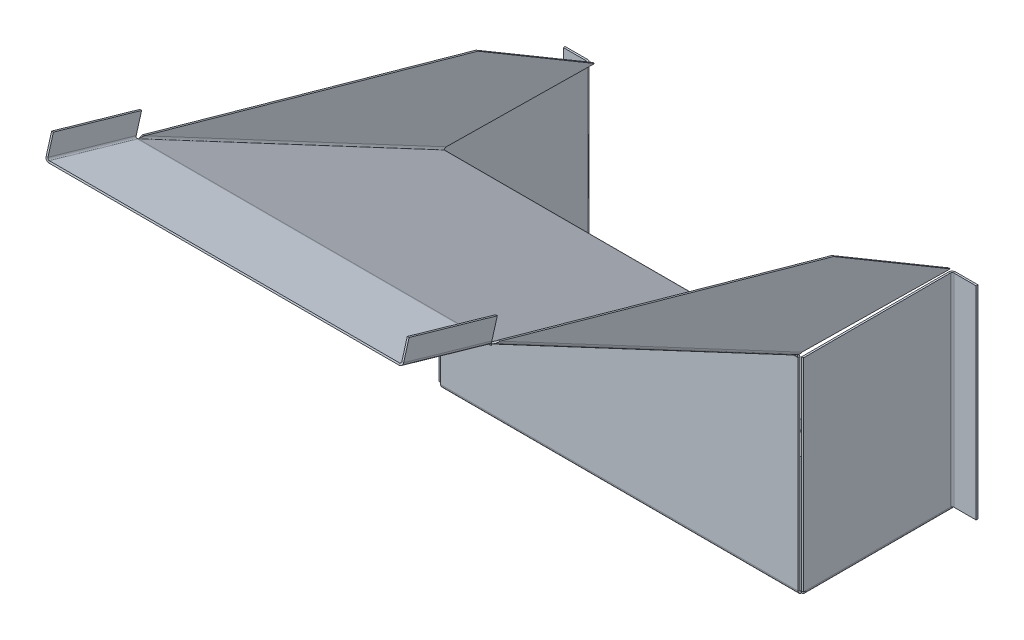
ISO-10303-21;
HEADER;
FILE_DESCRIPTION(('STEP AP214'),'2;1');
FILE_NAME('part.step','',(''),(''),'','','');
FILE_SCHEMA(('AUTOMOTIVE_DESIGN { 1 0 10303 214 1 1 1 1 }'));
ENDSEC;
DATA;
#1=APPLICATION_CONTEXT('core data for automotive mechanical design processes');
#2=APPLICATION_PROTOCOL_DEFINITION('international standard','automotive_design',2000,#1);
#3=PRODUCT_CONTEXT('',#1,'mechanical');
#4=PRODUCT('Part','Part','',(#3));
#5=PRODUCT_RELATED_PRODUCT_CATEGORY('part','',(#4));
#6=PRODUCT_DEFINITION_FORMATION('','',#4);
#7=PRODUCT_DEFINITION_CONTEXT('part definition',#1,'design');
#8=PRODUCT_DEFINITION('design','',#6,#7);
#9=PRODUCT_DEFINITION_SHAPE('','',#8);
#10=(LENGTH_UNIT() NAMED_UNIT(*) SI_UNIT(.MILLI.,.METRE.));
#11=(NAMED_UNIT(*) PLANE_ANGLE_UNIT() SI_UNIT($,.RADIAN.));
#12=(NAMED_UNIT(*) SI_UNIT($,.STERADIAN.) SOLID_ANGLE_UNIT());
#13=UNCERTAINTY_MEASURE_WITH_UNIT(LENGTH_MEASURE(1.E-05),#10,'distance_accuracy_value','');
#14=(GEOMETRIC_REPRESENTATION_CONTEXT(3) GLOBAL_UNCERTAINTY_ASSIGNED_CONTEXT((#13)) GLOBAL_UNIT_ASSIGNED_CONTEXT((#10,
#11,#12)) REPRESENTATION_CONTEXT('',''));
#15=CARTESIAN_POINT('',(0.,0.,0.));
#16=DIRECTION('',(0.,0.,1.));
#17=DIRECTION('',(1.,0.,0.));
#18=AXIS2_PLACEMENT_3D('',#15,#16,#17);
#19=CARTESIAN_POINT('',(5.99999999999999,3081.17794401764,5.99999999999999));
#20=DIRECTION('',(0.,-1.,0.));
#21=DIRECTION('',(0.,0.,-1.));
#22=AXIS2_PLACEMENT_3D('',#19,#20,#21);
#23=PLANE('',#22);
#24=CARTESIAN_POINT('',(5.99999999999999,3081.17794401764,5.99999999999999));
#25=DIRECTION('',(0.,1.,0.));
#26=DIRECTION('',(0.,0.,1.));
#27=AXIS2_PLACEMENT_3D('',#24,#25,#26);
#28=CIRCLE('',#27,3.);
#29=CARTESIAN_POINT('',(3.,3081.17794401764,5.99999999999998));
#30=VERTEX_POINT('',#29);
#31=CARTESIAN_POINT('',(5.99999999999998,3081.17794401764,2.99999999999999));
#32=VERTEX_POINT('',#31);
#33=EDGE_CURVE('E1053',#30,#32,#28,.F.);
#34=ORIENTED_EDGE('',*,*,#33,.F.);
#35=DIRECTION('',(0.,0.,-1.));
#36=VECTOR('',#35,1.);
#37=CARTESIAN_POINT('',(2.99999999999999,3081.17794401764,5.99999999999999));
#38=LINE('',#37,#36);
#39=CARTESIAN_POINT('',(3.,3081.17794401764,0.803847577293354));
#40=VERTEX_POINT('',#39);
#41=EDGE_CURVE('E492',#30,#40,#38,.T.);
#42=ORIENTED_EDGE('',*,*,#41,.T.);
#43=CARTESIAN_POINT('',(5.99999999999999,3081.17794401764,5.99999999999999));
#44=DIRECTION('',(0.,1.,0.));
#45=DIRECTION('',(0.,0.,1.));
#46=AXIS2_PLACEMENT_3D('',#43,#44,#45);
#47=CIRCLE('',#46,6.);
#48=CARTESIAN_POINT('',(5.99999999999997,3081.17794401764,0.));
#49=VERTEX_POINT('',#48);
#50=EDGE_CURVE('E1206',#40,#49,#47,.F.);
#51=ORIENTED_EDGE('',*,*,#50,.T.);
#52=DIRECTION('',(0.,0.,1.));
#53=VECTOR('',#52,1.);
#54=CARTESIAN_POINT('',(5.99999999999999,3081.17794401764,0.));
#55=LINE('',#54,#53);
#56=EDGE_CURVE('E432',#32,#49,#55,.F.);
#57=ORIENTED_EDGE('',*,*,#56,.F.);
#58=EDGE_LOOP('',(#34,#42,#51,#57));
#59=FACE_BOUND('',#58,.T.);
#60=ADVANCED_FACE('F26',(#59),#23,.T.);
#61=CARTESIAN_POINT('',(5.99999999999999,3418.17794401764,5.99999999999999));
#62=DIRECTION('',(0.,-1.,0.));
#63=DIRECTION('',(0.,0.,-1.));
#64=AXIS2_PLACEMENT_3D('',#61,#62,#63);
#65=PLANE('',#64);
#66=CARTESIAN_POINT('',(5.99999999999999,3418.17794401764,5.99999999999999));
#67=DIRECTION('',(0.,1.,0.));
#68=DIRECTION('',(0.,0.,1.));
#69=AXIS2_PLACEMENT_3D('',#66,#67,#68);
#70=CIRCLE('',#69,3.);
#71=CARTESIAN_POINT('',(5.99999999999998,3418.17794401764,2.99999999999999));
#72=VERTEX_POINT('',#71);
#73=CARTESIAN_POINT('',(3.,3418.17794401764,5.99999999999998));
#74=VERTEX_POINT('',#73);
#75=EDGE_CURVE('E1092',#72,#74,#70,.T.);
#76=ORIENTED_EDGE('',*,*,#75,.F.);
#77=DIRECTION('',(0.,0.,1.));
#78=VECTOR('',#77,1.);
#79=CARTESIAN_POINT('',(5.99999999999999,3418.17794401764,2.99999999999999));
#80=LINE('',#79,#78);
#81=CARTESIAN_POINT('',(5.99999999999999,3418.17794401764,0.));
#82=VERTEX_POINT('',#81);
#83=EDGE_CURVE('E485',#72,#82,#80,.F.);
#84=ORIENTED_EDGE('',*,*,#83,.T.);
#85=CARTESIAN_POINT('',(5.99999999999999,3418.17794401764,5.99999999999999));
#86=DIRECTION('',(0.,1.,0.));
#87=DIRECTION('',(0.,0.,1.));
#88=AXIS2_PLACEMENT_3D('',#85,#86,#87);
#89=CIRCLE('',#88,6.);
#90=CARTESIAN_POINT('',(0.,3418.17794401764,5.99999999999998));
#91=VERTEX_POINT('',#90);
#92=EDGE_CURVE('E1200',#82,#91,#89,.T.);
#93=ORIENTED_EDGE('',*,*,#92,.T.);
#94=DIRECTION('',(-1.,0.,0.));
#95=VECTOR('',#94,1.);
#96=CARTESIAN_POINT('',(2.99999999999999,3418.17794401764,5.99999999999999));
#97=LINE('',#96,#95);
#98=EDGE_CURVE('E11',#74,#91,#97,.T.);
#99=ORIENTED_EDGE('',*,*,#98,.F.);
#100=EDGE_LOOP('',(#76,#84,#93,#99));
#101=FACE_BOUND('',#100,.T.);
#102=ADVANCED_FACE('F28',(#101),#65,.F.);
#103=CARTESIAN_POINT('',(5.99999999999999,3418.17794401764,5.99999999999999));
#104=DIRECTION('',(0.,1.,0.));
#105=DIRECTION('',(0.,0.,-1.));
#106=AXIS2_PLACEMENT_3D('',#103,#104,#105);
#107=CYLINDRICAL_SURFACE('',#106,6.);
#108=DIRECTION('',(0.,1.,0.));
#109=VECTOR('',#108,1.);
#110=CARTESIAN_POINT('',(0.,3418.17794401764,5.99999999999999));
#111=LINE('',#110,#109);
#112=CARTESIAN_POINT('',(0.,3081.17794401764,5.99999999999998));
#113=VERTEX_POINT('',#112);
#114=EDGE_CURVE('E1198',#91,#113,#111,.F.);
#115=ORIENTED_EDGE('',*,*,#114,.F.);
#116=ORIENTED_EDGE('',*,*,#92,.F.);
#117=DIRECTION('',(0.,1.,0.));
#118=VECTOR('',#117,1.);
#119=CARTESIAN_POINT('',(5.99999999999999,3081.17794401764,0.));
#120=LINE('',#119,#118);
#121=EDGE_CURVE('E482',#82,#49,#120,.F.);
#122=ORIENTED_EDGE('',*,*,#121,.T.);
#123=ORIENTED_EDGE('',*,*,#50,.F.);
#124=EDGE_CURVE('E34',#113,#40,#47,.F.);
#125=ORIENTED_EDGE('',*,*,#124,.F.);
#126=EDGE_LOOP('',(#115,#116,#122,#123,#125));
#127=FACE_BOUND('',#126,.T.);
#128=ADVANCED_FACE('F1183',(#127),#107,.T.);
#129=CARTESIAN_POINT('',(5.99999999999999,3418.17794401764,5.99999999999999));
#130=DIRECTION('',(0.,1.,0.));
#131=DIRECTION('',(0.,0.,-1.));
#132=AXIS2_PLACEMENT_3D('',#129,#130,#131);
#133=CYLINDRICAL_SURFACE('',#132,3.);
#134=DIRECTION('',(0.,1.,0.));
#135=VECTOR('',#134,1.);
#136=CARTESIAN_POINT('',(2.99999999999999,3418.17794401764,5.99999999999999));
#137=LINE('',#136,#135);
#138=EDGE_CURVE('E1214',#74,#30,#137,.F.);
#139=ORIENTED_EDGE('',*,*,#138,.T.);
#140=ORIENTED_EDGE('',*,*,#33,.T.);
#141=DIRECTION('',(0.,1.,0.));
#142=VECTOR('',#141,1.);
#143=CARTESIAN_POINT('',(5.99999999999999,3081.17794401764,2.99999999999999));
#144=LINE('',#143,#142);
#145=EDGE_CURVE('E488',#32,#72,#144,.T.);
#146=ORIENTED_EDGE('',*,*,#145,.T.);
#147=ORIENTED_EDGE('',*,*,#75,.T.);
#148=EDGE_LOOP('',(#139,#140,#146,#147));
#149=FACE_BOUND('',#148,.T.);
#150=ADVANCED_FACE('F1065',(#149),#133,.F.);
#151=CARTESIAN_POINT('',(3.,3078.17794401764,250.));
#152=DIRECTION('',(-1.,0.,0.));
#153=DIRECTION('',(0.,0.,1.));
#154=AXIS2_PLACEMENT_3D('',#151,#152,#153);
#155=PLANE('',#154);
#156=ORIENTED_EDGE('',*,*,#138,.F.);
#157=DIRECTION('',(0.,0.,-1.));
#158=VECTOR('',#157,1.);
#159=CARTESIAN_POINT('',(3.,3418.17794401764,250.));
#160=LINE('',#159,#158);
#161=CARTESIAN_POINT('',(3.,3418.17794401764,250.));
#162=VERTEX_POINT('',#161);
#163=EDGE_CURVE('E793',#162,#74,#160,.T.);
#164=ORIENTED_EDGE('',*,*,#163,.F.);
#165=DIRECTION('',(0.,1.,0.));
#166=VECTOR('',#165,1.);
#167=CARTESIAN_POINT('',(3.,3078.17794401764,250.));
#168=LINE('',#167,#166);
#169=CARTESIAN_POINT('',(3.,3081.17794401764,250.));
#170=VERTEX_POINT('',#169);
#171=EDGE_CURVE('E743',#170,#162,#168,.T.);
#172=ORIENTED_EDGE('',*,*,#171,.F.);
#173=DIRECTION('',(0.,0.,-1.));
#174=VECTOR('',#173,1.);
#175=CARTESIAN_POINT('',(3.,3081.17794401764,250.));
#176=LINE('',#175,#174);
#177=CARTESIAN_POINT('',(3.,3081.17794401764,247.));
#178=VERTEX_POINT('',#177);
#179=EDGE_CURVE('E761',#170,#178,#176,.T.);
#180=ORIENTED_EDGE('',*,*,#179,.T.);
#181=EDGE_CURVE('E760',#178,#30,#176,.T.);
#182=ORIENTED_EDGE('',*,*,#181,.T.);
#183=EDGE_LOOP('',(#156,#164,#172,#180,#182));
#184=FACE_BOUND('',#183,.T.);
#185=ADVANCED_FACE('F1194',(#184),#155,.F.);
#186=CARTESIAN_POINT('',(0.,3418.17794401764,250.));
#187=DIRECTION('',(0.,1.,0.));
#188=DIRECTION('',(0.,0.,1.));
#189=AXIS2_PLACEMENT_3D('',#186,#187,#188);
#190=PLANE('',#189);
#191=ORIENTED_EDGE('',*,*,#163,.T.);
#192=ORIENTED_EDGE('',*,*,#98,.T.);
#193=DIRECTION('',(0.,0.,-1.));
#194=VECTOR('',#193,1.);
#195=CARTESIAN_POINT('',(0.,3418.17794401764,250.));
#196=LINE('',#195,#194);
#197=CARTESIAN_POINT('',(0.,3418.17794401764,250.));
#198=VERTEX_POINT('',#197);
#199=EDGE_CURVE('E790',#198,#91,#196,.T.);
#200=ORIENTED_EDGE('',*,*,#199,.F.);
#201=DIRECTION('',(1.,0.,0.));
#202=VECTOR('',#201,1.);
#203=CARTESIAN_POINT('',(0.,3418.17794401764,250.));
#204=LINE('',#203,#202);
#205=EDGE_CURVE('E745',#198,#162,#204,.T.);
#206=ORIENTED_EDGE('',*,*,#205,.T.);
#207=EDGE_LOOP('',(#191,#192,#200,#206));
#208=FACE_BOUND('',#207,.T.);
#209=ADVANCED_FACE('F1712',(#208),#190,.T.);
#210=CARTESIAN_POINT('',(0.,3078.17794401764,250.));
#211=DIRECTION('',(-1.,0.,0.));
#212=DIRECTION('',(0.,0.,1.));
#213=AXIS2_PLACEMENT_3D('',#210,#211,#212);
#214=PLANE('',#213);
#215=ORIENTED_EDGE('',*,*,#199,.T.);
#216=ORIENTED_EDGE('',*,*,#114,.T.);
#217=DIRECTION('',(0.,0.,-1.));
#218=VECTOR('',#217,1.);
#219=CARTESIAN_POINT('',(0.,3081.17794401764,250.));
#220=LINE('',#219,#218);
#221=CARTESIAN_POINT('',(0.,3081.17794401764,247.));
#222=VERTEX_POINT('',#221);
#223=EDGE_CURVE('E786',#222,#113,#220,.T.);
#224=ORIENTED_EDGE('',*,*,#223,.F.);
#225=CARTESIAN_POINT('',(0.,3081.17794401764,250.));
#226=VERTEX_POINT('',#225);
#227=EDGE_CURVE('E787',#226,#222,#220,.T.);
#228=ORIENTED_EDGE('',*,*,#227,.F.);
#229=DIRECTION('',(0.,1.,0.));
#230=VECTOR('',#229,1.);
#231=CARTESIAN_POINT('',(0.,3078.17794401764,250.));
#232=LINE('',#231,#230);
#233=EDGE_CURVE('E748',#226,#198,#232,.T.);
#234=ORIENTED_EDGE('',*,*,#233,.T.);
#235=EDGE_LOOP('',(#215,#216,#224,#228,#234));
#236=FACE_BOUND('',#235,.T.);
#237=ADVANCED_FACE('F1709',(#236),#214,.T.);
#238=CARTESIAN_POINT('',(-9.00000000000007,3689.24771355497,762.87199115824));
#239=CARTESIAN_POINT('',(-8.21062900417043,3688.7114719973,761.86346746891));
#240=CARTESIAN_POINT('',(-7.42166025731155,3688.31386692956,760.781380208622));
#241=CARTESIAN_POINT('',(-5.96317754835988,3687.77485553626,758.480831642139));
#242=CARTESIAN_POINT('',(-5.2942832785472,3687.63327058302,757.262540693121));
#243=CARTESIAN_POINT('',(-4.1780089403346,3687.54646169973,754.721551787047));
#244=CARTESIAN_POINT('',(-3.73106807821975,3687.60084997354,753.399060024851));
#245=CARTESIAN_POINT('',(-3.12694475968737,3687.81619314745,750.697414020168));
#246=CARTESIAN_POINT('',(-2.96999999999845,3687.97663213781,749.318609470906));
#247=CARTESIAN_POINT('',(-2.97000000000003,3688.13736380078,747.939498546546));
#248=CARTESIAN_POINT('',(-9.00000000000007,3689.27420198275,762.857907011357));
#249=CARTESIAN_POINT('',(-8.21455637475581,3688.73796063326,761.849383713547));
#250=CARTESIAN_POINT('',(-7.42951269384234,3688.33966593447,760.767662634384));
#251=CARTESIAN_POINT('',(-5.97828611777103,3687.79800076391,758.468525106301));
#252=CARTESIAN_POINT('',(-5.31271968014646,3687.65445250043,757.251278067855));
#253=CARTESIAN_POINT('',(-4.20199894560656,3687.56274007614,754.712896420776));
#254=CARTESIAN_POINT('',(-3.7572816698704,3687.61419004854,753.391966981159));
#255=CARTESIAN_POINT('',(-3.15616393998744,3687.82312643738,750.693727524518));
#256=CARTESIAN_POINT('',(-2.99999999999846,3687.98009959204,749.316765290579));
#257=CARTESIAN_POINT('',(-3.00000000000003,3688.13736380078,747.939498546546));
#258=CARTESIAN_POINT('',(-9.00000000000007,3691.92304476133,761.449492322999));
#259=CARTESIAN_POINT('',(-8.60729343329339,3691.38682422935,760.441008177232));
#260=CARTESIAN_POINT('',(-8.21475634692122,3690.91956642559,759.395905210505));
#261=CARTESIAN_POINT('',(-7.48914305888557,3690.11252352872,757.237871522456));
#262=CARTESIAN_POINT('',(-7.15635984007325,3689.77264424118,756.12501554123));
#263=CARTESIAN_POINT('',(-6.6009994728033,3689.19057771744,753.847359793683));
#264=CARTESIAN_POINT('',(-6.37864083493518,3688.94819754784,752.68266261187));
#265=CARTESIAN_POINT('',(-6.07808196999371,3688.51645543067,750.325077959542));
#266=CARTESIAN_POINT('',(-5.99999999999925,3688.32684501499,749.132347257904));
#267=CARTESIAN_POINT('',(-6.00000000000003,3688.13736380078,747.939498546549));
#268=CARTESIAN_POINT('',(-9.00000000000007,3691.94979807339,761.435267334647));
#269=CARTESIAN_POINT('',(-8.61126007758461,3691.41357775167,760.426783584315));
#270=CARTESIAN_POINT('',(-8.22268730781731,3690.94562342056,759.382050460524));
#271=CARTESIAN_POINT('',(-7.50440271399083,3690.13590020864,757.225441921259));
#272=CARTESIAN_POINT('',(-7.17498060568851,3689.79403797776,756.113640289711));
#273=CARTESIAN_POINT('',(-6.62522937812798,3689.20701887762,753.838617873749));
#274=CARTESIAN_POINT('',(-6.40511656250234,3688.96167102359,752.67549863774));
#275=CARTESIAN_POINT('',(-6.10759334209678,3688.52345805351,750.321354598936));
#276=CARTESIAN_POINT('',(-6.03029999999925,3688.33034714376,749.130484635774));
#277=CARTESIAN_POINT('',(-6.03030000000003,3688.13736380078,747.939498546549));
#278=B_SPLINE_SURFACE_WITH_KNOTS('',1,3,((#238,#239,#240,#241,#242,#243,#244,#245,#246,#247),
(#248,#249,#250,#251,#252,#253,#254,#255,#256,#257),(#258,#259,#260,#261,#262,#263,#264,#265,
#266,#267),(#268,#269,#270,#271,#272,#273,#274,#275,#276,#277)),.UNSPECIFIED.,.F.,.F.,.F.,(2,1,
1,2),(4,2,2,2,4),(-0.01,0.,1.,1.0101),(0.,0.25,0.5,0.75,1.),.UNSPECIFIED.);
#279=DIRECTION('',(-1.,0.,0.));
#280=VECTOR('',#279,1.);
#281=CARTESIAN_POINT('',(-3.00000000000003,3688.13736380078,747.939498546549));
#282=LINE('',#281,#280);
#283=CARTESIAN_POINT('',(-6.00000000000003,3688.13736380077,747.939498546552));
#284=VERTEX_POINT('',#283);
#285=CARTESIAN_POINT('',(-3.00000000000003,3688.13736380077,747.939498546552));
#286=VERTEX_POINT('',#285);
#287=EDGE_CURVE('E498',#284,#286,#282,.F.);
#288=CARTESIAN_POINT('',(-9.00000000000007,3691.92304476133,761.449492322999));
#289=CARTESIAN_POINT('',(-8.89071477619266,3691.77378849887,761.168838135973));
#290=CARTESIAN_POINT('',(-8.78142639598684,3691.62985152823,760.885358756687));
#291=CARTESIAN_POINT('',(-8.56414276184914,3691.35244902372,760.312826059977));
#292=CARTESIAN_POINT('',(-8.45614753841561,3691.2189837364,760.023772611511));
#293=CARTESIAN_POINT('',(-8.24275251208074,3690.96236156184,759.440174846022));
#294=CARTESIAN_POINT('',(-8.13735276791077,3690.83920490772,759.145630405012));
#295=CARTESIAN_POINT('',(-7.93060234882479,3690.60310421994,758.551783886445));
#296=CARTESIAN_POINT('',(-7.82924446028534,3690.49014149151,758.252491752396));
#297=CARTESIAN_POINT('',(-7.63157402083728,3690.27375372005,757.648859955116));
#298=CARTESIAN_POINT('',(-7.53526114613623,3690.17032806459,757.344520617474));
#299=CARTESIAN_POINT('',(-7.34882370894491,3689.97248126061,756.731096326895));
#300=CARTESIAN_POINT('',(-7.25869849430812,3689.87805916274,756.422011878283));
#301=CARTESIAN_POINT('',(-7.08239609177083,3689.6940845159,755.787470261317));
#302=CARTESIAN_POINT('',(-6.99650279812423,3689.60485751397,755.461839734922));
#303=CARTESIAN_POINT('',(-6.83364296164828,3689.43455837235,754.806259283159));
#304=CARTESIAN_POINT('',(-6.75667602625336,3689.35348587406,754.476309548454));
#305=CARTESIAN_POINT('',(-6.61265885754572,3689.19857210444,753.812638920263));
#306=CARTESIAN_POINT('',(-6.54560680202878,3689.12472950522,753.478918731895));
#307=CARTESIAN_POINT('',(-6.42226921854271,3688.98321235,752.80818789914));
#308=CARTESIAN_POINT('',(-6.36598378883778,3688.9155378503,752.471177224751));
#309=CARTESIAN_POINT('',(-6.28103566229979,3688.80604128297,751.902500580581));
#310=CARTESIAN_POINT('',(-6.24929093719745,3688.76286301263,751.671550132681));
#311=CARTESIAN_POINT('',(-6.19130812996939,3688.67847904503,751.208596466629));
#312=CARTESIAN_POINT('',(-6.16507006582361,3688.6372733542,750.976593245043));
#313=CARTESIAN_POINT('',(-6.11825661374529,3688.55645950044,750.511738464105));
#314=CARTESIAN_POINT('',(-6.0976812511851,3688.51685134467,750.278886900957));
#315=CARTESIAN_POINT('',(-6.06230010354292,3688.43880824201,749.812335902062));
#316=CARTESIAN_POINT('',(-6.04749945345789,3688.40037436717,749.578635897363));
#317=CARTESIAN_POINT('',(-6.02378514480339,3688.32431014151,749.110805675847));
#318=CARTESIAN_POINT('',(-6.01487151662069,3688.28667979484,748.876675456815));
#319=CARTESIAN_POINT('',(-6.00297580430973,3688.21182076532,748.408196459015));
#320=CARTESIAN_POINT('',(-5.99999381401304,3688.17459208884,748.173847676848));
#321=CARTESIAN_POINT('',(-6.00000000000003,3688.13736380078,747.939498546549));
#322=B_SPLINE_CURVE_WITH_KNOTS('',3,(#288,#289,#290,#291,#292,#293,#294,#295,#296,#297,#298,
#299,#300,#301,#302,#303,#304,#305,#306,#307,#308,#309,#310,#311,#312,#313,#314,#315,#316,#317,
#318,#319,#320,#321),.UNSPECIFIED.,.F.,.F.,(4,2,2,2,2,2,2,2,2,2,2,2,2,2,2,2,4),(0.,
1.00835252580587,2.01672878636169,3.02512784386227,4.03163831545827,5.03808410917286,
6.04442366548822,7.08935062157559,8.13423160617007,9.1789203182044,10.2236185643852,
10.9348111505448,11.6460060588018,12.3572041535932,13.0690332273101,13.7808659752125,
14.4927099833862),.UNSPECIFIED.);
#323=CARTESIAN_POINT('',(-9.00000000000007,3691.92304476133,761.449492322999));
#324=VERTEX_POINT('',#323);
#325=EDGE_CURVE('E1039',#324,#284,#322,.T.);
#326=DIRECTION('',(0.,-0.882947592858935,0.469471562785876));
#327=VECTOR('',#326,1.);
#328=CARTESIAN_POINT('',(-9.00000000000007,3691.92304476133,761.449492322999));
#329=LINE('',#328,#327);
#330=CARTESIAN_POINT('',(-9.00000000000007,3689.27420198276,762.857907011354));
#331=VERTEX_POINT('',#330);
#332=EDGE_CURVE('E1089',#324,#331,#329,.T.);
#333=CARTESIAN_POINT('',(-9.00000000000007,3689.27420198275,762.857907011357));
#334=CARTESIAN_POINT('',(-8.80576934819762,3689.14156052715,762.608513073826));
#335=CARTESIAN_POINT('',(-8.61153765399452,3689.01730401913,762.354665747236));
#336=CARTESIAN_POINT('',(-8.22491848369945,3688.78537250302,761.838199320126));
#337=CARTESIAN_POINT('',(-8.03253078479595,3688.67769546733,761.575581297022));
#338=CARTESIAN_POINT('',(-7.65140527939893,3688.47870620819,761.0416583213));
#339=CARTESIAN_POINT('',(-7.46266732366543,3688.38739331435,760.77035372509));
#340=CARTESIAN_POINT('',(-7.09114694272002,3688.22095471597,760.220028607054));
#341=CARTESIAN_POINT('',(-6.90834925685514,3688.14578419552,759.941031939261));
#342=CARTESIAN_POINT('',(-6.54986213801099,3688.01078243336,759.374894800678));
#343=CARTESIAN_POINT('',(-6.37417244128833,3687.95095062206,759.087754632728));
#344=CARTESIAN_POINT('',(-6.03153796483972,3687.84595318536,758.505693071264));
#345=CARTESIAN_POINT('',(-5.86459292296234,3687.80078712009,758.210771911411));
#346=CARTESIAN_POINT('',(-5.54071094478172,3687.724228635,757.613012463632));
#347=CARTESIAN_POINT('',(-5.38379326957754,3687.69286208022,757.310160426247));
#348=CARTESIAN_POINT('',(-5.08178541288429,3687.64305961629,756.697554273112));
#349=CARTESIAN_POINT('',(-4.93669585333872,3687.62462438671,756.387799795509));
#350=CARTESIAN_POINT('',(-4.65969812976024,3687.59962565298,755.761962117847));
#351=CARTESIAN_POINT('',(-4.52779068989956,3687.59306280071,755.44587857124));
#352=CARTESIAN_POINT('',(-4.27850118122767,3687.59063556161,754.808279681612));
#353=CARTESIAN_POINT('',(-4.16110778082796,3687.59476277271,754.48676880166));
#354=CARTESIAN_POINT('',(-3.94183965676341,3687.61241283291,753.838777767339));
#355=CARTESIAN_POINT('',(-3.83996395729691,3687.62593509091,753.512297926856));
#356=CARTESIAN_POINT('',(-3.65270567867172,3687.66098145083,752.855132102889));
#357=CARTESIAN_POINT('',(-3.5673194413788,3687.68250377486,752.524447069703));
#358=CARTESIAN_POINT('',(-3.4368304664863,3687.72468164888,751.959320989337));
#359=CARTESIAN_POINT('',(-3.38732647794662,3687.74366128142,751.725759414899));
#360=CARTESIAN_POINT('',(-3.29700686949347,3687.78432245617,751.257228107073));
#361=CARTESIAN_POINT('',(-3.25618989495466,3687.80600357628,751.022258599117));
#362=CARTESIAN_POINT('',(-3.18342562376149,3687.85155242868,750.551180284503));
#363=CARTESIAN_POINT('',(-3.15147768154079,3687.87542000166,750.31507156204));
#364=CARTESIAN_POINT('',(-3.09657063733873,3687.92482256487,749.841762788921));
#365=CARTESIAN_POINT('',(-3.07361980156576,3687.95035906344,749.604561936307));
#366=CARTESIAN_POINT('',(-3.03685569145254,3688.00252940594,749.129552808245));
#367=CARTESIAN_POINT('',(-3.02304320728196,3688.02916334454,748.891744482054));
#368=CARTESIAN_POINT('',(-3.00461082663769,3688.08298549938,748.415790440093));
#369=CARTESIAN_POINT('',(-2.99999261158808,3688.11017381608,748.17764467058));
#370=CARTESIAN_POINT('',(-3.00000000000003,3688.13736380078,747.939498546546));
#371=B_SPLINE_CURVE_WITH_KNOTS('',3,(#333,#334,#335,#336,#337,#338,#339,#340,#341,#342,#343,
#344,#345,#346,#347,#348,#349,#350,#351,#352,#353,#354,#355,#356,#357,#358,#359,#360,#361,#362,
#363,#364,#365,#366,#367,#368,#369,#370),.UNSPECIFIED.,.F.,.F.,(4,2,2,2,2,2,2,2,2,2,2,2,2,2,2,2,
2,2,4),(0.,1.02828616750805,2.0564464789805,3.08456465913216,4.10979048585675,5.13497823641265,
6.16013523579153,7.18720562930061,8.21432999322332,9.24151075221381,10.2678844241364,
11.2941935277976,12.3202746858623,13.0386217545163,13.7568567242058,14.4750394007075,
15.1938803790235,15.9127835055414,16.6318180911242),.UNSPECIFIED.);
#372=EDGE_CURVE('E1080',#331,#286,#371,.T.);
#373=ORIENTED_EDGE('',*,*,#287,.F.);
#374=ORIENTED_EDGE('',*,*,#325,.F.);
#375=ORIENTED_EDGE('',*,*,#332,.T.);
#376=ORIENTED_EDGE('',*,*,#372,.T.);
#377=EDGE_LOOP('',(#373,#374,#375,#376));
#378=FACE_BOUND('',#377,.T.);
#379=ADVANCED_FACE('F1060',(#378),#278,.F.);
#380=CARTESIAN_POINT('',(-2.97000000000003,3421.58248245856,246.622678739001));
#381=CARTESIAN_POINT('',(-2.97000000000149,3421.11377256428,247.422688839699));
#382=CARTESIAN_POINT('',(-3.12694475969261,3420.64545918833,248.22234389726));
#383=CARTESIAN_POINT('',(-3.73106807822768,3419.81426339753,249.765739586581));
#384=CARTESIAN_POINT('',(-4.178008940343,3419.45194881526,250.509106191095));
#385=CARTESIAN_POINT('',(-5.29428327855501,3418.92290508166,251.891844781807));
#386=CARTESIAN_POINT('',(-5.96317754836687,3418.75656372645,252.531010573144));
#387=CARTESIAN_POINT('',(-7.42166025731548,3418.67972250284,253.673308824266));
#388=CARTESIAN_POINT('',(-8.21057173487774,3418.76940261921,254.176273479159));
#389=CARTESIAN_POINT('',(-9.00000000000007,3418.99771651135,254.605669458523));
#390=CARTESIAN_POINT('',(-3.00000000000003,3421.58248245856,246.622678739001));
#391=CARTESIAN_POINT('',(-3.00000000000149,3421.11724041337,247.420844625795));
#392=CARTESIAN_POINT('',(-3.15616393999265,3420.65239247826,248.218657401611));
#393=CARTESIAN_POINT('',(-3.75728166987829,3419.82760347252,249.758646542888));
#394=CARTESIAN_POINT('',(-4.20199894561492,3419.46822719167,250.500450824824));
#395=CARTESIAN_POINT('',(-5.31271968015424,3418.94408699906,251.880582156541));
#396=CARTESIAN_POINT('',(-5.97828611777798,3418.77970895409,252.518704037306));
#397=CARTESIAN_POINT('',(-7.42951269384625,3418.70552150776,253.659591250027));
#398=CARTESIAN_POINT('',(-8.21449946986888,3418.79589118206,254.162189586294));
#399=CARTESIAN_POINT('',(-9.00000000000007,3419.02420493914,254.591585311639));
#400=CARTESIAN_POINT('',(-6.00000000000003,3421.58248245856,246.622678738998));
#401=CARTESIAN_POINT('',(-6.00000000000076,3421.46402532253,247.236423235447));
#402=CARTESIAN_POINT('',(-6.07808196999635,3421.34572147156,247.85000783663));
#403=CARTESIAN_POINT('',(-6.37864083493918,3421.16161097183,249.049342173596));
#404=CARTESIAN_POINT('',(-6.60099947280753,3421.09606483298,249.634914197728));
#405=CARTESIAN_POINT('',(-7.15635984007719,3421.06227873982,250.754319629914));
#406=CARTESIAN_POINT('',(-7.48914305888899,3421.09423171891,251.28805045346));
#407=CARTESIAN_POINT('',(-8.21475634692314,3421.28542199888,252.287833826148));
#408=CARTESIAN_POINT('',(-8.60727296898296,3421.44474746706,252.753800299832));
#409=CARTESIAN_POINT('',(-9.00000000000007,3421.67304771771,253.183170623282));
#410=CARTESIAN_POINT('',(-6.03030000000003,3421.58248245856,246.622678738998));
#411=CARTESIAN_POINT('',(-6.03030000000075,3421.46752785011,247.234560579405));
#412=CARTESIAN_POINT('',(-6.10759334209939,3421.35272409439,247.846284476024));
#413=CARTESIAN_POINT('',(-6.4051165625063,3421.17508444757,249.042178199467));
#414=CARTESIAN_POINT('',(-6.62522937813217,3421.11250599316,249.626172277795));
#415=CARTESIAN_POINT('',(-7.17498060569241,3421.0836724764,250.742944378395));
#416=CARTESIAN_POINT('',(-7.50440271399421,3421.11760839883,251.275620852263));
#417=CARTESIAN_POINT('',(-8.22268730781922,3421.31147899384,252.273979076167));
#418=CARTESIAN_POINT('',(-8.61123998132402,3421.47150091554,252.739575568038));
#419=CARTESIAN_POINT('',(-9.00000000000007,3421.69980102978,253.168945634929));
#420=B_SPLINE_SURFACE_WITH_KNOTS('',1,3,((#380,#381,#382,#383,#384,#385,#386,#387,#388,#389),
(#390,#391,#392,#393,#394,#395,#396,#397,#398,#399),(#400,#401,#402,#403,#404,#405,#406,#407,
#408,#409),(#410,#411,#412,#413,#414,#415,#416,#417,#418,#419)),.UNSPECIFIED.,.F.,.F.,.F.,(2,1,
1,2),(4,2,2,2,4),(-0.01,0.,1.,1.0101),(0.,0.25,0.5,0.75,1.),.UNSPECIFIED.);
#421=CARTESIAN_POINT('',(-6.00000000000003,3421.58248245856,246.622678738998));
#422=CARTESIAN_POINT('',(-5.99998840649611,3421.55539915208,246.763018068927));
#423=CARTESIAN_POINT('',(-6.00403141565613,3421.52831549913,246.90335618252));
#424=CARTESIAN_POINT('',(-6.02014291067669,3421.47478613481,247.183675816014));
#425=CARTESIAN_POINT('',(-6.03221044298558,3421.44834034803,247.323657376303));
#426=CARTESIAN_POINT('',(-6.06428662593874,3421.39671968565,247.60293744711));
#427=CARTESIAN_POINT('',(-6.08429494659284,3421.3715447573,247.742235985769));
#428=CARTESIAN_POINT('',(-6.13200387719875,3421.32318005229,248.019352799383));
#429=CARTESIAN_POINT('',(-6.15967800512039,3421.29998379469,248.157174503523));
#430=CARTESIAN_POINT('',(-6.22252700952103,3421.25607531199,248.431492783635));
#431=CARTESIAN_POINT('',(-6.25770166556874,3421.23536301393,248.567989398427));
#432=CARTESIAN_POINT('',(-6.33526971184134,3421.19700456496,248.839349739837));
#433=CARTESIAN_POINT('',(-6.3776629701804,3421.17935835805,248.974213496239));
#434=CARTESIAN_POINT('',(-6.46957041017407,3421.14760160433,249.242707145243));
#435=CARTESIAN_POINT('',(-6.51912036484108,3421.13350985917,249.376327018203));
#436=CARTESIAN_POINT('',(-6.62477168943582,3421.10952846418,249.64134174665));
#437=CARTESIAN_POINT('',(-6.6808733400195,3421.09963899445,249.772736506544));
#438=CARTESIAN_POINT('',(-6.79917546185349,3421.08456161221,250.033030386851));
#439=CARTESIAN_POINT('',(-6.86137608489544,3421.07937381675,250.161929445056));
#440=CARTESIAN_POINT('',(-6.99135862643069,3421.0741649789,250.416955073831));
#441=CARTESIAN_POINT('',(-7.05913938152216,3421.07414286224,250.543082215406));
#442=CARTESIAN_POINT('',(-7.19974855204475,3421.07967957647,250.792360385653));
#443=CARTESIAN_POINT('',(-7.27257682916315,3421.0852382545,250.915511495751));
#444=CARTESIAN_POINT('',(-7.42268427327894,3421.10231940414,251.158633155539));
#445=CARTESIAN_POINT('',(-7.49996303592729,3421.11384133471,251.278603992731));
#446=CARTESIAN_POINT('',(-7.65148065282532,3421.14190807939,251.504945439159));
#447=CARTESIAN_POINT('',(-7.72540245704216,3421.15793099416,251.611593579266));
#448=CARTESIAN_POINT('',(-7.87594149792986,3421.19543573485,251.821981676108));
#449=CARTESIAN_POINT('',(-7.95255860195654,3421.21691729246,251.925721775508));
#450=CARTESIAN_POINT('',(-8.10797313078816,3421.26551720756,252.130202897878));
#451=CARTESIAN_POINT('',(-8.18677053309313,3421.29263550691,252.230943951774));
#452=CARTESIAN_POINT('',(-8.34623559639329,3421.35272721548,252.429622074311));
#453=CARTESIAN_POINT('',(-8.42690775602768,3421.38571632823,252.527550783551));
#454=CARTESIAN_POINT('',(-8.5893662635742,3421.45760885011,252.720272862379));
#455=CARTESIAN_POINT('',(-8.67115267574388,3421.49651260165,252.815066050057));
#456=CARTESIAN_POINT('',(-8.83529249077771,3421.58029008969,253.001496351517));
#457=CARTESIAN_POINT('',(-8.91764597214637,3421.62516466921,253.093133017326));
#458=CARTESIAN_POINT('',(-9.00000000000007,3421.67304771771,253.183170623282));
#459=B_SPLINE_CURVE_WITH_KNOTS('',3,(#421,#422,#423,#424,#425,#426,#427,#428,#429,#430,#431,
#432,#433,#434,#435,#436,#437,#438,#439,#440,#441,#442,#443,#444,#445,#446,#447,#448,#449,#450,
#451,#452,#453,#454,#455,#456,#457,#458),.UNSPECIFIED.,.F.,.F.,(4,2,2,2,2,2,2,2,2,2,2,2,2,2,2,2,
2,2,4),(0.,0.428727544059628,0.857404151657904,1.28606294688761,1.71325899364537,
2.14044248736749,2.56761817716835,2.99700818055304,3.42641658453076,3.85583567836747,
4.28516546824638,4.71448349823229,5.14376258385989,5.53583502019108,5.92788818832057,
6.31993731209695,6.71305131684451,7.10618808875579,7.49938042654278),.UNSPECIFIED.);
#460=CARTESIAN_POINT('',(-6.00000000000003,3421.58248245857,246.622678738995));
#461=VERTEX_POINT('',#460);
#462=CARTESIAN_POINT('',(-9.00000000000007,3421.67304771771,253.183170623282));
#463=VERTEX_POINT('',#462);
#464=EDGE_CURVE('E1045',#461,#463,#459,.T.);
#465=DIRECTION('',(-1.,0.,0.));
#466=VECTOR('',#465,1.);
#467=CARTESIAN_POINT('',(-6.0000000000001,3421.58248245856,246.622678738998));
#468=LINE('',#467,#466);
#469=CARTESIAN_POINT('',(-3.0000000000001,3421.58248245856,246.622678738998));
#470=VERTEX_POINT('',#469);
#471=EDGE_CURVE('E522',#461,#470,#468,.F.);
#472=CARTESIAN_POINT('',(-3.00000000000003,3421.58248245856,246.622678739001));
#473=CARTESIAN_POINT('',(-2.99996510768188,3421.46489804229,246.824417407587));
#474=CARTESIAN_POINT('',(-3.00985215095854,3421.34731398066,247.026150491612));
#475=CARTESIAN_POINT('',(-3.0492196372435,3421.11387159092,247.428684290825));
#476=CARTESIAN_POINT('',(-3.07869878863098,3420.99801314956,247.629485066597));
#477=CARTESIAN_POINT('',(-3.15697627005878,3420.76980048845,248.029138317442));
#478=CARTESIAN_POINT('',(-3.20576283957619,3420.65744418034,248.227991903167));
#479=CARTESIAN_POINT('',(-3.32216197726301,3420.43784182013,248.622987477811));
#480=CARTESIAN_POINT('',(-3.38977424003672,3420.33059568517,248.819129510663));
#481=CARTESIAN_POINT('',(-3.54327779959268,3420.12267235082,249.208128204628));
#482=CARTESIAN_POINT('',(-3.62919609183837,3420.02200514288,249.400979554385));
#483=CARTESIAN_POINT('',(-3.81840713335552,3419.82896790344,249.782261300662));
#484=CARTESIAN_POINT('',(-3.92169991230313,3419.7365978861,249.97069168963));
#485=CARTESIAN_POINT('',(-4.1445825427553,3419.56168952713,250.342256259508));
#486=CARTESIAN_POINT('',(-4.26416413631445,3419.4791462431,250.525393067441));
#487=CARTESIAN_POINT('',(-4.5184823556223,3419.32522346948,250.885736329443));
#488=CARTESIAN_POINT('',(-4.65321882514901,3419.25384386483,251.062942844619));
#489=CARTESIAN_POINT('',(-4.93652629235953,3419.12351203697,251.410752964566));
#490=CARTESIAN_POINT('',(-5.085097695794,3419.06456017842,251.581356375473));
#491=CARTESIAN_POINT('',(-5.39461572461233,3418.96022782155,251.915339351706));
#492=CARTESIAN_POINT('',(-5.55556254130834,3418.91484753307,252.078718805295));
#493=CARTESIAN_POINT('',(-5.88831333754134,3418.83866763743,252.397790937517));
#494=CARTESIAN_POINT('',(-6.06012222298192,3418.80787467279,252.553480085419));
#495=CARTESIAN_POINT('',(-6.41283465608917,3418.76177507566,252.856629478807));
#496=CARTESIAN_POINT('',(-6.59373803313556,3418.74646815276,253.004089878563));
#497=CARTESIAN_POINT('',(-6.95445397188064,3418.7323836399,253.283878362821));
#498=CARTESIAN_POINT('',(-7.13394178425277,3418.73288578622,253.416589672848));
#499=CARTESIAN_POINT('',(-7.49797019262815,3418.74913284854,253.673896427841));
#500=CARTESIAN_POINT('',(-7.68251065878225,3418.76487737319,253.798492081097));
#501=CARTESIAN_POINT('',(-8.05501662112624,3418.81198175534,254.039406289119));
#502=CARTESIAN_POINT('',(-8.24298272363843,3418.84334440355,254.155723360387));
#503=CARTESIAN_POINT('',(-8.62063150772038,3418.92187408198,254.379971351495));
#504=CARTESIAN_POINT('',(-8.8103143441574,3418.96904255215,254.487901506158));
#505=CARTESIAN_POINT('',(-9.00000000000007,3419.02420493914,254.591585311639));
#506=B_SPLINE_CURVE_WITH_KNOTS('',3,(#472,#473,#474,#475,#476,#477,#478,#479,#480,#481,#482,
#483,#484,#485,#486,#487,#488,#489,#490,#491,#492,#493,#494,#495,#496,#497,#498,#499,#500,#501,
#502,#503,#504,#505),.UNSPECIFIED.,.F.,.F.,(4,2,2,2,2,2,2,2,2,2,2,2,2,2,2,2,4),(0.,
0.700298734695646,1.40055130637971,2.10037799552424,2.80019333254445,3.50104790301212,
4.20190367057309,4.90240543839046,5.60289998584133,6.3034150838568,7.00394101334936,
7.70478563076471,8.40561710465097,9.07456684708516,9.7434994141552,10.4125515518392,
11.0816646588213),.UNSPECIFIED.);
#507=CARTESIAN_POINT('',(-9.00000000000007,3419.02420493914,254.591585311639));
#508=VERTEX_POINT('',#507);
#509=EDGE_CURVE('E1073',#470,#508,#506,.T.);
#510=DIRECTION('',(0.,-0.882947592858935,0.469471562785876));
#511=VECTOR('',#510,1.);
#512=CARTESIAN_POINT('',(-9.00000000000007,3421.67304771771,253.183170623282));
#513=LINE('',#512,#511);
#514=EDGE_CURVE('E1086',#463,#508,#513,.T.);
#515=ORIENTED_EDGE('',*,*,#464,.F.);
#516=ORIENTED_EDGE('',*,*,#471,.T.);
#517=ORIENTED_EDGE('',*,*,#509,.T.);
#518=ORIENTED_EDGE('',*,*,#514,.F.);
#519=EDGE_LOOP('',(#515,#516,#517,#518));
#520=FACE_BOUND('',#519,.T.);
#521=ADVANCED_FACE('F1034',(#520),#420,.F.);
#522=CARTESIAN_POINT('',(-9.00000000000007,3421.58248245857,246.622678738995));
#523=DIRECTION('',(0.,-0.469471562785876,-0.882947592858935));
#524=DIRECTION('',(1.,0.,0.));
#525=AXIS2_PLACEMENT_3D('',#522,#523,#524);
#526=CYLINDRICAL_SURFACE('',#525,6.00000000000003);
#527=DIRECTION('',(0.,-0.469471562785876,-0.882947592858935));
#528=VECTOR('',#527,1.);
#529=CARTESIAN_POINT('',(-9.00000000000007,3416.28479690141,249.439508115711));
#530=LINE('',#529,#528);
#531=EDGE_CURVE('E1079',#508,#331,#530,.F.);
#532=ORIENTED_EDGE('',*,*,#531,.F.);
#533=ORIENTED_EDGE('',*,*,#509,.F.);
#534=DIRECTION('',(0.,-0.469471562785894,-0.882947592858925));
#535=VECTOR('',#534,1.);
#536=CARTESIAN_POINT('',(-3.00000000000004,3688.13736380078,747.939498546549));
#537=LINE('',#536,#535);
#538=EDGE_CURVE('E520',#470,#286,#537,.F.);
#539=ORIENTED_EDGE('',*,*,#538,.T.);
#540=ORIENTED_EDGE('',*,*,#372,.F.);
#541=EDGE_LOOP('',(#532,#533,#539,#540));
#542=FACE_BOUND('',#541,.T.);
#543=ADVANCED_FACE('F1032',(#542),#526,.T.);
#544=CARTESIAN_POINT('',(-9.00000000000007,3421.58248245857,246.622678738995));
#545=DIRECTION('',(0.,-0.469471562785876,-0.882947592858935));
#546=DIRECTION('',(1.,0.,0.));
#547=AXIS2_PLACEMENT_3D('',#544,#545,#546);
#548=CYLINDRICAL_SURFACE('',#547,3.00000000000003);
#549=DIRECTION('',(0.,-0.469471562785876,-0.882947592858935));
#550=VECTOR('',#549,1.);
#551=CARTESIAN_POINT('',(-9.00000000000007,3418.93363967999,248.031093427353));
#552=LINE('',#551,#550);
#553=EDGE_CURVE('E1052',#463,#324,#552,.F.);
#554=ORIENTED_EDGE('',*,*,#553,.T.);
#555=ORIENTED_EDGE('',*,*,#325,.T.);
#556=DIRECTION('',(0.,-0.469471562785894,-0.882947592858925));
#557=VECTOR('',#556,1.);
#558=CARTESIAN_POINT('',(-6.00000000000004,3688.13736380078,747.939498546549));
#559=LINE('',#558,#557);
#560=EDGE_CURVE('E525',#284,#461,#559,.T.);
#561=ORIENTED_EDGE('',*,*,#560,.T.);
#562=ORIENTED_EDGE('',*,*,#464,.T.);
#563=EDGE_LOOP('',(#554,#555,#561,#562));
#564=FACE_BOUND('',#563,.T.);
#565=ADVANCED_FACE('F1027',(#564),#548,.F.);
#566=CARTESIAN_POINT('',(-3.00000000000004,3420.82678679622,251.591585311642));
#567=DIRECTION('',(0.,0.882947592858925,-0.469471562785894));
#568=DIRECTION('',(0.,0.469471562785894,0.882947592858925));
#569=AXIS2_PLACEMENT_3D('',#566,#567,#568);
#570=PLANE('',#569);
#571=DIRECTION('',(-1.,0.,0.));
#572=VECTOR('',#571,1.);
#573=CARTESIAN_POINT('',(-597.,3691.92304476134,761.449492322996));
#574=LINE('',#573,#572);
#575=CARTESIAN_POINT('',(-591.,3691.92304476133,761.449492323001));
#576=VERTEX_POINT('',#575);
#577=EDGE_CURVE('E888',#576,#324,#574,.F.);
#578=ORIENTED_EDGE('',*,*,#577,.T.);
#579=ORIENTED_EDGE('',*,*,#553,.F.);
#580=DIRECTION('',(-1.,0.,0.));
#581=VECTOR('',#580,1.);
#582=CARTESIAN_POINT('',(-3.00000000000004,3421.67304771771,253.183170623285));
#583=LINE('',#582,#581);
#584=CARTESIAN_POINT('',(-591.,3421.67304771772,253.18317062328));
#585=VERTEX_POINT('',#584);
#586=EDGE_CURVE('E700',#463,#585,#583,.T.);
#587=ORIENTED_EDGE('',*,*,#586,.T.);
#588=DIRECTION('',(0.,0.469471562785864,0.882947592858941));
#589=VECTOR('',#588,1.);
#590=CARTESIAN_POINT('',(-591.,3691.92304476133,761.449492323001));
#591=LINE('',#590,#589);
#592=EDGE_CURVE('E919',#576,#585,#591,.F.);
#593=ORIENTED_EDGE('',*,*,#592,.F.);
#594=EDGE_LOOP('',(#578,#579,#587,#593));
#595=FACE_BOUND('',#594,.T.);
#596=ADVANCED_FACE('F1031',(#595),#570,.T.);
#597=CARTESIAN_POINT('',(-3.00000000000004,3418.17794401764,253.));
#598=DIRECTION('',(0.,0.882947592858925,-0.469471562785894));
#599=DIRECTION('',(0.,0.469471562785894,0.882947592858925));
#600=AXIS2_PLACEMENT_3D('',#597,#598,#599);
#601=PLANE('',#600);
#602=ORIENTED_EDGE('',*,*,#531,.T.);
#603=DIRECTION('',(-1.,0.,0.));
#604=VECTOR('',#603,1.);
#605=CARTESIAN_POINT('',(-597.,3689.27420198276,762.857907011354));
#606=LINE('',#605,#604);
#607=CARTESIAN_POINT('',(-591.,3689.27420198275,762.857907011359));
#608=VERTEX_POINT('',#607);
#609=EDGE_CURVE('E881',#608,#331,#606,.F.);
#610=ORIENTED_EDGE('',*,*,#609,.F.);
#611=DIRECTION('',(0.,0.469471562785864,0.882947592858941));
#612=VECTOR('',#611,1.);
#613=CARTESIAN_POINT('',(-591.,3689.27420198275,762.857907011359));
#614=LINE('',#613,#612);
#615=CARTESIAN_POINT('',(-591.,3419.02420493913,254.591585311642));
#616=VERTEX_POINT('',#615);
#617=EDGE_CURVE('E924',#608,#616,#614,.F.);
#618=ORIENTED_EDGE('',*,*,#617,.T.);
#619=DIRECTION('',(-1.,0.,0.));
#620=VECTOR('',#619,1.);
#621=CARTESIAN_POINT('',(-3.00000000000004,3419.02420493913,254.591585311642));
#622=LINE('',#621,#620);
#623=EDGE_CURVE('E696',#508,#616,#622,.T.);
#624=ORIENTED_EDGE('',*,*,#623,.F.);
#625=EDGE_LOOP('',(#602,#610,#618,#624));
#626=FACE_BOUND('',#625,.T.);
#627=ADVANCED_FACE('F1025',(#626),#601,.F.);
#628=CARTESIAN_POINT('',(-9.00000000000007,3695.27671446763,761.785585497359));
#629=DIRECTION('',(0.,0.275637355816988,0.961261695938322));
#630=DIRECTION('',(0.,-0.961261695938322,0.275637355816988));
#631=AXIS2_PLACEMENT_3D('',#628,#629,#630);
#632=PLANE('',#631);
#633=CARTESIAN_POINT('',(-9.00000000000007,3695.27671446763,761.785585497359));
#634=DIRECTION('',(0.,-0.275637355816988,-0.961261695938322));
#635=DIRECTION('',(0.,0.961261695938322,-0.275637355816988));
#636=AXIS2_PLACEMENT_3D('',#633,#634,#635);
#637=CIRCLE('',#636,6.00000000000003);
#638=CARTESIAN_POINT('',(-3.0000000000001,3695.27671446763,761.785585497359));
#639=VERTEX_POINT('',#638);
#640=CARTESIAN_POINT('',(-3.80384757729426,3692.39292937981,762.61249756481));
#641=VERTEX_POINT('',#640);
#642=EDGE_CURVE('E1100',#639,#641,#637,.T.);
#643=ORIENTED_EDGE('',*,*,#642,.T.);
#644=DIRECTION('',(-1.,2.96059473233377E-13,0.));
#645=VECTOR('',#644,1.);
#646=CARTESIAN_POINT('',(-3.00000000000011,3692.39292937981,762.61249756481));
#647=LINE('',#646,#645);
#648=CARTESIAN_POINT('',(-9.00000000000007,3692.39292937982,762.61249756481));
#649=VERTEX_POINT('',#648);
#650=EDGE_CURVE('E567',#641,#649,#647,.T.);
#651=ORIENTED_EDGE('',*,*,#650,.T.);
#652=CARTESIAN_POINT('',(-9.00000000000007,3695.27671446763,761.785585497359));
#653=DIRECTION('',(0.,-0.275637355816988,-0.961261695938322));
#654=DIRECTION('',(0.,0.961261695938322,-0.275637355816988));
#655=AXIS2_PLACEMENT_3D('',#652,#653,#654);
#656=CIRCLE('',#655,3.00000000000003);
#657=CARTESIAN_POINT('',(-6.00000000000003,3695.27671446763,761.785585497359));
#658=VERTEX_POINT('',#657);
#659=EDGE_CURVE('E1108',#658,#649,#656,.T.);
#660=ORIENTED_EDGE('',*,*,#659,.F.);
#661=DIRECTION('',(-1.,0.,0.));
#662=VECTOR('',#661,1.);
#663=CARTESIAN_POINT('',(-6.00000000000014,3695.27671446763,761.785585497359));
#664=LINE('',#663,#662);
#665=EDGE_CURVE('E557',#658,#639,#664,.F.);
#666=ORIENTED_EDGE('',*,*,#665,.T.);
#667=EDGE_LOOP('',(#643,#651,#660,#666));
#668=FACE_BOUND('',#667,.T.);
#669=ADVANCED_FACE('F1021',(#668),#632,.F.);
#670=CARTESIAN_POINT('',(-9.00000000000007,3737.31428379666,908.388011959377));
#671=DIRECTION('',(0.,0.275637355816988,0.961261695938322));
#672=DIRECTION('',(0.,-0.961261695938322,0.275637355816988));
#673=AXIS2_PLACEMENT_3D('',#670,#671,#672);
#674=PLANE('',#673);
#675=DIRECTION('',(-1.,0.,0.));
#676=VECTOR('',#675,1.);
#677=CARTESIAN_POINT('',(-3.00000000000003,3737.31428379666,908.388011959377));
#678=LINE('',#677,#676);
#679=CARTESIAN_POINT('',(-6.00000000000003,3737.31428379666,908.388011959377));
#680=VERTEX_POINT('',#679);
#681=CARTESIAN_POINT('',(-3.00000000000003,3737.31428379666,908.388011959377));
#682=VERTEX_POINT('',#681);
#683=EDGE_CURVE('E533',#680,#682,#678,.F.);
#684=ORIENTED_EDGE('',*,*,#683,.F.);
#685=CARTESIAN_POINT('',(-9.00000000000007,3737.31428379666,908.388011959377));
#686=DIRECTION('',(0.,-0.275637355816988,-0.961261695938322));
#687=DIRECTION('',(0.,0.961261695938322,-0.275637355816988));
#688=AXIS2_PLACEMENT_3D('',#685,#686,#687);
#689=CIRCLE('',#688,3.00000000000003);
#690=CARTESIAN_POINT('',(-9.00000000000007,3734.43049870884,909.214924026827));
#691=VERTEX_POINT('',#690);
#692=EDGE_CURVE('E1114',#691,#680,#689,.F.);
#693=ORIENTED_EDGE('',*,*,#692,.F.);
#694=DIRECTION('',(0.,-0.961261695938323,0.275637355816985));
#695=VECTOR('',#694,1.);
#696=CARTESIAN_POINT('',(-9.00000000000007,3734.43049870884,909.214924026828));
#697=LINE('',#696,#695);
#698=CARTESIAN_POINT('',(-9.00000000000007,3731.54671362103,910.041836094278));
#699=VERTEX_POINT('',#698);
#700=EDGE_CURVE('E1096',#691,#699,#697,.T.);
#701=ORIENTED_EDGE('',*,*,#700,.T.);
#702=CARTESIAN_POINT('',(-9.00000000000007,3737.31428379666,908.388011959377));
#703=DIRECTION('',(0.,-0.275637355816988,-0.961261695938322));
#704=DIRECTION('',(0.,0.961261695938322,-0.275637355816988));
#705=AXIS2_PLACEMENT_3D('',#702,#703,#704);
#706=CIRCLE('',#705,6.00000000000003);
#707=EDGE_CURVE('E1099',#699,#682,#706,.F.);
#708=ORIENTED_EDGE('',*,*,#707,.T.);
#709=EDGE_LOOP('',(#684,#693,#701,#708));
#710=FACE_BOUND('',#709,.T.);
#711=ADVANCED_FACE('F1017',(#710),#674,.T.);
#712=CARTESIAN_POINT('',(-9.00000000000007,3695.27671446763,761.785585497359));
#713=DIRECTION('',(0.,-0.275637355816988,-0.961261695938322));
#714=DIRECTION('',(1.,0.,0.));
#715=AXIS2_PLACEMENT_3D('',#712,#713,#714);
#716=CYLINDRICAL_SURFACE('',#715,6.00000000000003);
#717=DIRECTION('',(0.,-0.275637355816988,-0.961261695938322));
#718=VECTOR('',#717,1.);
#719=CARTESIAN_POINT('',(-9.00000000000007,3689.509144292,763.439409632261));
#720=LINE('',#719,#718);
#721=CARTESIAN_POINT('',(-9.00000000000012,3689.509144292,763.439409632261));
#722=VERTEX_POINT('',#721);
#723=EDGE_CURVE('E1103',#722,#699,#720,.F.);
#724=ORIENTED_EDGE('',*,*,#723,.F.);
#725=EDGE_CURVE('E1104',#641,#722,#637,.T.);
#726=ORIENTED_EDGE('',*,*,#725,.F.);
#727=ORIENTED_EDGE('',*,*,#642,.F.);
#728=DIRECTION('',(0.,-0.275637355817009,-0.961261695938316));
#729=VECTOR('',#728,1.);
#730=CARTESIAN_POINT('',(-3.00000000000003,3737.31428379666,908.388011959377));
#731=LINE('',#730,#729);
#732=EDGE_CURVE('E555',#639,#682,#731,.F.);
#733=ORIENTED_EDGE('',*,*,#732,.T.);
#734=ORIENTED_EDGE('',*,*,#707,.F.);
#735=EDGE_LOOP('',(#724,#726,#727,#733,#734));
#736=FACE_BOUND('',#735,.T.);
#737=ADVANCED_FACE('F1013',(#736),#716,.T.);
#738=CARTESIAN_POINT('',(-9.00000000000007,3695.27671446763,761.785585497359));
#739=DIRECTION('',(0.,-0.275637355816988,-0.961261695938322));
#740=DIRECTION('',(1.,0.,0.));
#741=AXIS2_PLACEMENT_3D('',#738,#739,#740);
#742=CYLINDRICAL_SURFACE('',#741,3.00000000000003);
#743=DIRECTION('',(0.,-0.275637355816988,-0.961261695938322));
#744=VECTOR('',#743,1.);
#745=CARTESIAN_POINT('',(-9.00000000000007,3692.39292937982,762.61249756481));
#746=LINE('',#745,#744);
#747=EDGE_CURVE('E1111',#649,#691,#746,.F.);
#748=ORIENTED_EDGE('',*,*,#747,.T.);
#749=ORIENTED_EDGE('',*,*,#692,.T.);
#750=DIRECTION('',(0.,-0.275637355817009,-0.961261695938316));
#751=VECTOR('',#750,1.);
#752=CARTESIAN_POINT('',(-6.00000000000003,3737.31428379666,908.388011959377));
#753=LINE('',#752,#751);
#754=EDGE_CURVE('E560',#680,#658,#753,.T.);
#755=ORIENTED_EDGE('',*,*,#754,.T.);
#756=ORIENTED_EDGE('',*,*,#659,.T.);
#757=EDGE_LOOP('',(#748,#749,#755,#756));
#758=FACE_BOUND('',#757,.T.);
#759=ADVANCED_FACE('F1009',(#758),#742,.F.);
#760=CARTESIAN_POINT('',(-3.00000000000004,3692.30601741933,762.309399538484));
#761=DIRECTION('',(0.,-0.961261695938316,0.275637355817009));
#762=DIRECTION('',(0.,-0.275637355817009,-0.961261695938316));
#763=AXIS2_PLACEMENT_3D('',#760,#761,#762);
#764=PLANE('',#763);
#765=ORIENTED_EDGE('',*,*,#747,.F.);
#766=DIRECTION('',(1.,0.,0.));
#767=VECTOR('',#766,1.);
#768=CARTESIAN_POINT('',(-3.00000000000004,3692.39292937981,762.61249756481));
#769=LINE('',#768,#767);
#770=CARTESIAN_POINT('',(-591.,3692.39292937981,762.612497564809));
#771=VERTEX_POINT('',#770);
#772=EDGE_CURVE('E678',#771,#649,#769,.T.);
#773=ORIENTED_EDGE('',*,*,#772,.F.);
#774=DIRECTION('',(0.,0.275637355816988,0.961261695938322));
#775=VECTOR('',#774,1.);
#776=CARTESIAN_POINT('',(-591.,3734.43049870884,909.214924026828));
#777=LINE('',#776,#775);
#778=CARTESIAN_POINT('',(-591.,3734.43049870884,909.214924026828));
#779=VERTEX_POINT('',#778);
#780=EDGE_CURVE('E902',#779,#771,#777,.F.);
#781=ORIENTED_EDGE('',*,*,#780,.F.);
#782=DIRECTION('',(1.,0.,0.));
#783=VECTOR('',#782,1.);
#784=CARTESIAN_POINT('',(-3.00000000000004,3734.43049870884,909.214924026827));
#785=LINE('',#784,#783);
#786=EDGE_CURVE('E688',#779,#691,#785,.T.);
#787=ORIENTED_EDGE('',*,*,#786,.T.);
#788=EDGE_LOOP('',(#765,#773,#781,#787));
#789=FACE_BOUND('',#788,.T.);
#790=ADVANCED_FACE('F1012',(#789),#764,.F.);
#791=CARTESIAN_POINT('',(-3.00000000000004,3689.42223233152,763.136311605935));
#792=DIRECTION('',(0.,-0.961261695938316,0.275637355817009));
#793=DIRECTION('',(0.,-0.275637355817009,-0.961261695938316));
#794=AXIS2_PLACEMENT_3D('',#791,#792,#793);
#795=PLANE('',#794);
#796=DIRECTION('',(-1.,0.,0.));
#797=VECTOR('',#796,1.);
#798=CARTESIAN_POINT('',(-3.00000000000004,3689.509144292,763.439409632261));
#799=LINE('',#798,#797);
#800=CARTESIAN_POINT('',(-591.,3689.509144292,763.43940963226));
#801=VERTEX_POINT('',#800);
#802=EDGE_CURVE('E674',#722,#801,#799,.T.);
#803=ORIENTED_EDGE('',*,*,#802,.F.);
#804=ORIENTED_EDGE('',*,*,#723,.T.);
#805=DIRECTION('',(1.,0.,0.));
#806=VECTOR('',#805,1.);
#807=CARTESIAN_POINT('',(-3.00000000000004,3731.54671362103,910.041836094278));
#808=LINE('',#807,#806);
#809=CARTESIAN_POINT('',(-591.,3731.54671362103,910.041836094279));
#810=VERTEX_POINT('',#809);
#811=EDGE_CURVE('E684',#810,#699,#808,.T.);
#812=ORIENTED_EDGE('',*,*,#811,.F.);
#813=DIRECTION('',(0.,0.275637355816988,0.961261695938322));
#814=VECTOR('',#813,1.);
#815=CARTESIAN_POINT('',(-591.,3731.54671362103,910.041836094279));
#816=LINE('',#815,#814);
#817=EDGE_CURVE('E907',#810,#801,#816,.F.);
#818=ORIENTED_EDGE('',*,*,#817,.T.);
#819=EDGE_LOOP('',(#803,#804,#812,#818));
#820=FACE_BOUND('',#819,.T.);
#821=ADVANCED_FACE('F1617',(#820),#795,.T.);
#822=CARTESIAN_POINT('',(-3.00000000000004,3734.43049870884,909.214924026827));
#823=DIRECTION('',(0.,-0.275637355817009,-0.961261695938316));
#824=DIRECTION('',(0.,0.961261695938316,-0.275637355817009));
#825=AXIS2_PLACEMENT_3D('',#822,#823,#824);
#826=PLANE('',#825);
#827=ORIENTED_EDGE('',*,*,#700,.F.);
#828=ORIENTED_EDGE('',*,*,#786,.F.);
#829=DIRECTION('',(0.,-0.961261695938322,0.275637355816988));
#830=VECTOR('',#829,1.);
#831=CARTESIAN_POINT('',(-591.,3734.43049870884,909.214924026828));
#832=LINE('',#831,#830);
#833=EDGE_CURVE('E914',#779,#810,#832,.T.);
#834=ORIENTED_EDGE('',*,*,#833,.T.);
#835=ORIENTED_EDGE('',*,*,#811,.T.);
#836=EDGE_LOOP('',(#827,#828,#834,#835));
#837=FACE_BOUND('',#836,.T.);
#838=ADVANCED_FACE('F1007',(#837),#826,.F.);
#839=CARTESIAN_POINT('',(-606.,3081.17794401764,5.99999999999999));
#840=DIRECTION('',(0.,1.,0.));
#841=DIRECTION('',(0.,0.,1.));
#842=AXIS2_PLACEMENT_3D('',#839,#840,#841);
#843=PLANE('',#842);
#844=CARTESIAN_POINT('',(-606.,3081.17794401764,5.99999999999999));
#845=DIRECTION('',(0.,-1.,0.));
#846=DIRECTION('',(0.,0.,-1.));
#847=AXIS2_PLACEMENT_3D('',#844,#845,#846);
#848=CIRCLE('',#847,6.);
#849=CARTESIAN_POINT('',(-606.,3081.17794401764,0.));
#850=VERTEX_POINT('',#849);
#851=CARTESIAN_POINT('',(-603.,3081.17794401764,0.80384757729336));
#852=VERTEX_POINT('',#851);
#853=EDGE_CURVE('E1121',#850,#852,#848,.T.);
#854=ORIENTED_EDGE('',*,*,#853,.T.);
#855=DIRECTION('',(0.,0.,1.));
#856=VECTOR('',#855,1.);
#857=CARTESIAN_POINT('',(-603.,3081.17794401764,0.));
#858=LINE('',#857,#856);
#859=CARTESIAN_POINT('',(-603.,3081.17794401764,5.99999999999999));
#860=VERTEX_POINT('',#859);
#861=EDGE_CURVE('E601',#852,#860,#858,.T.);
#862=ORIENTED_EDGE('',*,*,#861,.T.);
#863=CARTESIAN_POINT('',(-606.,3081.17794401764,5.99999999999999));
#864=DIRECTION('',(0.,-1.,0.));
#865=DIRECTION('',(0.,0.,-1.));
#866=AXIS2_PLACEMENT_3D('',#863,#864,#865);
#867=CIRCLE('',#866,3.);
#868=CARTESIAN_POINT('',(-606.,3081.17794401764,2.99999999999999));
#869=VERTEX_POINT('',#868);
#870=EDGE_CURVE('E932',#869,#860,#867,.T.);
#871=ORIENTED_EDGE('',*,*,#870,.F.);
#872=DIRECTION('',(0.,0.,1.));
#873=VECTOR('',#872,1.);
#874=CARTESIAN_POINT('',(-606.,3081.17794401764,3.));
#875=LINE('',#874,#873);
#876=EDGE_CURVE('E591',#869,#850,#875,.F.);
#877=ORIENTED_EDGE('',*,*,#876,.T.);
#878=EDGE_LOOP('',(#854,#862,#871,#877));
#879=FACE_BOUND('',#878,.T.);
#880=ADVANCED_FACE('F1003',(#879),#843,.F.);
#881=CARTESIAN_POINT('',(-606.,3418.17794401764,5.99999999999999));
#882=DIRECTION('',(0.,1.,0.));
#883=DIRECTION('',(0.,0.,1.));
#884=AXIS2_PLACEMENT_3D('',#881,#882,#883);
#885=PLANE('',#884);
#886=DIRECTION('',(0.,0.,1.));
#887=VECTOR('',#886,1.);
#888=CARTESIAN_POINT('',(-606.,3418.17794401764,0.));
#889=LINE('',#888,#887);
#890=CARTESIAN_POINT('',(-606.,3418.17794401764,2.99999999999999));
#891=VERTEX_POINT('',#890);
#892=CARTESIAN_POINT('',(-606.,3418.17794401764,0.));
#893=VERTEX_POINT('',#892);
#894=EDGE_CURVE('E566',#891,#893,#889,.F.);
#895=ORIENTED_EDGE('',*,*,#894,.F.);
#896=CARTESIAN_POINT('',(-606.,3418.17794401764,5.99999999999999));
#897=DIRECTION('',(0.,-1.,0.));
#898=DIRECTION('',(0.,0.,-1.));
#899=AXIS2_PLACEMENT_3D('',#896,#897,#898);
#900=CIRCLE('',#899,3.);
#901=CARTESIAN_POINT('',(-603.,3418.17794401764,5.99999999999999));
#902=VERTEX_POINT('',#901);
#903=EDGE_CURVE('E977',#902,#891,#900,.F.);
#904=ORIENTED_EDGE('',*,*,#903,.F.);
#905=DIRECTION('',(1.,0.,0.));
#906=VECTOR('',#905,1.);
#907=CARTESIAN_POINT('',(-603.,3418.17794401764,5.99999999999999));
#908=LINE('',#907,#906);
#909=CARTESIAN_POINT('',(-600.,3418.17794401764,5.99999999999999));
#910=VERTEX_POINT('',#909);
#911=EDGE_CURVE('E1117',#902,#910,#908,.T.);
#912=ORIENTED_EDGE('',*,*,#911,.T.);
#913=CARTESIAN_POINT('',(-606.,3418.17794401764,5.99999999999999));
#914=DIRECTION('',(0.,-1.,0.));
#915=DIRECTION('',(0.,0.,-1.));
#916=AXIS2_PLACEMENT_3D('',#913,#914,#915);
#917=CIRCLE('',#916,6.);
#918=EDGE_CURVE('E1120',#910,#893,#917,.F.);
#919=ORIENTED_EDGE('',*,*,#918,.T.);
#920=EDGE_LOOP('',(#895,#904,#912,#919));
#921=FACE_BOUND('',#920,.T.);
#922=ADVANCED_FACE('F999',(#921),#885,.T.);
#923=CARTESIAN_POINT('',(-606.,3081.17794401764,5.99999999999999));
#924=DIRECTION('',(0.,-1.,0.));
#925=DIRECTION('',(0.,0.,-1.));
#926=AXIS2_PLACEMENT_3D('',#923,#924,#925);
#927=CYLINDRICAL_SURFACE('',#926,6.);
#928=DIRECTION('',(0.,-1.,0.));
#929=VECTOR('',#928,1.);
#930=CARTESIAN_POINT('',(-600.,3081.17794401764,5.99999999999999));
#931=LINE('',#930,#929);
#932=CARTESIAN_POINT('',(-600.,3081.17794401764,5.99999999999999));
#933=VERTEX_POINT('',#932);
#934=EDGE_CURVE('E1124',#933,#910,#931,.F.);
#935=ORIENTED_EDGE('',*,*,#934,.F.);
#936=EDGE_CURVE('E1125',#852,#933,#848,.T.);
#937=ORIENTED_EDGE('',*,*,#936,.F.);
#938=ORIENTED_EDGE('',*,*,#853,.F.);
#939=DIRECTION('',(0.,-1.,0.));
#940=VECTOR('',#939,1.);
#941=CARTESIAN_POINT('',(-606.,3418.17794401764,0.));
#942=LINE('',#941,#940);
#943=EDGE_CURVE('E589',#850,#893,#942,.F.);
#944=ORIENTED_EDGE('',*,*,#943,.T.);
#945=ORIENTED_EDGE('',*,*,#918,.F.);
#946=EDGE_LOOP('',(#935,#937,#938,#944,#945));
#947=FACE_BOUND('',#946,.T.);
#948=ADVANCED_FACE('F995',(#947),#927,.T.);
#949=CARTESIAN_POINT('',(-606.,3081.17794401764,5.99999999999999));
#950=DIRECTION('',(0.,-1.,0.));
#951=DIRECTION('',(0.,0.,-1.));
#952=AXIS2_PLACEMENT_3D('',#949,#950,#951);
#953=CYLINDRICAL_SURFACE('',#952,3.);
#954=DIRECTION('',(0.,-1.,0.));
#955=VECTOR('',#954,1.);
#956=CARTESIAN_POINT('',(-603.,3081.17794401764,5.99999999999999));
#957=LINE('',#956,#955);
#958=EDGE_CURVE('E1130',#860,#902,#957,.F.);
#959=ORIENTED_EDGE('',*,*,#958,.T.);
#960=ORIENTED_EDGE('',*,*,#903,.T.);
#961=DIRECTION('',(0.,-1.,0.));
#962=VECTOR('',#961,1.);
#963=CARTESIAN_POINT('',(-606.,3418.17794401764,2.99999999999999));
#964=LINE('',#963,#962);
#965=EDGE_CURVE('E594',#891,#869,#964,.T.);
#966=ORIENTED_EDGE('',*,*,#965,.T.);
#967=ORIENTED_EDGE('',*,*,#870,.T.);
#968=EDGE_LOOP('',(#959,#960,#966,#967));
#969=FACE_BOUND('',#968,.T.);
#970=ADVANCED_FACE('F985',(#969),#953,.F.);
#971=CARTESIAN_POINT('',(-600.,3418.17794401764,250.));
#972=DIRECTION('',(1.,0.,0.));
#973=DIRECTION('',(0.,0.,-1.));
#974=AXIS2_PLACEMENT_3D('',#971,#972,#973);
#975=PLANE('',#974);
#976=DIRECTION('',(0.,0.,-1.));
#977=VECTOR('',#976,1.);
#978=CARTESIAN_POINT('',(-600.,3081.17794401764,250.));
#979=LINE('',#978,#977);
#980=CARTESIAN_POINT('',(-600.,3081.17794401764,247.));
#981=VERTEX_POINT('',#980);
#982=EDGE_CURVE('E778',#981,#933,#979,.T.);
#983=ORIENTED_EDGE('',*,*,#982,.T.);
#984=ORIENTED_EDGE('',*,*,#934,.T.);
#985=DIRECTION('',(0.,0.,-1.));
#986=VECTOR('',#985,1.);
#987=CARTESIAN_POINT('',(-600.,3418.17794401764,250.));
#988=LINE('',#987,#986);
#989=CARTESIAN_POINT('',(-600.,3418.17794401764,250.));
#990=VERTEX_POINT('',#989);
#991=EDGE_CURVE('E775',#990,#910,#988,.T.);
#992=ORIENTED_EDGE('',*,*,#991,.F.);
#993=DIRECTION('',(0.,-1.,0.));
#994=VECTOR('',#993,1.);
#995=CARTESIAN_POINT('',(-600.,3418.17794401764,250.));
#996=LINE('',#995,#994);
#997=CARTESIAN_POINT('',(-600.,3081.17794401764,250.));
#998=VERTEX_POINT('',#997);
#999=EDGE_CURVE('E751',#990,#998,#996,.T.);
#1000=ORIENTED_EDGE('',*,*,#999,.T.);
#1001=EDGE_CURVE('E779',#998,#981,#979,.T.);
#1002=ORIENTED_EDGE('',*,*,#1001,.T.);
#1003=EDGE_LOOP('',(#983,#984,#992,#1000,#1002));
#1004=FACE_BOUND('',#1003,.T.);
#1005=ADVANCED_FACE('F994',(#1004),#975,.T.);
#1006=CARTESIAN_POINT('',(-603.,3418.17794401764,250.));
#1007=DIRECTION('',(1.,0.,0.));
#1008=DIRECTION('',(0.,0.,-1.));
#1009=AXIS2_PLACEMENT_3D('',#1006,#1007,#1008);
#1010=PLANE('',#1009);
#1011=ORIENTED_EDGE('',*,*,#958,.F.);
#1012=DIRECTION('',(0.,0.,-1.));
#1013=VECTOR('',#1012,1.);
#1014=CARTESIAN_POINT('',(-603.,3081.17794401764,250.));
#1015=LINE('',#1014,#1013);
#1016=CARTESIAN_POINT('',(-603.,3081.17794401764,247.));
#1017=VERTEX_POINT('',#1016);
#1018=EDGE_CURVE('E768',#1017,#860,#1015,.T.);
#1019=ORIENTED_EDGE('',*,*,#1018,.F.);
#1020=CARTESIAN_POINT('',(-603.,3081.17794401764,250.));
#1021=VERTEX_POINT('',#1020);
#1022=EDGE_CURVE('E769',#1021,#1017,#1015,.T.);
#1023=ORIENTED_EDGE('',*,*,#1022,.F.);
#1024=DIRECTION('',(0.,1.,0.));
#1025=VECTOR('',#1024,1.);
#1026=CARTESIAN_POINT('',(-603.,3418.17794401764,250.));
#1027=LINE('',#1026,#1025);
#1028=CARTESIAN_POINT('',(-603.,3418.17794401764,250.));
#1029=VERTEX_POINT('',#1028);
#1030=EDGE_CURVE('E757',#1029,#1021,#1027,.F.);
#1031=ORIENTED_EDGE('',*,*,#1030,.F.);
#1032=DIRECTION('',(0.,0.,-1.));
#1033=VECTOR('',#1032,1.);
#1034=CARTESIAN_POINT('',(-603.,3418.17794401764,250.));
#1035=LINE('',#1034,#1033);
#1036=EDGE_CURVE('E772',#1029,#902,#1035,.T.);
#1037=ORIENTED_EDGE('',*,*,#1036,.T.);
#1038=EDGE_LOOP('',(#1011,#1019,#1023,#1031,#1037));
#1039=FACE_BOUND('',#1038,.T.);
#1040=ADVANCED_FACE('F1690',(#1039),#1010,.F.);
#1041=CARTESIAN_POINT('',(-591.,3418.99771651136,254.605669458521));
#1042=CARTESIAN_POINT('',(-591.789428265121,3418.76940261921,254.176273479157));
#1043=CARTESIAN_POINT('',(-592.578339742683,3418.67972250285,253.673308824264));
#1044=CARTESIAN_POINT('',(-594.03682245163,3418.75656372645,252.531010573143));
#1045=CARTESIAN_POINT('',(-594.705716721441,3418.92290508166,251.891844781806));
#1046=CARTESIAN_POINT('',(-595.821991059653,3419.45194881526,250.509106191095));
#1047=CARTESIAN_POINT('',(-596.268931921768,3419.81426339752,249.765739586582));
#1048=CARTESIAN_POINT('',(-596.873055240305,3420.64545918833,248.222343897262));
#1049=CARTESIAN_POINT('',(-597.029999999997,3421.11377256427,247.422688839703));
#1050=CARTESIAN_POINT('',(-597.03,3421.58248245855,246.622678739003));
#1051=CARTESIAN_POINT('',(-591.,3419.02420493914,254.591585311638));
#1052=CARTESIAN_POINT('',(-591.785500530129,3418.79589118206,254.162189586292));
#1053=CARTESIAN_POINT('',(-592.570487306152,3418.70552150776,253.659591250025));
#1054=CARTESIAN_POINT('',(-594.021713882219,3418.7797089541,252.518704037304));
#1055=CARTESIAN_POINT('',(-594.687280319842,3418.94408699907,251.88058215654));
#1056=CARTESIAN_POINT('',(-595.798001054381,3419.46822719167,250.500450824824));
#1057=CARTESIAN_POINT('',(-596.242718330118,3419.82760347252,249.758646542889));
#1058=CARTESIAN_POINT('',(-596.843836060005,3420.65239247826,248.218657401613));
#1059=CARTESIAN_POINT('',(-596.999999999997,3421.11724041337,247.4208446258));
#1060=CARTESIAN_POINT('',(-597.,3421.58248245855,246.622678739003));
#1061=CARTESIAN_POINT('',(-591.,3421.67304771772,253.18317062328));
#1062=CARTESIAN_POINT('',(-591.392727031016,3421.44474746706,252.75380029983));
#1063=CARTESIAN_POINT('',(-591.785243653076,3421.28542199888,252.287833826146));
#1064=CARTESIAN_POINT('',(-592.510856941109,3421.09423171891,251.288050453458));
#1065=CARTESIAN_POINT('',(-592.843640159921,3421.06227873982,250.754319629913));
#1066=CARTESIAN_POINT('',(-593.39900052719,3421.09606483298,249.634914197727));
#1067=CARTESIAN_POINT('',(-593.621359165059,3421.16161097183,249.049342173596));
#1068=CARTESIAN_POINT('',(-593.921918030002,3421.34572147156,247.85000783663));
#1069=CARTESIAN_POINT('',(-593.999999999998,3421.46402532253,247.236423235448));
#1070=CARTESIAN_POINT('',(-594.,3421.58248245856,246.622678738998));
#1071=CARTESIAN_POINT('',(-591.,3421.69980102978,253.168945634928));
#1072=CARTESIAN_POINT('',(-591.388760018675,3421.47150091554,252.739575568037));
#1073=CARTESIAN_POINT('',(-591.77731269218,3421.31147899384,252.273979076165));
#1074=CARTESIAN_POINT('',(-592.495597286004,3421.11760839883,251.275620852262));
#1075=CARTESIAN_POINT('',(-592.825019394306,3421.0836724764,250.742944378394));
#1076=CARTESIAN_POINT('',(-593.374770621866,3421.11250599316,249.626172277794));
#1077=CARTESIAN_POINT('',(-593.594883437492,3421.17508444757,249.042178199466));
#1078=CARTESIAN_POINT('',(-593.892406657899,3421.35272409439,247.846284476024));
#1079=CARTESIAN_POINT('',(-593.969699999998,3421.46752785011,247.234560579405));
#1080=CARTESIAN_POINT('',(-593.9697,3421.58248245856,246.622678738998));
#1081=B_SPLINE_SURFACE_WITH_KNOTS('',1,3,((#1041,#1042,#1043,#1044,#1045,#1046,#1047,#1048,
#1049,#1050),(#1051,#1052,#1053,#1054,#1055,#1056,#1057,#1058,#1059,#1060),(#1061,#1062,#1063,
#1064,#1065,#1066,#1067,#1068,#1069,#1070),(#1071,#1072,#1073,#1074,#1075,#1076,#1077,#1078,
#1079,#1080)),.UNSPECIFIED.,.F.,.F.,.F.,(2,1,1,2),(4,2,2,2,4),(-0.01,0.,1.,1.0101),(0.,0.25,0.5,
0.75,1.),.UNSPECIFIED.);
#1082=DIRECTION('',(-1.,0.,0.));
#1083=VECTOR('',#1082,1.);
#1084=CARTESIAN_POINT('',(-597.,3421.58248245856,246.622678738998));
#1085=LINE('',#1084,#1083);
#1086=CARTESIAN_POINT('',(-594.,3421.58248245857,246.622678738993));
#1087=VERTEX_POINT('',#1086);
#1088=CARTESIAN_POINT('',(-597.,3421.58248245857,246.622678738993));
#1089=VERTEX_POINT('',#1088);
#1090=EDGE_CURVE('E604',#1087,#1089,#1085,.T.);
#1091=CARTESIAN_POINT('',(-591.,3421.67304771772,253.18317062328));
#1092=CARTESIAN_POINT('',(-591.08979846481,3421.6208334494,253.084994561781));
#1093=CARTESIAN_POINT('',(-591.179596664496,3421.5721997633,252.984916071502));
#1094=CARTESIAN_POINT('',(-591.358462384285,3421.48202567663,252.781004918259));
#1095=CARTESIAN_POINT('',(-591.447529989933,3421.44048443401,252.677172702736));
#1096=CARTESIAN_POINT('',(-591.624222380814,3421.3644165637,252.465785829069));
#1097=CARTESIAN_POINT('',(-591.711847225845,3421.32988964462,252.358231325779));
#1098=CARTESIAN_POINT('',(-591.884649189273,3421.26780375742,252.139842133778));
#1099=CARTESIAN_POINT('',(-591.969833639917,3421.24022141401,252.029019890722));
#1100=CARTESIAN_POINT('',(-592.137387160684,3421.19168129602,251.803857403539));
#1101=CARTESIAN_POINT('',(-592.219756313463,3421.1707233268,251.689517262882));
#1102=CARTESIAN_POINT('',(-592.381020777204,3421.13518222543,251.457450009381));
#1103=CARTESIAN_POINT('',(-592.459916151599,3421.12059897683,251.339722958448));
#1104=CARTESIAN_POINT('',(-592.614005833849,3421.09745206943,251.100422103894));
#1105=CARTESIAN_POINT('',(-592.689178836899,3421.0889200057,250.978831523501));
#1106=CARTESIAN_POINT('',(-592.834770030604,3421.0776365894,250.732567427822));
#1107=CARTESIAN_POINT('',(-592.905188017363,3421.07488548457,250.607893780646));
#1108=CARTESIAN_POINT('',(-593.040701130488,3421.07476646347,250.355679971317));
#1109=CARTESIAN_POINT('',(-593.105796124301,3421.07739868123,250.228139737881));
#1110=CARTESIAN_POINT('',(-593.230122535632,3421.08760158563,249.970458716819));
#1111=CARTESIAN_POINT('',(-593.289355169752,3421.09517124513,249.840318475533));
#1112=CARTESIAN_POINT('',(-593.401495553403,3421.11477097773,249.577675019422));
#1113=CARTESIAN_POINT('',(-593.454403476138,3421.12680092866,249.445171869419));
#1114=CARTESIAN_POINT('',(-593.553460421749,3421.15479469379,249.178083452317));
#1115=CARTESIAN_POINT('',(-593.599610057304,3421.17075815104,249.043498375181));
#1116=CARTESIAN_POINT('',(-593.681089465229,3421.20453147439,248.784275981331));
#1117=CARTESIAN_POINT('',(-593.717010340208,3421.22206138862,248.659787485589));
#1118=CARTESIAN_POINT('',(-593.782666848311,3421.25950347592,248.409549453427));
#1119=CARTESIAN_POINT('',(-593.812402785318,3421.27941553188,248.283799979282));
#1120=CARTESIAN_POINT('',(-593.865489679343,3421.32116555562,248.031278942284));
#1121=CARTESIAN_POINT('',(-593.888840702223,3421.34300350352,247.904507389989));
#1122=CARTESIAN_POINT('',(-593.929056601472,3421.3882025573,247.649845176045));
#1123=CARTESIAN_POINT('',(-593.945903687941,3421.41156763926,247.521952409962));
#1124=CARTESIAN_POINT('',(-593.972903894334,3421.45927769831,247.265636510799));
#1125=CARTESIAN_POINT('',(-593.983056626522,3421.48362273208,247.137213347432));
#1126=CARTESIAN_POINT('',(-593.9966092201,3421.53280586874,246.880086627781));
#1127=CARTESIAN_POINT('',(-594.000008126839,3421.55764404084,246.751383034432));
#1128=CARTESIAN_POINT('',(-594.,3421.58248245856,246.622678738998));
#1129=B_SPLINE_CURVE_WITH_KNOTS('',3,(#1091,#1092,#1093,#1094,#1095,#1096,#1097,#1098,#1099,
#1100,#1101,#1102,#1103,#1104,#1105,#1106,#1107,#1108,#1109,#1110,#1111,#1112,#1113,#1114,#1115,
#1116,#1117,#1118,#1119,#1120,#1121,#1122,#1123,#1124,#1125,#1126,#1127,#1128),.UNSPECIFIED.,
.F.,.F.,(4,2,2,2,2,2,2,2,2,2,2,2,2,2,2,2,2,2,4),(0.,0.428727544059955,0.857404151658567,
1.28606294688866,1.71325899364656,2.14044248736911,2.56761817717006,2.99700818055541,
3.42641658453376,3.85583567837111,4.28516546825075,4.71448349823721,5.14376258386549,
5.5358350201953,5.92788818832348,6.31993731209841,6.71305131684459,7.10618808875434,
7.49938042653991),.UNSPECIFIED.);
#1130=EDGE_CURVE('E922',#585,#1087,#1129,.T.);
#1131=DIRECTION('',(0.,-0.882947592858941,0.469471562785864));
#1132=VECTOR('',#1131,1.);
#1133=CARTESIAN_POINT('',(-591.,3421.67304771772,253.18317062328));
#1134=LINE('',#1133,#1132);
#1135=EDGE_CURVE('E929',#585,#616,#1134,.T.);
#1136=CARTESIAN_POINT('',(-591.,3419.02420493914,254.591585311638));
#1137=CARTESIAN_POINT('',(-591.198531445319,3418.96646568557,254.483067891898));
#1138=CARTESIAN_POINT('',(-591.397059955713,3418.91748921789,254.369896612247));
#1139=CARTESIAN_POINT('',(-591.792155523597,3418.83684235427,254.134367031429));
#1140=CARTESIAN_POINT('',(-591.988722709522,3418.80517081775,254.012009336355));
#1141=CARTESIAN_POINT('',(-592.377848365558,3418.75892083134,253.758290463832));
#1142=CARTESIAN_POINT('',(-592.570409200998,3418.74433199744,253.626934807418));
#1143=CARTESIAN_POINT('',(-592.94974576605,3418.73177438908,253.355380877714));
#1144=CARTESIAN_POINT('',(-593.136521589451,3418.73380534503,253.215182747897));
#1145=CARTESIAN_POINT('',(-593.502730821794,3418.75392071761,252.926043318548));
#1146=CARTESIAN_POINT('',(-593.682152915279,3418.77202896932,252.777089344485));
#1147=CARTESIAN_POINT('',(-594.031595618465,3418.82359004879,252.471031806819));
#1148=CARTESIAN_POINT('',(-594.201616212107,3418.85704290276,252.313928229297));
#1149=CARTESIAN_POINT('',(-594.530490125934,3418.93836651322,251.992123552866));
#1150=CARTESIAN_POINT('',(-594.689349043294,3418.98622997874,251.82742633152));
#1151=CARTESIAN_POINT('',(-594.994425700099,3419.09533571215,251.490912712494));
#1152=CARTESIAN_POINT('',(-595.140643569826,3419.15657784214,251.319096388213));
#1153=CARTESIAN_POINT('',(-595.419006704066,3419.29127525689,250.968965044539));
#1154=CARTESIAN_POINT('',(-595.551151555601,3419.36473089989,250.790649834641));
#1155=CARTESIAN_POINT('',(-595.80006706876,3419.52257210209,250.428215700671));
#1156=CARTESIAN_POINT('',(-595.916837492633,3419.60695783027,250.244096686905));
#1157=CARTESIAN_POINT('',(-596.133895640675,3419.78528827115,249.870710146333));
#1158=CARTESIAN_POINT('',(-596.234175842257,3419.87923731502,249.681440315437));
#1159=CARTESIAN_POINT('',(-596.417199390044,3420.07516330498,249.298626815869));
#1160=CARTESIAN_POINT('',(-596.499943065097,3420.17714010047,249.105083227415));
#1161=CARTESIAN_POINT('',(-596.643731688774,3420.38276006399,248.723453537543));
#1162=CARTESIAN_POINT('',(-596.705592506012,3420.48611638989,248.535519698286));
#1163=CARTESIAN_POINT('',(-596.812045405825,3420.69729500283,248.157288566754));
#1164=CARTESIAN_POINT('',(-596.856637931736,3420.80511717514,247.966991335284));
#1165=CARTESIAN_POINT('',(-596.928149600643,3421.02377497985,247.584768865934));
#1166=CARTESIAN_POINT('',(-596.955065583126,3421.13461114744,247.39284334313));
#1167=CARTESIAN_POINT('',(-596.991006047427,3421.35779200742,247.008173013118));
#1168=CARTESIAN_POINT('',(-597.000028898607,3421.47013683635,246.815428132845));
#1169=CARTESIAN_POINT('',(-597.,3421.58248245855,246.622678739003));
#1170=B_SPLINE_CURVE_WITH_KNOTS('',3,(#1136,#1137,#1138,#1139,#1140,#1141,#1142,#1143,#1144,
#1145,#1146,#1147,#1148,#1149,#1150,#1151,#1152,#1153,#1154,#1155,#1156,#1157,#1158,#1159,#1160,
#1161,#1162,#1163,#1164,#1165,#1166,#1167,#1168,#1169),.UNSPECIFIED.,.F.,.F.,(4,2,2,2,2,2,2,2,2,
2,2,2,2,2,2,2,4),(0.,0.700298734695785,1.40055130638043,2.10037799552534,2.80019333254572,
3.50104790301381,4.20190367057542,4.9024054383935,5.6028999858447,6.30341508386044,
7.00394101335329,7.70478563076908,8.40561710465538,9.07456684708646,9.74349941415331,
10.4125515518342,11.0816646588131),.UNSPECIFIED.);
#1171=EDGE_CURVE('E927',#616,#1089,#1170,.T.);
#1172=ORIENTED_EDGE('',*,*,#1090,.F.);
#1173=ORIENTED_EDGE('',*,*,#1130,.F.);
#1174=ORIENTED_EDGE('',*,*,#1135,.T.);
#1175=ORIENTED_EDGE('',*,*,#1171,.T.);
#1176=EDGE_LOOP('',(#1172,#1173,#1174,#1175));
#1177=FACE_BOUND('',#1176,.T.);
#1178=ADVANCED_FACE('F948',(#1177),#1081,.F.);
#1179=CARTESIAN_POINT('',(-597.03,3688.13736380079,747.939498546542));
#1180=CARTESIAN_POINT('',(-597.030000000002,3687.97663213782,749.318609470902));
#1181=CARTESIAN_POINT('',(-596.873055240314,3687.81619314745,750.697414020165));
#1182=CARTESIAN_POINT('',(-596.268931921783,3687.60084997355,753.39906002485));
#1183=CARTESIAN_POINT('',(-595.821991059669,3687.54646169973,754.721551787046));
#1184=CARTESIAN_POINT('',(-594.705716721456,3687.63327058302,757.262540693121));
#1185=CARTESIAN_POINT('',(-594.036822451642,3687.77485553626,758.48083164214));
#1186=CARTESIAN_POINT('',(-592.578339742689,3688.31386692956,760.781380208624));
#1187=CARTESIAN_POINT('',(-591.78937099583,3688.7114719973,761.863467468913));
#1188=CARTESIAN_POINT('',(-591.,3689.24771355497,762.871991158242));
#1189=CARTESIAN_POINT('',(-597.,3688.13736380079,747.939498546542));
#1190=CARTESIAN_POINT('',(-597.000000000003,3687.98009959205,749.316765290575));
#1191=CARTESIAN_POINT('',(-596.843836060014,3687.82312643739,750.693727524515));
#1192=CARTESIAN_POINT('',(-596.242718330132,3687.61419004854,753.391966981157));
#1193=CARTESIAN_POINT('',(-595.798001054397,3687.56274007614,754.712896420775));
#1194=CARTESIAN_POINT('',(-594.687280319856,3687.65445250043,757.251278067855));
#1195=CARTESIAN_POINT('',(-594.021713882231,3687.79800076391,758.468525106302));
#1196=CARTESIAN_POINT('',(-592.570487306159,3688.33966593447,760.767662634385));
#1197=CARTESIAN_POINT('',(-591.785443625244,3688.73796063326,761.84938371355));
#1198=CARTESIAN_POINT('',(-591.,3689.27420198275,762.857907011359));
#1199=CARTESIAN_POINT('',(-594.,3688.13736380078,747.939498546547));
#1200=CARTESIAN_POINT('',(-594.000000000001,3688.32684501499,749.132347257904));
#1201=CARTESIAN_POINT('',(-593.921918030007,3688.51645543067,750.325077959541));
#1202=CARTESIAN_POINT('',(-593.621359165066,3688.94819754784,752.68266261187));
#1203=CARTESIAN_POINT('',(-593.399000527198,3689.19057771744,753.847359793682));
#1204=CARTESIAN_POINT('',(-592.843640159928,3689.77264424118,756.12501554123));
#1205=CARTESIAN_POINT('',(-592.510856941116,3690.11252352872,757.237871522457));
#1206=CARTESIAN_POINT('',(-591.785243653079,3690.91956642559,759.395905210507));
#1207=CARTESIAN_POINT('',(-591.392706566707,3691.38682422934,760.441008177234));
#1208=CARTESIAN_POINT('',(-591.,3691.92304476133,761.449492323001));
#1209=CARTESIAN_POINT('',(-593.9697,3688.13736380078,747.939498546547));
#1210=CARTESIAN_POINT('',(-593.969700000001,3688.33034714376,749.130484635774));
#1211=CARTESIAN_POINT('',(-593.892406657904,3688.52345805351,750.321354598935));
#1212=CARTESIAN_POINT('',(-593.594883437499,3688.96167102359,752.67549863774));
#1213=CARTESIAN_POINT('',(-593.374770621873,3689.20701887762,753.838617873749));
#1214=CARTESIAN_POINT('',(-592.825019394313,3689.79403797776,756.113640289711));
#1215=CARTESIAN_POINT('',(-592.49559728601,3690.13590020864,757.22544192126));
#1216=CARTESIAN_POINT('',(-591.777312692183,3690.94562342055,759.382050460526));
#1217=CARTESIAN_POINT('',(-591.388739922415,3691.41357775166,760.426783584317));
#1218=CARTESIAN_POINT('',(-591.,3691.94979807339,761.435267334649));
#1219=B_SPLINE_SURFACE_WITH_KNOTS('',1,3,((#1179,#1180,#1181,#1182,#1183,#1184,#1185,#1186,
#1187,#1188),(#1189,#1190,#1191,#1192,#1193,#1194,#1195,#1196,#1197,#1198),(#1199,#1200,#1201,
#1202,#1203,#1204,#1205,#1206,#1207,#1208),(#1209,#1210,#1211,#1212,#1213,#1214,#1215,#1216,
#1217,#1218)),.UNSPECIFIED.,.F.,.F.,.F.,(2,1,1,2),(4,2,2,2,4),(-0.01,0.,1.,1.0101),(0.,0.25,0.5,
0.75,1.),.UNSPECIFIED.);
#1220=CARTESIAN_POINT('',(-594.,3688.13736380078,747.939498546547));
#1221=CARTESIAN_POINT('',(-594.000026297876,3688.1901037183,748.271471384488));
#1222=CARTESIAN_POINT('',(-593.994029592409,3688.24283955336,748.603443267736));
#1223=CARTESIAN_POINT('',(-593.970173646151,3688.34945554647,749.26678476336));
#1224=CARTESIAN_POINT('',(-593.952314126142,3688.40333573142,749.598154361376));
#1225=CARTESIAN_POINT('',(-593.904915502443,3688.51339178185,750.259682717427));
#1226=CARTESIAN_POINT('',(-593.875376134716,3688.5695676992,750.58984144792));
#1227=CARTESIAN_POINT('',(-593.805046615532,3688.68521588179,751.24773369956));
#1228=CARTESIAN_POINT('',(-593.764277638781,3688.7446817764,751.575470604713));
#1229=CARTESIAN_POINT('',(-593.671948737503,3688.86805849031,752.228557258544));
#1230=CARTESIAN_POINT('',(-593.620389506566,3688.93196902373,752.553907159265));
#1231=CARTESIAN_POINT('',(-593.507092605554,3689.06523656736,753.201668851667));
#1232=CARTESIAN_POINT('',(-593.445356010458,3689.13459300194,753.52408094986));
#1233=CARTESIAN_POINT('',(-593.30989673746,3689.28250530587,754.17779725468));
#1234=CARTESIAN_POINT('',(-593.235805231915,3689.3613119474,754.508968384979));
#1235=CARTESIAN_POINT('',(-593.078394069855,3689.52680019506,755.167106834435));
#1236=CARTESIAN_POINT('',(-592.995074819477,3689.61348145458,755.494074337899));
#1237=CARTESIAN_POINT('',(-592.820281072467,3689.79556932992,756.143296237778));
#1238=CARTESIAN_POINT('',(-592.728808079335,3689.89097433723,756.465551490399));
#1239=CARTESIAN_POINT('',(-592.538871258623,3690.09129512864,757.105015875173));
#1240=CARTESIAN_POINT('',(-592.440407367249,3690.19621099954,757.422224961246));
#1241=CARTESIAN_POINT('',(-592.270109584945,3690.38106683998,757.950832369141));
#1242=CARTESIAN_POINT('',(-592.199809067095,3690.45828785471,758.163681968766));
#1243=CARTESIAN_POINT('',(-592.056972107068,3690.61759359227,758.586799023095));
#1244=CARTESIAN_POINT('',(-591.984435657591,3690.69967833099,758.797066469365));
#1245=CARTESIAN_POINT('',(-591.837553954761,3690.86884720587,759.214942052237));
#1246=CARTESIAN_POINT('',(-591.763208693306,3690.95593136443,759.422550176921));
#1247=CARTESIAN_POINT('',(-591.613084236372,3691.13528679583,759.835232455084));
#1248=CARTESIAN_POINT('',(-591.537303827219,3691.22756260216,760.040304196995));
#1249=CARTESIAN_POINT('',(-591.384831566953,3691.41731335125,760.447686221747));
#1250=CARTESIAN_POINT('',(-591.308139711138,3691.51478832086,760.64999649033));
#1251=CARTESIAN_POINT('',(-591.154298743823,3691.7149775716,761.051836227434));
#1252=CARTESIAN_POINT('',(-591.077149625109,3691.81769193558,761.251365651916));
#1253=CARTESIAN_POINT('',(-591.,3691.92304476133,761.449492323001));
#1254=B_SPLINE_CURVE_WITH_KNOTS('',3,(#1220,#1221,#1222,#1223,#1224,#1225,#1226,#1227,#1228,
#1229,#1230,#1231,#1232,#1233,#1234,#1235,#1236,#1237,#1238,#1239,#1240,#1241,#1242,#1243,#1244,
#1245,#1246,#1247,#1248,#1249,#1250,#1251,#1252,#1253),.UNSPECIFIED.,.F.,.F.,(4,2,2,2,2,2,2,2,2,
2,2,2,2,2,2,2,4),(0.,1.00835252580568,2.01672878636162,3.02512784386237,4.03163831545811,
5.03808410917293,6.04442366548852,7.08935062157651,8.13423160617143,9.17892031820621,
10.2236185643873,10.9348111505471,11.6460060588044,12.357204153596,13.0690332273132,
13.7808659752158,14.4927099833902),.UNSPECIFIED.);
#1255=CARTESIAN_POINT('',(-594.,3688.13736380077,747.939498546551));
#1256=VERTEX_POINT('',#1255);
#1257=EDGE_CURVE('E923',#1256,#576,#1254,.T.);
#1258=DIRECTION('',(-1.,0.,0.));
#1259=VECTOR('',#1258,1.);
#1260=CARTESIAN_POINT('',(-594.,3688.13736380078,747.939498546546));
#1261=LINE('',#1260,#1259);
#1262=CARTESIAN_POINT('',(-597.,3688.13736380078,747.939498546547));
#1263=VERTEX_POINT('',#1262);
#1264=EDGE_CURVE('E629',#1256,#1263,#1261,.T.);
#1265=CARTESIAN_POINT('',(-597.,3688.13736380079,747.939498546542));
#1266=CARTESIAN_POINT('',(-597.000032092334,3688.09848143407,748.280093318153));
#1267=CARTESIAN_POINT('',(-596.99056997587,3688.0595960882,748.62068470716));
#1268=CARTESIAN_POINT('',(-596.952887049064,3687.98343518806,749.300966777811));
#1269=CARTESIAN_POINT('',(-596.924668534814,3687.94615943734,749.640657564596));
#1270=CARTESIAN_POINT('',(-596.849703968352,3687.87482463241,750.318314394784));
#1271=CARTESIAN_POINT('',(-596.802958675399,3687.84076544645,750.656280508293));
#1272=CARTESIAN_POINT('',(-596.69155324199,3687.77753617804,751.328722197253));
#1273=CARTESIAN_POINT('',(-596.626943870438,3687.74835261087,751.663204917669));
#1274=CARTESIAN_POINT('',(-596.48035806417,3687.69625661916,752.328823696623));
#1275=CARTESIAN_POINT('',(-596.398382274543,3687.67334396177,752.659959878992));
#1276=CARTESIAN_POINT('',(-596.217828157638,3687.63523293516,753.318113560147));
#1277=CARTESIAN_POINT('',(-596.119250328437,3687.62003433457,753.645131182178));
#1278=CARTESIAN_POINT('',(-595.906216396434,3687.59871980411,754.294930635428));
#1279=CARTESIAN_POINT('',(-595.791731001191,3687.59262087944,754.617703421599));
#1280=CARTESIAN_POINT('',(-595.548102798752,3687.59087716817,755.257717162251));
#1281=CARTESIAN_POINT('',(-595.418959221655,3687.59523293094,755.574957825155));
#1282=CARTESIAN_POINT('',(-595.147218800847,3687.61558974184,756.203263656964));
#1283=CARTESIAN_POINT('',(-595.004621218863,3687.63159142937,756.514328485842));
#1284=CARTESIAN_POINT('',(-594.707429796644,3687.67631354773,757.129438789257));
#1285=CARTESIAN_POINT('',(-594.552845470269,3687.70502397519,757.43348958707));
#1286=CARTESIAN_POINT('',(-594.233048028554,3687.77613603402,758.034284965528));
#1287=CARTESIAN_POINT('',(-594.067835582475,3687.81853680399,758.331030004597));
#1288=CARTESIAN_POINT('',(-593.728370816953,3687.91788079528,758.916739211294));
#1289=CARTESIAN_POINT('',(-593.554120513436,3687.97482078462,759.205705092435));
#1290=CARTESIAN_POINT('',(-593.251569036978,3688.08456508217,759.690052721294));
#1291=CARTESIAN_POINT('',(-593.125160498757,3688.13348813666,759.887509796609));
#1292=CARTESIAN_POINT('',(-592.869296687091,3688.23899381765,760.278322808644));
#1293=CARTESIAN_POINT('',(-592.73984189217,3688.29557524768,760.471679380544));
#1294=CARTESIAN_POINT('',(-592.478466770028,3688.41655989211,760.854210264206));
#1295=CARTESIAN_POINT('',(-592.346546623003,3688.48096253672,761.043384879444));
#1296=CARTESIAN_POINT('',(-592.080721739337,3688.61778937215,761.417673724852));
#1297=CARTESIAN_POINT('',(-591.946815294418,3688.69022086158,761.602784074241));
#1298=CARTESIAN_POINT('',(-591.677748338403,3688.84316175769,761.9687336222));
#1299=CARTESIAN_POINT('',(-591.542587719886,3688.92367186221,762.149572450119));
#1300=CARTESIAN_POINT('',(-591.271618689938,3689.09282633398,762.506967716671));
#1301=CARTESIAN_POINT('',(-591.135810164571,3689.18147218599,762.683523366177));
#1302=CARTESIAN_POINT('',(-591.,3689.27420198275,762.857907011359));
#1303=B_SPLINE_CURVE_WITH_KNOTS('',3,(#1265,#1266,#1267,#1268,#1269,#1270,#1271,#1272,#1273,
#1274,#1275,#1276,#1277,#1278,#1279,#1280,#1281,#1282,#1283,#1284,#1285,#1286,#1287,#1288,#1289,
#1290,#1291,#1292,#1293,#1294,#1295,#1296,#1297,#1298,#1299,#1300,#1301,#1302),.UNSPECIFIED.,
.F.,.F.,(4,2,2,2,2,2,2,2,2,2,2,2,2,2,2,2,2,2,4),(0.,1.02828616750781,2.05644647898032,
3.08456465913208,4.10979048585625,5.13497823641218,6.160135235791,7.18720562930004,
8.21432999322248,9.24151075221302,10.2678844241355,11.2941935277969,12.3202746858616,
13.0386217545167,13.7568567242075,14.4750394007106,15.1938803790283,15.912783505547,
16.6318180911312),.UNSPECIFIED.);
#1304=EDGE_CURVE('E928',#1263,#608,#1303,.T.);
#1305=DIRECTION('',(0.,-0.882947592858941,0.469471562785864));
#1306=VECTOR('',#1305,1.);
#1307=CARTESIAN_POINT('',(-591.,3691.92304476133,761.449492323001));
#1308=LINE('',#1307,#1306);
#1309=EDGE_CURVE('E933',#576,#608,#1308,.T.);
#1310=ORIENTED_EDGE('',*,*,#1257,.F.);
#1311=ORIENTED_EDGE('',*,*,#1264,.T.);
#1312=ORIENTED_EDGE('',*,*,#1304,.T.);
#1313=ORIENTED_EDGE('',*,*,#1309,.F.);
#1314=EDGE_LOOP('',(#1310,#1311,#1312,#1313));
#1315=FACE_BOUND('',#1314,.T.);
#1316=ADVANCED_FACE('F957',(#1315),#1219,.F.);
#1317=CARTESIAN_POINT('',(-591.,3694.5718875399,760.041077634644));
#1318=DIRECTION('',(0.,0.469471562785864,0.882947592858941));
#1319=DIRECTION('',(-1.,0.,0.));
#1320=AXIS2_PLACEMENT_3D('',#1317,#1318,#1319);
#1321=CYLINDRICAL_SURFACE('',#1320,6.00000000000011);
#1322=ORIENTED_EDGE('',*,*,#617,.F.);
#1323=ORIENTED_EDGE('',*,*,#1304,.F.);
#1324=DIRECTION('',(0.,0.469471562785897,0.882947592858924));
#1325=VECTOR('',#1324,1.);
#1326=CARTESIAN_POINT('',(-597.,3421.58248245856,246.622678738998));
#1327=LINE('',#1326,#1325);
#1328=EDGE_CURVE('E627',#1263,#1089,#1327,.F.);
#1329=ORIENTED_EDGE('',*,*,#1328,.T.);
#1330=ORIENTED_EDGE('',*,*,#1171,.F.);
#1331=EDGE_LOOP('',(#1322,#1323,#1329,#1330));
#1332=FACE_BOUND('',#1331,.T.);
#1333=ADVANCED_FACE('F952',(#1332),#1321,.T.);
#1334=CARTESIAN_POINT('',(-591.,3694.5718875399,760.041077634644));
#1335=DIRECTION('',(0.,0.469471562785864,0.882947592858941));
#1336=DIRECTION('',(-1.,0.,0.));
#1337=AXIS2_PLACEMENT_3D('',#1334,#1335,#1336);
#1338=CYLINDRICAL_SURFACE('',#1337,3.00000000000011);
#1339=ORIENTED_EDGE('',*,*,#592,.T.);
#1340=ORIENTED_EDGE('',*,*,#1130,.T.);
#1341=DIRECTION('',(0.,0.469471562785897,0.882947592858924));
#1342=VECTOR('',#1341,1.);
#1343=CARTESIAN_POINT('',(-594.,3421.58248245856,246.622678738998));
#1344=LINE('',#1343,#1342);
#1345=EDGE_CURVE('E632',#1087,#1256,#1344,.T.);
#1346=ORIENTED_EDGE('',*,*,#1345,.T.);
#1347=ORIENTED_EDGE('',*,*,#1257,.T.);
#1348=EDGE_LOOP('',(#1339,#1340,#1346,#1347));
#1349=FACE_BOUND('',#1348,.T.);
#1350=ADVANCED_FACE('F956',(#1349),#1338,.F.);
#1351=CARTESIAN_POINT('',(-591.,3695.27671446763,761.785585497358));
#1352=DIRECTION('',(0.,-0.275637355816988,-0.961261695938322));
#1353=DIRECTION('',(0.,0.961261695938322,-0.275637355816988));
#1354=AXIS2_PLACEMENT_3D('',#1351,#1352,#1353);
#1355=PLANE('',#1354);
#1356=CARTESIAN_POINT('',(-596.196152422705,3692.39292937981,762.612497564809));
#1357=VERTEX_POINT('',#1356);
#1358=EDGE_CURVE('E685',#1357,#771,#769,.T.);
#1359=ORIENTED_EDGE('',*,*,#1358,.F.);
#1360=CARTESIAN_POINT('',(-591.,3695.27671446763,761.785585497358));
#1361=DIRECTION('',(0.,0.275637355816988,0.961261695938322));
#1362=DIRECTION('',(0.,-0.961261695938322,0.275637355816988));
#1363=AXIS2_PLACEMENT_3D('',#1360,#1361,#1362);
#1364=CIRCLE('',#1363,6.);
#1365=CARTESIAN_POINT('',(-597.,3695.27671446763,761.785585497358));
#1366=VERTEX_POINT('',#1365);
#1367=EDGE_CURVE('E910',#1357,#1366,#1364,.F.);
#1368=ORIENTED_EDGE('',*,*,#1367,.T.);
#1369=DIRECTION('',(-1.,0.,0.));
#1370=VECTOR('',#1369,1.);
#1371=CARTESIAN_POINT('',(-597.,3695.27671446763,761.785585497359));
#1372=LINE('',#1371,#1370);
#1373=CARTESIAN_POINT('',(-594.,3695.27671446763,761.785585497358));
#1374=VERTEX_POINT('',#1373);
#1375=EDGE_CURVE('E637',#1374,#1366,#1372,.T.);
#1376=ORIENTED_EDGE('',*,*,#1375,.F.);
#1377=CARTESIAN_POINT('',(-591.,3695.27671446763,761.785585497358));
#1378=DIRECTION('',(0.,0.275637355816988,0.961261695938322));
#1379=DIRECTION('',(0.,-0.961261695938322,0.275637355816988));
#1380=AXIS2_PLACEMENT_3D('',#1377,#1378,#1379);
#1381=CIRCLE('',#1380,3.);
#1382=EDGE_CURVE('E898',#771,#1374,#1381,.F.);
#1383=ORIENTED_EDGE('',*,*,#1382,.F.);
#1384=EDGE_LOOP('',(#1359,#1368,#1376,#1383));
#1385=FACE_BOUND('',#1384,.T.);
#1386=ADVANCED_FACE('F963',(#1385),#1355,.T.);
#1387=CARTESIAN_POINT('',(-591.,3737.31428379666,908.388011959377));
#1388=DIRECTION('',(0.,-0.275637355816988,-0.961261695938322));
#1389=DIRECTION('',(0.,0.961261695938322,-0.275637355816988));
#1390=AXIS2_PLACEMENT_3D('',#1387,#1388,#1389);
#1391=PLANE('',#1390);
#1392=CARTESIAN_POINT('',(-591.,3737.31428379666,908.388011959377));
#1393=DIRECTION('',(0.,0.275637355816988,0.961261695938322));
#1394=DIRECTION('',(0.,-0.961261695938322,0.275637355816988));
#1395=AXIS2_PLACEMENT_3D('',#1392,#1393,#1394);
#1396=CIRCLE('',#1395,3.);
#1397=CARTESIAN_POINT('',(-594.,3737.31428379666,908.388011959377));
#1398=VERTEX_POINT('',#1397);
#1399=EDGE_CURVE('E896',#1398,#779,#1396,.T.);
#1400=ORIENTED_EDGE('',*,*,#1399,.F.);
#1401=DIRECTION('',(-1.,0.,0.));
#1402=VECTOR('',#1401,1.);
#1403=CARTESIAN_POINT('',(-594.,3737.31428379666,908.388011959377));
#1404=LINE('',#1403,#1402);
#1405=CARTESIAN_POINT('',(-597.,3737.31428379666,908.388011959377));
#1406=VERTEX_POINT('',#1405);
#1407=EDGE_CURVE('E663',#1398,#1406,#1404,.T.);
#1408=ORIENTED_EDGE('',*,*,#1407,.T.);
#1409=CARTESIAN_POINT('',(-591.,3737.31428379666,908.388011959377));
#1410=DIRECTION('',(0.,0.275637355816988,0.961261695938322));
#1411=DIRECTION('',(0.,-0.961261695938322,0.275637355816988));
#1412=AXIS2_PLACEMENT_3D('',#1409,#1410,#1411);
#1413=CIRCLE('',#1412,6.);
#1414=EDGE_CURVE('E901',#1406,#810,#1413,.T.);
#1415=ORIENTED_EDGE('',*,*,#1414,.T.);
#1416=ORIENTED_EDGE('',*,*,#833,.F.);
#1417=EDGE_LOOP('',(#1400,#1408,#1415,#1416));
#1418=FACE_BOUND('',#1417,.T.);
#1419=ADVANCED_FACE('F965',(#1418),#1391,.F.);
#1420=CARTESIAN_POINT('',(-591.,3737.31428379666,908.388011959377));
#1421=DIRECTION('',(0.,0.275637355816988,0.961261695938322));
#1422=DIRECTION('',(-1.,0.,0.));
#1423=AXIS2_PLACEMENT_3D('',#1420,#1421,#1422);
#1424=CYLINDRICAL_SURFACE('',#1423,6.);
#1425=ORIENTED_EDGE('',*,*,#817,.F.);
#1426=ORIENTED_EDGE('',*,*,#1414,.F.);
#1427=DIRECTION('',(0.,0.275637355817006,0.961261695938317));
#1428=VECTOR('',#1427,1.);
#1429=CARTESIAN_POINT('',(-597.,3695.27671446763,761.785585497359));
#1430=LINE('',#1429,#1428);
#1431=EDGE_CURVE('E660',#1406,#1366,#1430,.F.);
#1432=ORIENTED_EDGE('',*,*,#1431,.T.);
#1433=ORIENTED_EDGE('',*,*,#1367,.F.);
#1434=EDGE_CURVE('E911',#801,#1357,#1364,.F.);
#1435=ORIENTED_EDGE('',*,*,#1434,.F.);
#1436=EDGE_LOOP('',(#1425,#1426,#1432,#1433,#1435));
#1437=FACE_BOUND('',#1436,.T.);
#1438=ADVANCED_FACE('F1622',(#1437),#1424,.T.);
#1439=CARTESIAN_POINT('',(-591.,3737.31428379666,908.388011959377));
#1440=DIRECTION('',(0.,0.275637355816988,0.961261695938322));
#1441=DIRECTION('',(-1.,0.,0.));
#1442=AXIS2_PLACEMENT_3D('',#1439,#1440,#1441);
#1443=CYLINDRICAL_SURFACE('',#1442,3.);
#1444=ORIENTED_EDGE('',*,*,#780,.T.);
#1445=ORIENTED_EDGE('',*,*,#1382,.T.);
#1446=DIRECTION('',(0.,0.275637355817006,0.961261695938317));
#1447=VECTOR('',#1446,1.);
#1448=CARTESIAN_POINT('',(-594.,3695.27671446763,761.785585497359));
#1449=LINE('',#1448,#1447);
#1450=EDGE_CURVE('E666',#1374,#1398,#1449,.T.);
#1451=ORIENTED_EDGE('',*,*,#1450,.T.);
#1452=ORIENTED_EDGE('',*,*,#1399,.T.);
#1453=EDGE_LOOP('',(#1444,#1445,#1451,#1452));
#1454=FACE_BOUND('',#1453,.T.);
#1455=ADVANCED_FACE('F1629',(#1454),#1443,.F.);
#1456=CARTESIAN_POINT('',(-3.00000000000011,3686.62535920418,764.266321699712));
#1457=DIRECTION('',(1.,0.,0.));
#1458=DIRECTION('',(0.,0.,-1.));
#1459=AXIS2_PLACEMENT_3D('',#1456,#1457,#1458);
#1460=PLANE('',#1459);
#1461=DIRECTION('',(0.,0.961261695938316,-0.27563735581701));
#1462=VECTOR('',#1461,1.);
#1463=CARTESIAN_POINT('',(-3.00000000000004,3689.509144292,763.439409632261));
#1464=LINE('',#1463,#1462);
#1465=CARTESIAN_POINT('',(-3.00000000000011,3689.509144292,763.439409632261));
#1466=VERTEX_POINT('',#1465);
#1467=CARTESIAN_POINT('',(-3.00000000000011,3692.39292937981,762.61249756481));
#1468=VERTEX_POINT('',#1467);
#1469=EDGE_CURVE('E640',#1466,#1468,#1464,.T.);
#1470=ORIENTED_EDGE('',*,*,#1469,.F.);
#1471=CARTESIAN_POINT('',(-3.00000000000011,3686.62535920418,764.266321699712));
#1472=DIRECTION('',(-1.,0.,0.));
#1473=DIRECTION('',(0.,0.,1.));
#1474=AXIS2_PLACEMENT_3D('',#1471,#1472,#1473);
#1475=CIRCLE('',#1474,3.00000000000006);
#1476=CARTESIAN_POINT('',(-3.00000000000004,3689.27420198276,762.857907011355));
#1477=VERTEX_POINT('',#1476);
#1478=EDGE_CURVE('E874',#1477,#1466,#1475,.F.);
#1479=ORIENTED_EDGE('',*,*,#1478,.F.);
#1480=DIRECTION('',(0.,0.882947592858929,-0.469471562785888));
#1481=VECTOR('',#1480,1.);
#1482=CARTESIAN_POINT('',(-3.00000000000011,3689.27420198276,762.857907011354));
#1483=LINE('',#1482,#1481);
#1484=CARTESIAN_POINT('',(-3.00000000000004,3691.92304476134,761.449492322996));
#1485=VERTEX_POINT('',#1484);
#1486=EDGE_CURVE('E893',#1477,#1485,#1483,.T.);
#1487=ORIENTED_EDGE('',*,*,#1486,.T.);
#1488=CARTESIAN_POINT('',(-3.00000000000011,3686.62535920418,764.266321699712));
#1489=DIRECTION('',(-1.,0.,0.));
#1490=DIRECTION('',(0.,0.,1.));
#1491=AXIS2_PLACEMENT_3D('',#1488,#1489,#1490);
#1492=CIRCLE('',#1491,6.00000000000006);
#1493=EDGE_CURVE('E887',#1485,#1468,#1492,.F.);
#1494=ORIENTED_EDGE('',*,*,#1493,.T.);
#1495=EDGE_LOOP('',(#1470,#1479,#1487,#1494));
#1496=FACE_BOUND('',#1495,.T.);
#1497=ADVANCED_FACE('F1620',(#1496),#1460,.T.);
#1498=CARTESIAN_POINT('',(-597.,3686.62535920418,764.266321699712));
#1499=DIRECTION('',(1.,0.,0.));
#1500=DIRECTION('',(0.,0.,-1.));
#1501=AXIS2_PLACEMENT_3D('',#1498,#1499,#1500);
#1502=PLANE('',#1501);
#1503=CARTESIAN_POINT('',(-597.,3686.62535920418,764.266321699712));
#1504=DIRECTION('',(-1.,0.,0.));
#1505=DIRECTION('',(0.,0.,1.));
#1506=AXIS2_PLACEMENT_3D('',#1503,#1504,#1505);
#1507=CIRCLE('',#1506,3.00000000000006);
#1508=CARTESIAN_POINT('',(-597.,3689.509144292,763.439409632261));
#1509=VERTEX_POINT('',#1508);
#1510=CARTESIAN_POINT('',(-597.,3689.27420198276,762.857907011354));
#1511=VERTEX_POINT('',#1510);
#1512=EDGE_CURVE('E871',#1509,#1511,#1507,.T.);
#1513=ORIENTED_EDGE('',*,*,#1512,.F.);
#1514=DIRECTION('',(0.,0.961261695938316,-0.27563735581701));
#1515=VECTOR('',#1514,1.);
#1516=CARTESIAN_POINT('',(-597.,3689.509144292,763.43940963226));
#1517=LINE('',#1516,#1515);
#1518=CARTESIAN_POINT('',(-597.,3692.39292937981,762.612497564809));
#1519=VERTEX_POINT('',#1518);
#1520=EDGE_CURVE('E673',#1509,#1519,#1517,.T.);
#1521=ORIENTED_EDGE('',*,*,#1520,.T.);
#1522=CARTESIAN_POINT('',(-597.,3686.62535920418,764.266321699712));
#1523=DIRECTION('',(-1.,0.,0.));
#1524=DIRECTION('',(0.,0.,1.));
#1525=AXIS2_PLACEMENT_3D('',#1522,#1523,#1524);
#1526=CIRCLE('',#1525,6.00000000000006);
#1527=CARTESIAN_POINT('',(-597.,3691.92304476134,761.449492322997));
#1528=VERTEX_POINT('',#1527);
#1529=EDGE_CURVE('E877',#1519,#1528,#1526,.T.);
#1530=ORIENTED_EDGE('',*,*,#1529,.T.);
#1531=DIRECTION('',(0.,0.882947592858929,-0.469471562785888));
#1532=VECTOR('',#1531,1.);
#1533=CARTESIAN_POINT('',(-597.,3689.27420198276,762.857907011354));
#1534=LINE('',#1533,#1532);
#1535=EDGE_CURVE('E890',#1511,#1528,#1534,.T.);
#1536=ORIENTED_EDGE('',*,*,#1535,.F.);
#1537=EDGE_LOOP('',(#1513,#1521,#1530,#1536));
#1538=FACE_BOUND('',#1537,.T.);
#1539=ADVANCED_FACE('F1583',(#1538),#1502,.F.);
#1540=CARTESIAN_POINT('',(-597.,3686.62535920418,764.266321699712));
#1541=DIRECTION('',(-1.,0.,0.));
#1542=DIRECTION('',(0.,0.961261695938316,-0.275637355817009));
#1543=AXIS2_PLACEMENT_3D('',#1540,#1541,#1542);
#1544=CYLINDRICAL_SURFACE('',#1543,6.00000000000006);
#1545=EDGE_CURVE('E884',#1528,#576,#574,.F.);
#1546=ORIENTED_EDGE('',*,*,#1545,.F.);
#1547=ORIENTED_EDGE('',*,*,#1529,.F.);
#1548=EDGE_CURVE('E681',#1519,#1357,#769,.T.);
#1549=ORIENTED_EDGE('',*,*,#1548,.T.);
#1550=ORIENTED_EDGE('',*,*,#1358,.T.);
#1551=ORIENTED_EDGE('',*,*,#772,.T.);
#1552=ORIENTED_EDGE('',*,*,#650,.F.);
#1553=EDGE_CURVE('E537',#1468,#641,#647,.T.);
#1554=ORIENTED_EDGE('',*,*,#1553,.F.);
#1555=ORIENTED_EDGE('',*,*,#1493,.F.);
#1556=DIRECTION('',(1.,9.62193288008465E-13,-4.44089209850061E-13));
#1557=VECTOR('',#1556,1.);
#1558=CARTESIAN_POINT('',(-9.00000000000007,3691.92304476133,761.449492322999));
#1559=LINE('',#1558,#1557);
#1560=EDGE_CURVE('E502',#324,#1485,#1559,.T.);
#1561=ORIENTED_EDGE('',*,*,#1560,.F.);
#1562=ORIENTED_EDGE('',*,*,#577,.F.);
#1563=EDGE_LOOP('',(#1546,#1547,#1549,#1550,#1551,#1552,#1554,#1555,#1561,#1562));
#1564=FACE_BOUND('',#1563,.T.);
#1565=ADVANCED_FACE('F1555',(#1564),#1544,.T.);
#1566=CARTESIAN_POINT('',(-597.,3686.62535920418,764.266321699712));
#1567=DIRECTION('',(-1.,0.,0.));
#1568=DIRECTION('',(0.,0.961261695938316,-0.275637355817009));
#1569=AXIS2_PLACEMENT_3D('',#1566,#1567,#1568);
#1570=CYLINDRICAL_SURFACE('',#1569,3.00000000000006);
#1571=EDGE_CURVE('E878',#1511,#608,#606,.F.);
#1572=ORIENTED_EDGE('',*,*,#1571,.T.);
#1573=ORIENTED_EDGE('',*,*,#609,.T.);
#1574=DIRECTION('',(-1.,0.,0.));
#1575=VECTOR('',#1574,1.);
#1576=CARTESIAN_POINT('',(-597.,3689.27420198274,762.857907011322));
#1577=LINE('',#1576,#1575);
#1578=EDGE_CURVE('E530',#1477,#331,#1577,.T.);
#1579=ORIENTED_EDGE('',*,*,#1578,.F.);
#1580=ORIENTED_EDGE('',*,*,#1478,.T.);
#1581=EDGE_CURVE('E670',#1466,#722,#799,.T.);
#1582=ORIENTED_EDGE('',*,*,#1581,.T.);
#1583=ORIENTED_EDGE('',*,*,#802,.T.);
#1584=EDGE_CURVE('E675',#801,#1509,#799,.T.);
#1585=ORIENTED_EDGE('',*,*,#1584,.T.);
#1586=ORIENTED_EDGE('',*,*,#1512,.T.);
#1587=EDGE_LOOP('',(#1572,#1573,#1579,#1580,#1582,#1583,#1585,#1586));
#1588=FACE_BOUND('',#1587,.T.);
#1589=ADVANCED_FACE('F1577',(#1588),#1570,.F.);
#1590=CARTESIAN_POINT('',(-3.00000000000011,3416.37536216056,256.));
#1591=DIRECTION('',(1.,0.,0.));
#1592=DIRECTION('',(0.,0.,-1.));
#1593=AXIS2_PLACEMENT_3D('',#1590,#1591,#1592);
#1594=PLANE('',#1593);
#1595=DIRECTION('',(0.,0.882947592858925,-0.469471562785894));
#1596=VECTOR('',#1595,1.);
#1597=CARTESIAN_POINT('',(-3.00000000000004,3419.02420493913,254.591585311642));
#1598=LINE('',#1597,#1596);
#1599=CARTESIAN_POINT('',(-3.00000000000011,3419.02420493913,254.591585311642));
#1600=VERTEX_POINT('',#1599);
#1601=CARTESIAN_POINT('',(-3.00000000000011,3421.67304771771,253.183170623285));
#1602=VERTEX_POINT('',#1601);
#1603=EDGE_CURVE('E691',#1600,#1602,#1598,.T.);
#1604=ORIENTED_EDGE('',*,*,#1603,.F.);
#1605=CARTESIAN_POINT('',(-3.00000000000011,3416.37536216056,256.));
#1606=DIRECTION('',(-1.,0.,0.));
#1607=DIRECTION('',(0.,0.,1.));
#1608=AXIS2_PLACEMENT_3D('',#1605,#1606,#1607);
#1609=CIRCLE('',#1608,3.00000000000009);
#1610=CARTESIAN_POINT('',(-3.00000000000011,3416.37536216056,253.));
#1611=VERTEX_POINT('',#1610);
#1612=EDGE_CURVE('E851',#1611,#1600,#1609,.F.);
#1613=ORIENTED_EDGE('',*,*,#1612,.F.);
#1614=DIRECTION('',(0.,0.,-1.));
#1615=VECTOR('',#1614,1.);
#1616=CARTESIAN_POINT('',(-3.00000000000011,3416.37536216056,253.));
#1617=LINE('',#1616,#1615);
#1618=CARTESIAN_POINT('',(-3.00000000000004,3416.37536216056,250.));
#1619=VERTEX_POINT('',#1618);
#1620=EDGE_CURVE('E868',#1611,#1619,#1617,.T.);
#1621=ORIENTED_EDGE('',*,*,#1620,.T.);
#1622=CARTESIAN_POINT('',(-3.00000000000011,3416.37536216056,256.));
#1623=DIRECTION('',(-1.,0.,0.));
#1624=DIRECTION('',(0.,0.,1.));
#1625=AXIS2_PLACEMENT_3D('',#1622,#1623,#1624);
#1626=CIRCLE('',#1625,6.00000000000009);
#1627=EDGE_CURVE('E862',#1619,#1602,#1626,.F.);
#1628=ORIENTED_EDGE('',*,*,#1627,.T.);
#1629=EDGE_LOOP('',(#1604,#1613,#1621,#1628));
#1630=FACE_BOUND('',#1629,.T.);
#1631=ADVANCED_FACE('F1753',(#1630),#1594,.T.);
#1632=CARTESIAN_POINT('',(-597.,3416.37536216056,256.));
#1633=DIRECTION('',(1.,0.,0.));
#1634=DIRECTION('',(0.,0.,-1.));
#1635=AXIS2_PLACEMENT_3D('',#1632,#1633,#1634);
#1636=PLANE('',#1635);
#1637=CARTESIAN_POINT('',(-597.,3416.37536216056,256.));
#1638=DIRECTION('',(-1.,0.,0.));
#1639=DIRECTION('',(0.,0.,1.));
#1640=AXIS2_PLACEMENT_3D('',#1637,#1638,#1639);
#1641=CIRCLE('',#1640,3.00000000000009);
#1642=CARTESIAN_POINT('',(-597.,3419.02420493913,254.591585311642));
#1643=VERTEX_POINT('',#1642);
#1644=CARTESIAN_POINT('',(-597.,3416.37536216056,253.));
#1645=VERTEX_POINT('',#1644);
#1646=EDGE_CURVE('E848',#1643,#1645,#1641,.T.);
#1647=ORIENTED_EDGE('',*,*,#1646,.F.);
#1648=DIRECTION('',(0.,0.882947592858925,-0.469471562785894));
#1649=VECTOR('',#1648,1.);
#1650=CARTESIAN_POINT('',(-597.,3419.02420493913,254.591585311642));
#1651=LINE('',#1650,#1649);
#1652=CARTESIAN_POINT('',(-597.,3421.67304771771,253.183170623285));
#1653=VERTEX_POINT('',#1652);
#1654=EDGE_CURVE('E695',#1643,#1653,#1651,.T.);
#1655=ORIENTED_EDGE('',*,*,#1654,.T.);
#1656=CARTESIAN_POINT('',(-597.,3416.37536216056,256.));
#1657=DIRECTION('',(-1.,0.,0.));
#1658=DIRECTION('',(0.,0.,1.));
#1659=AXIS2_PLACEMENT_3D('',#1656,#1657,#1658);
#1660=CIRCLE('',#1659,6.00000000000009);
#1661=CARTESIAN_POINT('',(-597.,3416.37536216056,250.));
#1662=VERTEX_POINT('',#1661);
#1663=EDGE_CURVE('E854',#1653,#1662,#1660,.T.);
#1664=ORIENTED_EDGE('',*,*,#1663,.T.);
#1665=DIRECTION('',(0.,0.,-1.));
#1666=VECTOR('',#1665,1.);
#1667=CARTESIAN_POINT('',(-597.,3416.37536216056,253.));
#1668=LINE('',#1667,#1666);
#1669=EDGE_CURVE('E865',#1645,#1662,#1668,.T.);
#1670=ORIENTED_EDGE('',*,*,#1669,.F.);
#1671=EDGE_LOOP('',(#1647,#1655,#1664,#1670));
#1672=FACE_BOUND('',#1671,.T.);
#1673=ADVANCED_FACE('F1521',(#1672),#1636,.F.);
#1674=CARTESIAN_POINT('',(-597.,3416.37536216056,256.));
#1675=DIRECTION('',(-1.,0.,0.));
#1676=DIRECTION('',(0.,0.882947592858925,-0.469471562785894));
#1677=AXIS2_PLACEMENT_3D('',#1674,#1675,#1676);
#1678=CYLINDRICAL_SURFACE('',#1677,6.00000000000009);
#1679=DIRECTION('',(-1.,0.,0.));
#1680=VECTOR('',#1679,1.);
#1681=CARTESIAN_POINT('',(-597.,3416.37536216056,250.));
#1682=LINE('',#1681,#1680);
#1683=EDGE_CURVE('E859',#1662,#1619,#1682,.F.);
#1684=ORIENTED_EDGE('',*,*,#1683,.F.);
#1685=ORIENTED_EDGE('',*,*,#1663,.F.);
#1686=DIRECTION('',(-1.,-1.48029736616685E-12,8.41919127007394E-13));
#1687=VECTOR('',#1686,1.);
#1688=CARTESIAN_POINT('',(-591.,3421.67304771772,253.18317062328));
#1689=LINE('',#1688,#1687);
#1690=EDGE_CURVE('E607',#585,#1653,#1689,.T.);
#1691=ORIENTED_EDGE('',*,*,#1690,.F.);
#1692=ORIENTED_EDGE('',*,*,#586,.F.);
#1693=EDGE_CURVE('E702',#1602,#463,#583,.T.);
#1694=ORIENTED_EDGE('',*,*,#1693,.F.);
#1695=ORIENTED_EDGE('',*,*,#1627,.F.);
#1696=EDGE_LOOP('',(#1684,#1685,#1691,#1692,#1694,#1695));
#1697=FACE_BOUND('',#1696,.T.);
#1698=ADVANCED_FACE('F1749',(#1697),#1678,.T.);
#1699=CARTESIAN_POINT('',(-597.,3416.37536216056,256.));
#1700=DIRECTION('',(-1.,0.,0.));
#1701=DIRECTION('',(0.,0.882947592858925,-0.469471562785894));
#1702=AXIS2_PLACEMENT_3D('',#1699,#1700,#1701);
#1703=CYLINDRICAL_SURFACE('',#1702,3.00000000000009);
#1704=DIRECTION('',(-1.,0.,0.));
#1705=VECTOR('',#1704,1.);
#1706=CARTESIAN_POINT('',(-597.,3416.37536216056,253.));
#1707=LINE('',#1706,#1705);
#1708=EDGE_CURVE('E855',#1645,#1611,#1707,.F.);
#1709=ORIENTED_EDGE('',*,*,#1708,.T.);
#1710=ORIENTED_EDGE('',*,*,#1612,.T.);
#1711=EDGE_CURVE('E692',#1600,#508,#622,.T.);
#1712=ORIENTED_EDGE('',*,*,#1711,.T.);
#1713=ORIENTED_EDGE('',*,*,#623,.T.);
#1714=EDGE_CURVE('E697',#616,#1643,#622,.T.);
#1715=ORIENTED_EDGE('',*,*,#1714,.T.);
#1716=ORIENTED_EDGE('',*,*,#1646,.T.);
#1717=EDGE_LOOP('',(#1709,#1710,#1712,#1713,#1715,#1716));
#1718=FACE_BOUND('',#1717,.T.);
#1719=ADVANCED_FACE('F1525',(#1718),#1703,.F.);
#1720=CARTESIAN_POINT('',(-597.,3078.17794401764,253.));
#1721=DIRECTION('',(1.,0.,0.));
#1722=DIRECTION('',(0.,1.,0.));
#1723=AXIS2_PLACEMENT_3D('',#1720,#1721,#1722);
#1724=PLANE('',#1723);
#1725=ORIENTED_EDGE('',*,*,#1669,.T.);
#1726=DIRECTION('',(0.,-1.,0.));
#1727=VECTOR('',#1726,1.);
#1728=CARTESIAN_POINT('',(-597.,3078.17794401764,250.));
#1729=LINE('',#1728,#1727);
#1730=CARTESIAN_POINT('',(-597.,3081.17794401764,250.));
#1731=VERTEX_POINT('',#1730);
#1732=EDGE_CURVE('E716',#1662,#1731,#1729,.T.);
#1733=ORIENTED_EDGE('',*,*,#1732,.T.);
#1734=DIRECTION('',(0.,0.,1.));
#1735=VECTOR('',#1734,1.);
#1736=CARTESIAN_POINT('',(-597.,3081.17794401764,250.));
#1737=LINE('',#1736,#1735);
#1738=CARTESIAN_POINT('',(-597.,3081.17794401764,253.));
#1739=VERTEX_POINT('',#1738);
#1740=EDGE_CURVE('E705',#1731,#1739,#1737,.T.);
#1741=ORIENTED_EDGE('',*,*,#1740,.T.);
#1742=DIRECTION('',(0.,-1.,0.));
#1743=VECTOR('',#1742,1.);
#1744=CARTESIAN_POINT('',(-597.,3078.17794401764,253.));
#1745=LINE('',#1744,#1743);
#1746=EDGE_CURVE('E721',#1645,#1739,#1745,.T.);
#1747=ORIENTED_EDGE('',*,*,#1746,.F.);
#1748=EDGE_LOOP('',(#1725,#1733,#1741,#1747));
#1749=FACE_BOUND('',#1748,.T.);
#1750=ADVANCED_FACE('F1518',(#1749),#1724,.F.);
#1751=CARTESIAN_POINT('',(-3.00000000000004,3418.17794401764,253.));
#1752=DIRECTION('',(-1.,0.,0.));
#1753=DIRECTION('',(0.,-1.,0.));
#1754=AXIS2_PLACEMENT_3D('',#1751,#1752,#1753);
#1755=PLANE('',#1754);
#1756=ORIENTED_EDGE('',*,*,#1620,.F.);
#1757=DIRECTION('',(0.,1.,0.));
#1758=VECTOR('',#1757,1.);
#1759=CARTESIAN_POINT('',(-3.00000000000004,3418.17794401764,253.));
#1760=LINE('',#1759,#1758);
#1761=CARTESIAN_POINT('',(-3.,3081.17794401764,253.));
#1762=VERTEX_POINT('',#1761);
#1763=EDGE_CURVE('E723',#1762,#1611,#1760,.T.);
#1764=ORIENTED_EDGE('',*,*,#1763,.F.);
#1765=DIRECTION('',(0.,0.,1.));
#1766=VECTOR('',#1765,1.);
#1767=CARTESIAN_POINT('',(-3.,3081.17794401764,250.));
#1768=LINE('',#1767,#1766);
#1769=CARTESIAN_POINT('',(-3.,3081.17794401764,250.));
#1770=VERTEX_POINT('',#1769);
#1771=EDGE_CURVE('E708',#1770,#1762,#1768,.T.);
#1772=ORIENTED_EDGE('',*,*,#1771,.F.);
#1773=DIRECTION('',(0.,1.,0.));
#1774=VECTOR('',#1773,1.);
#1775=CARTESIAN_POINT('',(-3.00000000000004,3418.17794401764,250.));
#1776=LINE('',#1775,#1774);
#1777=EDGE_CURVE('E718',#1770,#1619,#1776,.T.);
#1778=ORIENTED_EDGE('',*,*,#1777,.T.);
#1779=EDGE_LOOP('',(#1756,#1764,#1772,#1778));
#1780=FACE_BOUND('',#1779,.T.);
#1781=ADVANCED_FACE('F1505',(#1780),#1755,.F.);
#1782=CARTESIAN_POINT('',(-597.,3418.17794401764,253.));
#1783=DIRECTION('',(0.,0.,-1.));
#1784=DIRECTION('',(-1.,0.,0.));
#1785=AXIS2_PLACEMENT_3D('',#1782,#1783,#1784);
#1786=PLANE('',#1785);
#1787=ORIENTED_EDGE('',*,*,#1708,.F.);
#1788=ORIENTED_EDGE('',*,*,#1746,.T.);
#1789=DIRECTION('',(-1.,0.,0.));
#1790=VECTOR('',#1789,1.);
#1791=CARTESIAN_POINT('',(-597.,3081.17794401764,253.));
#1792=LINE('',#1791,#1790);
#1793=EDGE_CURVE('E711',#1762,#1739,#1792,.T.);
#1794=ORIENTED_EDGE('',*,*,#1793,.F.);
#1795=ORIENTED_EDGE('',*,*,#1763,.T.);
#1796=EDGE_LOOP('',(#1787,#1788,#1794,#1795));
#1797=FACE_BOUND('',#1796,.T.);
#1798=ADVANCED_FACE('F1510',(#1797),#1786,.F.);
#1799=CARTESIAN_POINT('',(-597.,3418.17794401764,250.));
#1800=DIRECTION('',(0.,0.,-1.));
#1801=DIRECTION('',(-1.,0.,0.));
#1802=AXIS2_PLACEMENT_3D('',#1799,#1800,#1801);
#1803=PLANE('',#1802);
#1804=ORIENTED_EDGE('',*,*,#1732,.F.);
#1805=ORIENTED_EDGE('',*,*,#1683,.T.);
#1806=ORIENTED_EDGE('',*,*,#1777,.F.);
#1807=DIRECTION('',(1.,0.,0.));
#1808=VECTOR('',#1807,1.);
#1809=CARTESIAN_POINT('',(-597.,3081.17794401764,250.));
#1810=LINE('',#1809,#1808);
#1811=EDGE_CURVE('E706',#1731,#1770,#1810,.T.);
#1812=ORIENTED_EDGE('',*,*,#1811,.F.);
#1813=EDGE_LOOP('',(#1804,#1805,#1806,#1812));
#1814=FACE_BOUND('',#1813,.T.);
#1815=ADVANCED_FACE('F1502',(#1814),#1803,.T.);
#1816=CARTESIAN_POINT('',(-597.,3081.17794401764,247.));
#1817=DIRECTION('',(-1.,0.,0.));
#1818=DIRECTION('',(0.,0.,1.));
#1819=AXIS2_PLACEMENT_3D('',#1816,#1817,#1818);
#1820=PLANE('',#1819);
#1821=ORIENTED_EDGE('',*,*,#1740,.F.);
#1822=CARTESIAN_POINT('',(-597.,3081.17794401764,247.));
#1823=DIRECTION('',(1.,0.,0.));
#1824=DIRECTION('',(0.,0.,-1.));
#1825=AXIS2_PLACEMENT_3D('',#1822,#1823,#1824);
#1826=CIRCLE('',#1825,3.);
#1827=CARTESIAN_POINT('',(-597.,3078.17794401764,247.));
#1828=VERTEX_POINT('',#1827);
#1829=EDGE_CURVE('E828',#1828,#1731,#1826,.F.);
#1830=ORIENTED_EDGE('',*,*,#1829,.F.);
#1831=DIRECTION('',(0.,-1.,0.));
#1832=VECTOR('',#1831,1.);
#1833=CARTESIAN_POINT('',(-597.,3078.17794401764,247.));
#1834=LINE('',#1833,#1832);
#1835=CARTESIAN_POINT('',(-597.,3075.17794401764,247.));
#1836=VERTEX_POINT('',#1835);
#1837=EDGE_CURVE('E845',#1828,#1836,#1834,.T.);
#1838=ORIENTED_EDGE('',*,*,#1837,.T.);
#1839=CARTESIAN_POINT('',(-597.,3081.17794401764,247.));
#1840=DIRECTION('',(1.,0.,0.));
#1841=DIRECTION('',(0.,0.,-1.));
#1842=AXIS2_PLACEMENT_3D('',#1839,#1840,#1841);
#1843=CIRCLE('',#1842,6.);
#1844=EDGE_CURVE('E839',#1836,#1739,#1843,.F.);
#1845=ORIENTED_EDGE('',*,*,#1844,.T.);
#1846=EDGE_LOOP('',(#1821,#1830,#1838,#1845));
#1847=FACE_BOUND('',#1846,.T.);
#1848=ADVANCED_FACE('F1515',(#1847),#1820,.T.);
#1849=CARTESIAN_POINT('',(-3.,3081.17794401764,247.));
#1850=DIRECTION('',(-1.,0.,0.));
#1851=DIRECTION('',(0.,0.,1.));
#1852=AXIS2_PLACEMENT_3D('',#1849,#1850,#1851);
#1853=PLANE('',#1852);
#1854=CARTESIAN_POINT('',(-3.,3081.17794401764,247.));
#1855=DIRECTION('',(1.,0.,0.));
#1856=DIRECTION('',(0.,0.,-1.));
#1857=AXIS2_PLACEMENT_3D('',#1854,#1855,#1856);
#1858=CIRCLE('',#1857,3.);
#1859=CARTESIAN_POINT('',(-3.,3078.17794401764,247.));
#1860=VERTEX_POINT('',#1859);
#1861=EDGE_CURVE('E827',#1770,#1860,#1858,.T.);
#1862=ORIENTED_EDGE('',*,*,#1861,.F.);
#1863=ORIENTED_EDGE('',*,*,#1771,.T.);
#1864=CARTESIAN_POINT('',(-3.,3081.17794401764,247.));
#1865=DIRECTION('',(1.,0.,0.));
#1866=DIRECTION('',(0.,0.,-1.));
#1867=AXIS2_PLACEMENT_3D('',#1864,#1865,#1866);
#1868=CIRCLE('',#1867,6.);
#1869=CARTESIAN_POINT('',(-3.,3075.17794401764,247.));
#1870=VERTEX_POINT('',#1869);
#1871=EDGE_CURVE('E831',#1762,#1870,#1868,.T.);
#1872=ORIENTED_EDGE('',*,*,#1871,.T.);
#1873=DIRECTION('',(0.,-1.,0.));
#1874=VECTOR('',#1873,1.);
#1875=CARTESIAN_POINT('',(-3.,3078.17794401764,247.));
#1876=LINE('',#1875,#1874);
#1877=EDGE_CURVE('E842',#1860,#1870,#1876,.T.);
#1878=ORIENTED_EDGE('',*,*,#1877,.F.);
#1879=EDGE_LOOP('',(#1862,#1863,#1872,#1878));
#1880=FACE_BOUND('',#1879,.T.);
#1881=ADVANCED_FACE('F1493',(#1880),#1853,.F.);
#1882=CARTESIAN_POINT('',(-3.,3081.17794401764,247.));
#1883=DIRECTION('',(1.,0.,0.));
#1884=DIRECTION('',(0.,0.,1.));
#1885=AXIS2_PLACEMENT_3D('',#1882,#1883,#1884);
#1886=CYLINDRICAL_SURFACE('',#1885,6.);
#1887=DIRECTION('',(1.,0.,0.));
#1888=VECTOR('',#1887,1.);
#1889=CARTESIAN_POINT('',(-3.,3075.17794401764,247.));
#1890=LINE('',#1889,#1888);
#1891=EDGE_CURVE('E836',#1870,#1836,#1890,.F.);
#1892=ORIENTED_EDGE('',*,*,#1891,.F.);
#1893=ORIENTED_EDGE('',*,*,#1871,.F.);
#1894=ORIENTED_EDGE('',*,*,#1793,.T.);
#1895=ORIENTED_EDGE('',*,*,#1844,.F.);
#1896=EDGE_LOOP('',(#1892,#1893,#1894,#1895));
#1897=FACE_BOUND('',#1896,.T.);
#1898=ADVANCED_FACE('F1512',(#1897),#1886,.T.);
#1899=CARTESIAN_POINT('',(-3.,3081.17794401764,247.));
#1900=DIRECTION('',(1.,0.,0.));
#1901=DIRECTION('',(0.,0.,1.));
#1902=AXIS2_PLACEMENT_3D('',#1899,#1900,#1901);
#1903=CYLINDRICAL_SURFACE('',#1902,3.);
#1904=DIRECTION('',(1.,0.,0.));
#1905=VECTOR('',#1904,1.);
#1906=CARTESIAN_POINT('',(-3.,3078.17794401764,247.));
#1907=LINE('',#1906,#1905);
#1908=EDGE_CURVE('E832',#1860,#1828,#1907,.F.);
#1909=ORIENTED_EDGE('',*,*,#1908,.T.);
#1910=ORIENTED_EDGE('',*,*,#1829,.T.);
#1911=ORIENTED_EDGE('',*,*,#1811,.T.);
#1912=ORIENTED_EDGE('',*,*,#1861,.T.);
#1913=EDGE_LOOP('',(#1909,#1910,#1911,#1912));
#1914=FACE_BOUND('',#1913,.T.);
#1915=ADVANCED_FACE('F1496',(#1914),#1903,.F.);
#1916=CARTESIAN_POINT('',(-600.,3081.17794401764,247.));
#1917=DIRECTION('',(0.,-1.,0.));
#1918=DIRECTION('',(0.,0.,-1.));
#1919=AXIS2_PLACEMENT_3D('',#1916,#1917,#1918);
#1920=PLANE('',#1919);
#1921=DIRECTION('',(-1.,0.,0.));
#1922=VECTOR('',#1921,1.);
#1923=CARTESIAN_POINT('',(-600.,3081.17794401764,247.));
#1924=LINE('',#1923,#1922);
#1925=EDGE_CURVE('E825',#981,#1017,#1924,.T.);
#1926=ORIENTED_EDGE('',*,*,#1925,.F.);
#1927=ORIENTED_EDGE('',*,*,#1001,.F.);
#1928=DIRECTION('',(1.,0.,0.));
#1929=VECTOR('',#1928,1.);
#1930=CARTESIAN_POINT('',(-603.,3081.17794401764,250.));
#1931=LINE('',#1930,#1929);
#1932=EDGE_CURVE('E809',#1021,#998,#1931,.T.);
#1933=ORIENTED_EDGE('',*,*,#1932,.F.);
#1934=ORIENTED_EDGE('',*,*,#1022,.T.);
#1935=EDGE_LOOP('',(#1926,#1927,#1933,#1934));
#1936=FACE_BOUND('',#1935,.T.);
#1937=ADVANCED_FACE('F1703',(#1936),#1920,.T.);
#1938=CARTESIAN_POINT('',(-597.,3081.17794401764,250.));
#1939=DIRECTION('',(0.,0.,-1.));
#1940=DIRECTION('',(-1.,0.,0.));
#1941=AXIS2_PLACEMENT_3D('',#1938,#1939,#1940);
#1942=CYLINDRICAL_SURFACE('',#1941,3.);
#1943=ORIENTED_EDGE('',*,*,#982,.F.);
#1944=CARTESIAN_POINT('',(-597.,3081.17794401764,247.));
#1945=DIRECTION('',(0.,0.,1.));
#1946=DIRECTION('',(0.,-1.,0.));
#1947=AXIS2_PLACEMENT_3D('',#1944,#1945,#1946);
#1948=CIRCLE('',#1947,3.);
#1949=EDGE_CURVE('E819',#981,#1828,#1948,.T.);
#1950=ORIENTED_EDGE('',*,*,#1949,.T.);
#1951=DIRECTION('',(0.,0.,-1.));
#1952=VECTOR('',#1951,1.);
#1953=CARTESIAN_POINT('',(-597.,3078.17794401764,250.));
#1954=LINE('',#1953,#1952);
#1955=CARTESIAN_POINT('',(-597.,3078.17794401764,0.));
#1956=VERTEX_POINT('',#1955);
#1957=EDGE_CURVE('E782',#1828,#1956,#1954,.T.);
#1958=ORIENTED_EDGE('',*,*,#1957,.T.);
#1959=CARTESIAN_POINT('',(-597.,3081.17794401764,0.));
#1960=DIRECTION('',(0.,0.,-1.));
#1961=DIRECTION('',(-1.,0.,0.));
#1962=AXIS2_PLACEMENT_3D('',#1959,#1960,#1961);
#1963=CIRCLE('',#1962,3.);
#1964=CARTESIAN_POINT('',(-600.,3081.17794401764,0.));
#1965=VERTEX_POINT('',#1964);
#1966=EDGE_CURVE('E731',#1965,#1956,#1963,.F.);
#1967=ORIENTED_EDGE('',*,*,#1966,.F.);
#1968=DIRECTION('',(0.,0.,1.));
#1969=VECTOR('',#1968,1.);
#1970=CARTESIAN_POINT('',(-600.,3081.17794401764,250.));
#1971=LINE('',#1970,#1969);
#1972=EDGE_CURVE('E600',#1965,#933,#1971,.T.);
#1973=ORIENTED_EDGE('',*,*,#1972,.T.);
#1974=EDGE_LOOP('',(#1943,#1950,#1958,#1967,#1973));
#1975=FACE_BOUND('',#1974,.T.);
#1976=ADVANCED_FACE('F1146',(#1975),#1942,.F.);
#1977=CARTESIAN_POINT('',(3.,3081.17794401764,247.));
#1978=DIRECTION('',(0.,-1.,0.));
#1979=DIRECTION('',(0.,0.,-1.));
#1980=AXIS2_PLACEMENT_3D('',#1977,#1978,#1979);
#1981=PLANE('',#1980);
#1982=DIRECTION('',(-1.,0.,0.));
#1983=VECTOR('',#1982,1.);
#1984=CARTESIAN_POINT('',(3.,3081.17794401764,247.));
#1985=LINE('',#1984,#1983);
#1986=EDGE_CURVE('E817',#178,#222,#1985,.T.);
#1987=ORIENTED_EDGE('',*,*,#1986,.F.);
#1988=ORIENTED_EDGE('',*,*,#179,.F.);
#1989=DIRECTION('',(1.,0.,0.));
#1990=VECTOR('',#1989,1.);
#1991=CARTESIAN_POINT('',(0.,3081.17794401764,250.));
#1992=LINE('',#1991,#1990);
#1993=EDGE_CURVE('E802',#226,#170,#1992,.T.);
#1994=ORIENTED_EDGE('',*,*,#1993,.F.);
#1995=ORIENTED_EDGE('',*,*,#227,.T.);
#1996=EDGE_LOOP('',(#1987,#1988,#1994,#1995));
#1997=FACE_BOUND('',#1996,.T.);
#1998=ADVANCED_FACE('F1702',(#1997),#1981,.T.);
#1999=CARTESIAN_POINT('',(-3.,3081.17794401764,250.));
#2000=DIRECTION('',(0.,0.,-1.));
#2001=DIRECTION('',(-1.,0.,0.));
#2002=AXIS2_PLACEMENT_3D('',#1999,#2000,#2001);
#2003=CYLINDRICAL_SURFACE('',#2002,3.);
#2004=DIRECTION('',(0.,0.,-1.));
#2005=VECTOR('',#2004,1.);
#2006=CARTESIAN_POINT('',(-3.,3078.17794401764,250.));
#2007=LINE('',#2006,#2005);
#2008=CARTESIAN_POINT('',(-3.,3078.17794401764,0.));
#2009=VERTEX_POINT('',#2008);
#2010=EDGE_CURVE('E784',#1860,#2009,#2007,.T.);
#2011=ORIENTED_EDGE('',*,*,#2010,.F.);
#2012=CARTESIAN_POINT('',(-3.,3081.17794401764,247.));
#2013=DIRECTION('',(0.,0.,1.));
#2014=DIRECTION('',(0.,-1.,0.));
#2015=AXIS2_PLACEMENT_3D('',#2012,#2013,#2014);
#2016=CIRCLE('',#2015,3.);
#2017=EDGE_CURVE('E814',#1860,#222,#2016,.T.);
#2018=ORIENTED_EDGE('',*,*,#2017,.T.);
#2019=ORIENTED_EDGE('',*,*,#223,.T.);
#2020=DIRECTION('',(0.,0.,-1.));
#2021=VECTOR('',#2020,1.);
#2022=CARTESIAN_POINT('',(0.,3081.17794401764,250.));
#2023=LINE('',#2022,#2021);
#2024=CARTESIAN_POINT('',(0.,3081.17794401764,0.));
#2025=VERTEX_POINT('',#2024);
#2026=EDGE_CURVE('E495',#113,#2025,#2023,.T.);
#2027=ORIENTED_EDGE('',*,*,#2026,.T.);
#2028=CARTESIAN_POINT('',(-3.,3081.17794401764,0.));
#2029=DIRECTION('',(0.,0.,-1.));
#2030=DIRECTION('',(-1.,0.,0.));
#2031=AXIS2_PLACEMENT_3D('',#2028,#2029,#2030);
#2032=CIRCLE('',#2031,3.);
#2033=EDGE_CURVE('E726',#2009,#2025,#2032,.F.);
#2034=ORIENTED_EDGE('',*,*,#2033,.F.);
#2035=EDGE_LOOP('',(#2011,#2018,#2019,#2027,#2034));
#2036=FACE_BOUND('',#2035,.T.);
#2037=ADVANCED_FACE('F1705',(#2036),#2003,.F.);
#2038=CARTESIAN_POINT('',(-3.,3081.17794401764,247.));
#2039=DIRECTION('',(0.,0.,1.));
#2040=DIRECTION('',(0.,-1.,0.));
#2041=AXIS2_PLACEMENT_3D('',#2038,#2039,#2040);
#2042=PLANE('',#2041);
#2043=CARTESIAN_POINT('',(-3.,3081.17794401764,247.));
#2044=DIRECTION('',(0.,0.,1.));
#2045=DIRECTION('',(0.,-1.,0.));
#2046=AXIS2_PLACEMENT_3D('',#2043,#2044,#2045);
#2047=CIRCLE('',#2046,6.);
#2048=EDGE_CURVE('E811',#1870,#178,#2047,.T.);
#2049=ORIENTED_EDGE('',*,*,#2048,.T.);
#2050=ORIENTED_EDGE('',*,*,#1986,.T.);
#2051=ORIENTED_EDGE('',*,*,#2017,.F.);
#2052=ORIENTED_EDGE('',*,*,#1877,.T.);
#2053=EDGE_LOOP('',(#2049,#2050,#2051,#2052));
#2054=FACE_BOUND('',#2053,.T.);
#2055=ADVANCED_FACE('F1489',(#2054),#2042,.T.);
#2056=CARTESIAN_POINT('',(-600.,3078.17794401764,250.));
#2057=DIRECTION('',(0.,1.,0.));
#2058=DIRECTION('',(0.,0.,1.));
#2059=AXIS2_PLACEMENT_3D('',#2056,#2057,#2058);
#2060=PLANE('',#2059);
#2061=DIRECTION('',(0.,0.,1.));
#2062=VECTOR('',#2061,1.);
#2063=CARTESIAN_POINT('',(-17.0215393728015,3078.17794401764,16.2465611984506));
#2064=LINE('',#2063,#2062);
#2065=CARTESIAN_POINT('',(-17.0215393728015,3078.17794401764,16.2465611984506));
#2066=VERTEX_POINT('',#2065);
#2067=CARTESIAN_POINT('',(-17.0215393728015,3078.17794401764,53.9336435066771));
#2068=VERTEX_POINT('',#2067);
#2069=EDGE_CURVE('E436',#2066,#2068,#2064,.T.);
#2070=ORIENTED_EDGE('',*,*,#2069,.T.);
#2071=DIRECTION('',(-1.,0.,0.));
#2072=VECTOR('',#2071,1.);
#2073=CARTESIAN_POINT('',(-17.0215393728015,3078.17794401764,53.9336435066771));
#2074=LINE('',#2073,#2072);
#2075=CARTESIAN_POINT('',(-584.421500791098,3078.17794401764,53.9336435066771));
#2076=VERTEX_POINT('',#2075);
#2077=EDGE_CURVE('E425',#2068,#2076,#2074,.T.);
#2078=ORIENTED_EDGE('',*,*,#2077,.T.);
#2079=DIRECTION('',(0.,0.,-1.));
#2080=VECTOR('',#2079,1.);
#2081=CARTESIAN_POINT('',(-584.421500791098,3078.17794401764,16.2465611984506));
#2082=LINE('',#2081,#2080);
#2083=CARTESIAN_POINT('',(-584.421500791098,3078.17794401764,16.2465611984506));
#2084=VERTEX_POINT('',#2083);
#2085=EDGE_CURVE('E447',#2076,#2084,#2082,.T.);
#2086=ORIENTED_EDGE('',*,*,#2085,.T.);
#2087=DIRECTION('',(1.,0.,0.));
#2088=VECTOR('',#2087,1.);
#2089=CARTESIAN_POINT('',(-17.0215393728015,3078.17794401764,16.2465611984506));
#2090=LINE('',#2089,#2088);
#2091=EDGE_CURVE('E443',#2084,#2066,#2090,.T.);
#2092=ORIENTED_EDGE('',*,*,#2091,.T.);
#2093=EDGE_LOOP('',(#2070,#2078,#2086,#2092));
#2094=FACE_BOUND('',#2093,.T.);
#2095=ORIENTED_EDGE('',*,*,#1957,.F.);
#2096=ORIENTED_EDGE('',*,*,#1908,.F.);
#2097=ORIENTED_EDGE('',*,*,#2010,.T.);
#2098=DIRECTION('',(1.,0.,0.));
#2099=VECTOR('',#2098,1.);
#2100=CARTESIAN_POINT('',(-600.,3078.17794401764,0.));
#2101=LINE('',#2100,#2099);
#2102=EDGE_CURVE('E728',#1956,#2009,#2101,.T.);
#2103=ORIENTED_EDGE('',*,*,#2102,.F.);
#2104=EDGE_LOOP('',(#2095,#2096,#2097,#2103));
#2105=FACE_BOUND('',#2104,.T.);
#2106=ADVANCED_FACE('F441',(#2094,#2105),#2060,.T.);
#2107=CARTESIAN_POINT('',(-600.,3075.17794401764,250.));
#2108=DIRECTION('',(0.,1.,0.));
#2109=DIRECTION('',(0.,0.,1.));
#2110=AXIS2_PLACEMENT_3D('',#2107,#2108,#2109);
#2111=PLANE('',#2110);
#2112=DIRECTION('',(-1.,0.,0.));
#2113=VECTOR('',#2112,1.);
#2114=CARTESIAN_POINT('',(-17.0215393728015,3075.17794401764,53.9336435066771));
#2115=LINE('',#2114,#2113);
#2116=CARTESIAN_POINT('',(-17.0215393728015,3075.17794401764,53.9336435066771));
#2117=VERTEX_POINT('',#2116);
#2118=CARTESIAN_POINT('',(-584.421500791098,3075.17794401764,53.9336435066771));
#2119=VERTEX_POINT('',#2118);
#2120=EDGE_CURVE('E445',#2117,#2119,#2115,.T.);
#2121=ORIENTED_EDGE('',*,*,#2120,.F.);
#2122=DIRECTION('',(0.,0.,1.));
#2123=VECTOR('',#2122,1.);
#2124=CARTESIAN_POINT('',(-17.0215393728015,3075.17794401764,16.2465611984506));
#2125=LINE('',#2124,#2123);
#2126=CARTESIAN_POINT('',(-17.0215393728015,3075.17794401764,16.2465611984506));
#2127=VERTEX_POINT('',#2126);
#2128=EDGE_CURVE('E49',#2127,#2117,#2125,.T.);
#2129=ORIENTED_EDGE('',*,*,#2128,.F.);
#2130=DIRECTION('',(1.,0.,0.));
#2131=VECTOR('',#2130,1.);
#2132=CARTESIAN_POINT('',(-17.0215393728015,3075.17794401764,16.2465611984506));
#2133=LINE('',#2132,#2131);
#2134=CARTESIAN_POINT('',(-584.421500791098,3075.17794401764,16.2465611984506));
#2135=VERTEX_POINT('',#2134);
#2136=EDGE_CURVE('E438',#2135,#2127,#2133,.T.);
#2137=ORIENTED_EDGE('',*,*,#2136,.F.);
#2138=DIRECTION('',(0.,0.,-1.));
#2139=VECTOR('',#2138,1.);
#2140=CARTESIAN_POINT('',(-584.421500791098,3075.17794401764,16.2465611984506));
#2141=LINE('',#2140,#2139);
#2142=EDGE_CURVE('E452',#2119,#2135,#2141,.T.);
#2143=ORIENTED_EDGE('',*,*,#2142,.F.);
#2144=EDGE_LOOP('',(#2121,#2129,#2137,#2143));
#2145=FACE_BOUND('',#2144,.T.);
#2146=ORIENTED_EDGE('',*,*,#1891,.T.);
#2147=DIRECTION('',(0.,0.,-1.));
#2148=VECTOR('',#2147,1.);
#2149=CARTESIAN_POINT('',(-597.,3075.17794401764,250.));
#2150=LINE('',#2149,#2148);
#2151=CARTESIAN_POINT('',(-597.,3075.17794401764,0.));
#2152=VERTEX_POINT('',#2151);
#2153=EDGE_CURVE('E766',#1836,#2152,#2150,.T.);
#2154=ORIENTED_EDGE('',*,*,#2153,.T.);
#2155=DIRECTION('',(1.,0.,0.));
#2156=VECTOR('',#2155,1.);
#2157=CARTESIAN_POINT('',(-600.,3075.17794401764,0.));
#2158=LINE('',#2157,#2156);
#2159=CARTESIAN_POINT('',(-3.00000000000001,3075.17794401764,0.));
#2160=VERTEX_POINT('',#2159);
#2161=EDGE_CURVE('E737',#2152,#2160,#2158,.T.);
#2162=ORIENTED_EDGE('',*,*,#2161,.T.);
#2163=DIRECTION('',(0.,0.,-1.));
#2164=VECTOR('',#2163,1.);
#2165=CARTESIAN_POINT('',(-3.00000000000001,3075.17794401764,250.));
#2166=LINE('',#2165,#2164);
#2167=EDGE_CURVE('E764',#1870,#2160,#2166,.T.);
#2168=ORIENTED_EDGE('',*,*,#2167,.F.);
#2169=EDGE_LOOP('',(#2146,#2154,#2162,#2168));
#2170=FACE_BOUND('',#2169,.T.);
#2171=ADVANCED_FACE('F1459',(#2145,#2170),#2111,.F.);
#2172=CARTESIAN_POINT('',(-600.,3081.17794401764,0.));
#2173=DIRECTION('',(0.,0.,-1.));
#2174=DIRECTION('',(-1.,0.,0.));
#2175=AXIS2_PLACEMENT_3D('',#2172,#2173,#2174);
#2176=PLANE('',#2175);
#2177=DIRECTION('',(-1.,0.,0.));
#2178=VECTOR('',#2177,1.);
#2179=CARTESIAN_POINT('',(-600.,3081.17794401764,0.));
#2180=LINE('',#2179,#2178);
#2181=CARTESIAN_POINT('',(-603.,3081.17794401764,0.));
#2182=VERTEX_POINT('',#2181);
#2183=EDGE_CURVE('E807',#1965,#2182,#2180,.T.);
#2184=ORIENTED_EDGE('',*,*,#2183,.F.);
#2185=ORIENTED_EDGE('',*,*,#1966,.T.);
#2186=DIRECTION('',(0.,1.,0.));
#2187=VECTOR('',#2186,1.);
#2188=CARTESIAN_POINT('',(-597.,3075.17794401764,0.));
#2189=LINE('',#2188,#2187);
#2190=EDGE_CURVE('E804',#2152,#1956,#2189,.T.);
#2191=ORIENTED_EDGE('',*,*,#2190,.F.);
#2192=CARTESIAN_POINT('',(-597.,3081.17794401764,0.));
#2193=DIRECTION('',(0.,0.,1.));
#2194=DIRECTION('',(1.,0.,0.));
#2195=AXIS2_PLACEMENT_3D('',#2192,#2193,#2194);
#2196=CIRCLE('',#2195,6.);
#2197=EDGE_CURVE('E734',#2182,#2152,#2196,.T.);
#2198=ORIENTED_EDGE('',*,*,#2197,.F.);
#2199=EDGE_LOOP('',(#2184,#2185,#2191,#2198));
#2200=FACE_BOUND('',#2199,.T.);
#2201=ADVANCED_FACE('F1461',(#2200),#2176,.T.);
#2202=CARTESIAN_POINT('',(-3.00000000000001,3075.17794401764,250.));
#2203=DIRECTION('',(0.,0.,1.));
#2204=DIRECTION('',(1.,0.,0.));
#2205=AXIS2_PLACEMENT_3D('',#2202,#2203,#2204);
#2206=PLANE('',#2205);
#2207=ORIENTED_EDGE('',*,*,#233,.F.);
#2208=ORIENTED_EDGE('',*,*,#1993,.T.);
#2209=ORIENTED_EDGE('',*,*,#171,.T.);
#2210=ORIENTED_EDGE('',*,*,#205,.F.);
#2211=EDGE_LOOP('',(#2207,#2208,#2209,#2210));
#2212=FACE_BOUND('',#2211,.T.);
#2213=ADVANCED_FACE('F1722',(#2212),#2206,.T.);
#2214=CARTESIAN_POINT('',(-3.,3078.17794401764,0.));
#2215=DIRECTION('',(0.,0.,-1.));
#2216=DIRECTION('',(-1.,0.,0.));
#2217=AXIS2_PLACEMENT_3D('',#2214,#2215,#2216);
#2218=PLANE('',#2217);
#2219=DIRECTION('',(0.,-1.,0.));
#2220=VECTOR('',#2219,1.);
#2221=CARTESIAN_POINT('',(-3.,3078.17794401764,0.));
#2222=LINE('',#2221,#2220);
#2223=EDGE_CURVE('E799',#2009,#2160,#2222,.T.);
#2224=ORIENTED_EDGE('',*,*,#2223,.F.);
#2225=ORIENTED_EDGE('',*,*,#2033,.T.);
#2226=DIRECTION('',(-1.,0.,0.));
#2227=VECTOR('',#2226,1.);
#2228=CARTESIAN_POINT('',(3.,3081.17794401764,0.));
#2229=LINE('',#2228,#2227);
#2230=CARTESIAN_POINT('',(3.,3081.17794401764,0.));
#2231=VERTEX_POINT('',#2230);
#2232=EDGE_CURVE('E796',#2231,#2025,#2229,.T.);
#2233=ORIENTED_EDGE('',*,*,#2232,.F.);
#2234=CARTESIAN_POINT('',(-3.,3081.17794401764,0.));
#2235=DIRECTION('',(0.,0.,1.));
#2236=DIRECTION('',(1.,0.,0.));
#2237=AXIS2_PLACEMENT_3D('',#2234,#2235,#2236);
#2238=CIRCLE('',#2237,6.);
#2239=EDGE_CURVE('E740',#2160,#2231,#2238,.T.);
#2240=ORIENTED_EDGE('',*,*,#2239,.F.);
#2241=EDGE_LOOP('',(#2224,#2225,#2233,#2240));
#2242=FACE_BOUND('',#2241,.T.);
#2243=ADVANCED_FACE('F1481',(#2242),#2218,.T.);
#2244=CARTESIAN_POINT('',(3.,3081.17794401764,0.));
#2245=DIRECTION('',(0.,0.,-1.));
#2246=DIRECTION('',(-1.,0.,0.));
#2247=AXIS2_PLACEMENT_3D('',#2244,#2245,#2246);
#2248=PLANE('',#2247);
#2249=ORIENTED_EDGE('',*,*,#2102,.T.);
#2250=ORIENTED_EDGE('',*,*,#2223,.T.);
#2251=ORIENTED_EDGE('',*,*,#2161,.F.);
#2252=ORIENTED_EDGE('',*,*,#2190,.T.);
#2253=EDGE_LOOP('',(#2249,#2250,#2251,#2252));
#2254=FACE_BOUND('',#2253,.T.);
#2255=ADVANCED_FACE('F1475',(#2254),#2248,.T.);
#2256=CARTESIAN_POINT('',(-597.,3081.17794401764,247.));
#2257=DIRECTION('',(0.,0.,1.));
#2258=DIRECTION('',(0.,-1.,0.));
#2259=AXIS2_PLACEMENT_3D('',#2256,#2257,#2258);
#2260=PLANE('',#2259);
#2261=ORIENTED_EDGE('',*,*,#1949,.F.);
#2262=ORIENTED_EDGE('',*,*,#1925,.T.);
#2263=CARTESIAN_POINT('',(-597.,3081.17794401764,247.));
#2264=DIRECTION('',(0.,0.,1.));
#2265=DIRECTION('',(0.,-1.,0.));
#2266=AXIS2_PLACEMENT_3D('',#2263,#2264,#2265);
#2267=CIRCLE('',#2266,6.);
#2268=EDGE_CURVE('E822',#1017,#1836,#2267,.T.);
#2269=ORIENTED_EDGE('',*,*,#2268,.T.);
#2270=ORIENTED_EDGE('',*,*,#1837,.F.);
#2271=EDGE_LOOP('',(#2261,#2262,#2269,#2270));
#2272=FACE_BOUND('',#2271,.T.);
#2273=ADVANCED_FACE('F1696',(#2272),#2260,.T.);
#2274=CARTESIAN_POINT('',(-603.,3418.17794401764,250.));
#2275=DIRECTION('',(0.,1.,0.));
#2276=DIRECTION('',(0.,0.,1.));
#2277=AXIS2_PLACEMENT_3D('',#2274,#2275,#2276);
#2278=PLANE('',#2277);
#2279=ORIENTED_EDGE('',*,*,#911,.F.);
#2280=ORIENTED_EDGE('',*,*,#1036,.F.);
#2281=DIRECTION('',(1.,0.,0.));
#2282=VECTOR('',#2281,1.);
#2283=CARTESIAN_POINT('',(-603.,3418.17794401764,250.));
#2284=LINE('',#2283,#2282);
#2285=EDGE_CURVE('E754',#1029,#990,#2284,.T.);
#2286=ORIENTED_EDGE('',*,*,#2285,.T.);
#2287=ORIENTED_EDGE('',*,*,#991,.T.);
#2288=EDGE_LOOP('',(#2279,#2280,#2286,#2287));
#2289=FACE_BOUND('',#2288,.T.);
#2290=ADVANCED_FACE('F1689',(#2289),#2278,.T.);
#2291=CARTESIAN_POINT('',(-597.,3081.17794401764,250.));
#2292=DIRECTION('',(0.,0.,-1.));
#2293=DIRECTION('',(-1.,0.,0.));
#2294=AXIS2_PLACEMENT_3D('',#2291,#2292,#2293);
#2295=CYLINDRICAL_SURFACE('',#2294,6.);
#2296=ORIENTED_EDGE('',*,*,#2268,.F.);
#2297=ORIENTED_EDGE('',*,*,#1018,.T.);
#2298=ORIENTED_EDGE('',*,*,#861,.F.);
#2299=EDGE_CURVE('E571',#2182,#852,#858,.T.);
#2300=ORIENTED_EDGE('',*,*,#2299,.F.);
#2301=ORIENTED_EDGE('',*,*,#2197,.T.);
#2302=ORIENTED_EDGE('',*,*,#2153,.F.);
#2303=EDGE_LOOP('',(#2296,#2297,#2298,#2300,#2301,#2302));
#2304=FACE_BOUND('',#2303,.T.);
#2305=ADVANCED_FACE('F1469',(#2304),#2295,.T.);
#2306=CARTESIAN_POINT('',(-3.,3081.17794401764,250.));
#2307=DIRECTION('',(0.,0.,-1.));
#2308=DIRECTION('',(-1.,0.,0.));
#2309=AXIS2_PLACEMENT_3D('',#2306,#2307,#2308);
#2310=CYLINDRICAL_SURFACE('',#2309,6.);
#2311=ORIENTED_EDGE('',*,*,#2048,.F.);
#2312=ORIENTED_EDGE('',*,*,#2167,.T.);
#2313=ORIENTED_EDGE('',*,*,#2239,.T.);
#2314=EDGE_CURVE('E464',#40,#2231,#38,.T.);
#2315=ORIENTED_EDGE('',*,*,#2314,.F.);
#2316=ORIENTED_EDGE('',*,*,#41,.F.);
#2317=ORIENTED_EDGE('',*,*,#181,.F.);
#2318=EDGE_LOOP('',(#2311,#2312,#2313,#2315,#2316,#2317));
#2319=FACE_BOUND('',#2318,.T.);
#2320=ADVANCED_FACE('F1485',(#2319),#2310,.T.);
#2321=CARTESIAN_POINT('',(-3.,3081.17794401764,250.));
#2322=DIRECTION('',(0.,0.,-1.));
#2323=DIRECTION('',(-1.,0.,0.));
#2324=AXIS2_PLACEMENT_3D('',#2321,#2322,#2323);
#2325=PLANE('',#2324);
#2326=ORIENTED_EDGE('',*,*,#1030,.T.);
#2327=ORIENTED_EDGE('',*,*,#1932,.T.);
#2328=ORIENTED_EDGE('',*,*,#999,.F.);
#2329=ORIENTED_EDGE('',*,*,#2285,.F.);
#2330=EDGE_LOOP('',(#2326,#2327,#2328,#2329));
#2331=FACE_BOUND('',#2330,.T.);
#2332=ADVANCED_FACE('F1663',(#2331),#2325,.F.);
#2333=CARTESIAN_POINT('',(-591.,3692.39292937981,762.612497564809));
#2334=DIRECTION('',(0.,0.275637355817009,0.961261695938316));
#2335=DIRECTION('',(0.,-0.961261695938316,0.275637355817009));
#2336=AXIS2_PLACEMENT_3D('',#2333,#2334,#2335);
#2337=PLANE('',#2336);
#2338=ORIENTED_EDGE('',*,*,#1584,.F.);
#2339=ORIENTED_EDGE('',*,*,#1434,.T.);
#2340=ORIENTED_EDGE('',*,*,#1548,.F.);
#2341=ORIENTED_EDGE('',*,*,#1520,.F.);
#2342=EDGE_LOOP('',(#2338,#2339,#2340,#2341));
#2343=FACE_BOUND('',#2342,.T.);
#2344=ADVANCED_FACE('F1586',(#2343),#2337,.T.);
#2345=CARTESIAN_POINT('',(-597.,3734.43049870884,909.214924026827));
#2346=DIRECTION('',(0.,0.275637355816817,0.961261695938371));
#2347=DIRECTION('',(0.,-0.961261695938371,0.275637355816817));
#2348=AXIS2_PLACEMENT_3D('',#2345,#2346,#2347);
#2349=PLANE('',#2348);
#2350=DIRECTION('',(0.,0.961261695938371,-0.275637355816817));
#2351=VECTOR('',#2350,1.);
#2352=CARTESIAN_POINT('',(-597.,3734.43049870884,909.214924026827));
#2353=LINE('',#2352,#2351);
#2354=CARTESIAN_POINT('',(-597.,3769.03591976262,899.291979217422));
#2355=VERTEX_POINT('',#2354);
#2356=EDGE_CURVE('E644',#2355,#1406,#2353,.F.);
#2357=ORIENTED_EDGE('',*,*,#2356,.T.);
#2358=ORIENTED_EDGE('',*,*,#1407,.F.);
#2359=DIRECTION('',(0.,-0.961261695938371,0.275637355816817));
#2360=VECTOR('',#2359,1.);
#2361=CARTESIAN_POINT('',(-594.,3734.43049870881,909.214924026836));
#2362=LINE('',#2361,#2360);
#2363=CARTESIAN_POINT('',(-594.,3769.03591976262,899.291979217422));
#2364=VERTEX_POINT('',#2363);
#2365=EDGE_CURVE('E652',#2364,#1398,#2362,.T.);
#2366=ORIENTED_EDGE('',*,*,#2365,.F.);
#2367=DIRECTION('',(1.,0.,0.));
#2368=VECTOR('',#2367,1.);
#2369=CARTESIAN_POINT('',(-597.,3769.03591976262,899.291979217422));
#2370=LINE('',#2369,#2368);
#2371=EDGE_CURVE('E638',#2355,#2364,#2370,.T.);
#2372=ORIENTED_EDGE('',*,*,#2371,.F.);
#2373=EDGE_LOOP('',(#2357,#2358,#2366,#2372));
#2374=FACE_BOUND('',#2373,.T.);
#2375=ADVANCED_FACE('F1642',(#2374),#2349,.T.);
#2376=CARTESIAN_POINT('',(-597.,3726.99835043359,752.689552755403));
#2377=DIRECTION('',(0.,-0.275637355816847,-0.961261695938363));
#2378=DIRECTION('',(0.,0.961261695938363,-0.275637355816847));
#2379=AXIS2_PLACEMENT_3D('',#2376,#2377,#2378);
#2380=PLANE('',#2379);
#2381=DIRECTION('',(0.,0.961261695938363,-0.275637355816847));
#2382=VECTOR('',#2381,1.);
#2383=CARTESIAN_POINT('',(-594.,3692.39292937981,762.612497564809));
#2384=LINE('',#2383,#2382);
#2385=CARTESIAN_POINT('',(-594.,3726.99835043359,752.689552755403));
#2386=VERTEX_POINT('',#2385);
#2387=EDGE_CURVE('E658',#1374,#2386,#2384,.T.);
#2388=ORIENTED_EDGE('',*,*,#2387,.F.);
#2389=ORIENTED_EDGE('',*,*,#1375,.T.);
#2390=DIRECTION('',(0.,-0.961261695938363,0.275637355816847));
#2391=VECTOR('',#2390,1.);
#2392=CARTESIAN_POINT('',(-597.,3726.99835043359,752.689552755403));
#2393=LINE('',#2392,#2391);
#2394=CARTESIAN_POINT('',(-597.,3726.99835043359,752.689552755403));
#2395=VERTEX_POINT('',#2394);
#2396=EDGE_CURVE('E650',#1366,#2395,#2393,.F.);
#2397=ORIENTED_EDGE('',*,*,#2396,.T.);
#2398=DIRECTION('',(1.,0.,0.));
#2399=VECTOR('',#2398,1.);
#2400=CARTESIAN_POINT('',(-597.,3726.99835043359,752.689552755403));
#2401=LINE('',#2400,#2399);
#2402=EDGE_CURVE('E641',#2395,#2386,#2401,.T.);
#2403=ORIENTED_EDGE('',*,*,#2402,.T.);
#2404=EDGE_LOOP('',(#2388,#2389,#2397,#2403));
#2405=FACE_BOUND('',#2404,.T.);
#2406=ADVANCED_FACE('F1634',(#2405),#2380,.T.);
#2407=CARTESIAN_POINT('',(-597.,3692.39292937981,762.612497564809));
#2408=DIRECTION('',(1.,0.,0.));
#2409=DIRECTION('',(0.,1.,0.));
#2410=AXIS2_PLACEMENT_3D('',#2407,#2408,#2409);
#2411=PLANE('',#2410);
#2412=ORIENTED_EDGE('',*,*,#1431,.F.);
#2413=ORIENTED_EDGE('',*,*,#2356,.F.);
#2414=DIRECTION('',(0.,-0.27563735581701,-0.961261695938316));
#2415=VECTOR('',#2414,1.);
#2416=CARTESIAN_POINT('',(-597.,3769.03591976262,899.291979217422));
#2417=LINE('',#2416,#2415);
#2418=EDGE_CURVE('E647',#2395,#2355,#2417,.F.);
#2419=ORIENTED_EDGE('',*,*,#2418,.F.);
#2420=ORIENTED_EDGE('',*,*,#2396,.F.);
#2421=EDGE_LOOP('',(#2412,#2413,#2419,#2420));
#2422=FACE_BOUND('',#2421,.T.);
#2423=ADVANCED_FACE('F1646',(#2422),#2411,.F.);
#2424=CARTESIAN_POINT('',(-594.,3692.39292937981,762.612497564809));
#2425=DIRECTION('',(1.,0.,0.));
#2426=DIRECTION('',(0.,1.,0.));
#2427=AXIS2_PLACEMENT_3D('',#2424,#2425,#2426);
#2428=PLANE('',#2427);
#2429=ORIENTED_EDGE('',*,*,#2365,.T.);
#2430=ORIENTED_EDGE('',*,*,#1450,.F.);
#2431=ORIENTED_EDGE('',*,*,#2387,.T.);
#2432=DIRECTION('',(0.,0.27563735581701,0.961261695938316));
#2433=VECTOR('',#2432,1.);
#2434=CARTESIAN_POINT('',(-594.,3726.99835043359,752.689552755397));
#2435=LINE('',#2434,#2433);
#2436=EDGE_CURVE('E655',#2386,#2364,#2435,.T.);
#2437=ORIENTED_EDGE('',*,*,#2436,.T.);
#2438=EDGE_LOOP('',(#2429,#2430,#2431,#2437));
#2439=FACE_BOUND('',#2438,.T.);
#2440=ADVANCED_FACE('F1632',(#2439),#2428,.T.);
#2441=CARTESIAN_POINT('',(-597.,3769.03591976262,899.291979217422));
#2442=DIRECTION('',(0.,0.961261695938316,-0.27563735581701));
#2443=DIRECTION('',(0.,0.27563735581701,0.961261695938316));
#2444=AXIS2_PLACEMENT_3D('',#2441,#2442,#2443);
#2445=PLANE('',#2444);
#2446=ORIENTED_EDGE('',*,*,#2436,.F.);
#2447=ORIENTED_EDGE('',*,*,#2402,.F.);
#2448=ORIENTED_EDGE('',*,*,#2418,.T.);
#2449=ORIENTED_EDGE('',*,*,#2371,.T.);
#2450=EDGE_LOOP('',(#2446,#2447,#2448,#2449));
#2451=FACE_BOUND('',#2450,.T.);
#2452=ADVANCED_FACE('F1639',(#2451),#2445,.T.);
#2453=CARTESIAN_POINT('',(-597.,3691.92304476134,761.449492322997));
#2454=DIRECTION('',(0.,-0.469471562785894,-0.882947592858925));
#2455=DIRECTION('',(0.,0.882947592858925,-0.469471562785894));
#2456=AXIS2_PLACEMENT_3D('',#2453,#2454,#2455);
#2457=PLANE('',#2456);
#2458=ORIENTED_EDGE('',*,*,#1309,.T.);
#2459=ORIENTED_EDGE('',*,*,#1571,.F.);
#2460=ORIENTED_EDGE('',*,*,#1535,.T.);
#2461=ORIENTED_EDGE('',*,*,#1545,.T.);
#2462=EDGE_LOOP('',(#2458,#2459,#2460,#2461));
#2463=FACE_BOUND('',#2462,.T.);
#2464=ADVANCED_FACE('F1542',(#2463),#2457,.T.);
#2465=CARTESIAN_POINT('',(-591.,3421.67304771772,253.18317062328));
#2466=DIRECTION('',(0.,0.469471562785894,0.882947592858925));
#2467=DIRECTION('',(0.,-0.882947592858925,0.469471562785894));
#2468=AXIS2_PLACEMENT_3D('',#2465,#2466,#2467);
#2469=PLANE('',#2468);
#2470=ORIENTED_EDGE('',*,*,#1654,.F.);
#2471=ORIENTED_EDGE('',*,*,#1714,.F.);
#2472=ORIENTED_EDGE('',*,*,#1135,.F.);
#2473=ORIENTED_EDGE('',*,*,#1690,.T.);
#2474=EDGE_LOOP('',(#2470,#2471,#2472,#2473));
#2475=FACE_BOUND('',#2474,.T.);
#2476=ADVANCED_FACE('F1532',(#2475),#2469,.T.);
#2477=CARTESIAN_POINT('',(-597.,3691.92304476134,761.449492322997));
#2478=DIRECTION('',(0.,0.962910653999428,-0.269820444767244));
#2479=DIRECTION('',(0.,0.269820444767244,0.962910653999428));
#2480=AXIS2_PLACEMENT_3D('',#2477,#2478,#2479);
#2481=PLANE('',#2480);
#2482=DIRECTION('',(0.,-0.269820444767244,-0.962910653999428));
#2483=VECTOR('',#2482,1.);
#2484=CARTESIAN_POINT('',(-597.,3691.92304476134,761.449492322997));
#2485=LINE('',#2484,#2483);
#2486=CARTESIAN_POINT('',(-597.,3532.92444441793,194.02975371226));
#2487=VERTEX_POINT('',#2486);
#2488=EDGE_CURVE('E611',#2487,#1263,#2485,.F.);
#2489=ORIENTED_EDGE('',*,*,#2488,.T.);
#2490=ORIENTED_EDGE('',*,*,#1264,.F.);
#2491=DIRECTION('',(0.,0.269820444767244,0.962910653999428));
#2492=VECTOR('',#2491,1.);
#2493=CARTESIAN_POINT('',(-594.,3540.1938265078,219.972063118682));
#2494=LINE('',#2493,#2492);
#2495=CARTESIAN_POINT('',(-594.,3532.92444441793,194.02975371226));
#2496=VERTEX_POINT('',#2495);
#2497=EDGE_CURVE('E619',#2496,#1256,#2494,.T.);
#2498=ORIENTED_EDGE('',*,*,#2497,.F.);
#2499=DIRECTION('',(1.,0.,0.));
#2500=VECTOR('',#2499,1.);
#2501=CARTESIAN_POINT('',(-597.,3532.92444441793,194.02975371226));
#2502=LINE('',#2501,#2500);
#2503=EDGE_CURVE('E605',#2487,#2496,#2502,.T.);
#2504=ORIENTED_EDGE('',*,*,#2503,.F.);
#2505=EDGE_LOOP('',(#2489,#2490,#2498,#2504));
#2506=FACE_BOUND('',#2505,.T.);
#2507=ADVANCED_FACE('F1978',(#2506),#2481,.T.);
#2508=CARTESIAN_POINT('',(-597.,3418.17794401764,2.00335570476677E-12));
#2509=DIRECTION('',(0.,-0.999904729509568,0.0138033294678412));
#2510=DIRECTION('',(0.,-0.0138033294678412,-0.999904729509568));
#2511=AXIS2_PLACEMENT_3D('',#2508,#2509,#2510);
#2512=PLANE('',#2511);
#2513=DIRECTION('',(0.,-0.0138033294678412,-0.999904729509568));
#2514=VECTOR('',#2513,1.);
#2515=CARTESIAN_POINT('',(-594.,3421.67304771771,253.183170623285));
#2516=LINE('',#2515,#2514);
#2517=CARTESIAN_POINT('',(-594.,3418.17794401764,2.00521262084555E-12));
#2518=VERTEX_POINT('',#2517);
#2519=EDGE_CURVE('E625',#1087,#2518,#2516,.T.);
#2520=ORIENTED_EDGE('',*,*,#2519,.F.);
#2521=ORIENTED_EDGE('',*,*,#1090,.T.);
#2522=DIRECTION('',(0.,0.0138033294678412,0.999904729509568));
#2523=VECTOR('',#2522,1.);
#2524=CARTESIAN_POINT('',(-597.,3418.17794401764,2.00335570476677E-12));
#2525=LINE('',#2524,#2523);
#2526=CARTESIAN_POINT('',(-597.,3418.17794401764,1.95322321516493E-12));
#2527=VERTEX_POINT('',#2526);
#2528=EDGE_CURVE('E617',#1089,#2527,#2525,.F.);
#2529=ORIENTED_EDGE('',*,*,#2528,.T.);
#2530=DIRECTION('',(1.,0.,0.));
#2531=VECTOR('',#2530,1.);
#2532=CARTESIAN_POINT('',(-597.,3418.17794401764,2.00335570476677E-12));
#2533=LINE('',#2532,#2531);
#2534=EDGE_CURVE('E608',#2527,#2518,#2533,.T.);
#2535=ORIENTED_EDGE('',*,*,#2534,.T.);
#2536=EDGE_LOOP('',(#2520,#2521,#2529,#2535));
#2537=FACE_BOUND('',#2536,.T.);
#2538=ADVANCED_FACE('F1987',(#2537),#2512,.T.);
#2539=CARTESIAN_POINT('',(-597.,3421.67304771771,253.183170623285));
#2540=DIRECTION('',(1.,0.,0.));
#2541=DIRECTION('',(0.,1.,0.));
#2542=AXIS2_PLACEMENT_3D('',#2539,#2540,#2541);
#2543=PLANE('',#2542);
#2544=ORIENTED_EDGE('',*,*,#1328,.F.);
#2545=ORIENTED_EDGE('',*,*,#2488,.F.);
#2546=DIRECTION('',(0.,-0.50903360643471,-0.860746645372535));
#2547=VECTOR('',#2546,1.);
#2548=CARTESIAN_POINT('',(-597.,3532.92444441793,194.02975371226));
#2549=LINE('',#2548,#2547);
#2550=EDGE_CURVE('E614',#2527,#2487,#2549,.F.);
#2551=ORIENTED_EDGE('',*,*,#2550,.F.);
#2552=ORIENTED_EDGE('',*,*,#2528,.F.);
#2553=EDGE_LOOP('',(#2544,#2545,#2551,#2552));
#2554=FACE_BOUND('',#2553,.T.);
#2555=ADVANCED_FACE('F1997',(#2554),#2543,.F.);
#2556=CARTESIAN_POINT('',(-594.,3421.67304771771,253.183170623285));
#2557=DIRECTION('',(1.,0.,0.));
#2558=DIRECTION('',(0.,1.,0.));
#2559=AXIS2_PLACEMENT_3D('',#2556,#2557,#2558);
#2560=PLANE('',#2559);
#2561=ORIENTED_EDGE('',*,*,#2497,.T.);
#2562=ORIENTED_EDGE('',*,*,#1345,.F.);
#2563=ORIENTED_EDGE('',*,*,#2519,.T.);
#2564=DIRECTION('',(0.,0.50903360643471,0.860746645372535));
#2565=VECTOR('',#2564,1.);
#2566=CARTESIAN_POINT('',(-594.,3530.01552376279,189.110935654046));
#2567=LINE('',#2566,#2565);
#2568=EDGE_CURVE('E622',#2518,#2496,#2567,.T.);
#2569=ORIENTED_EDGE('',*,*,#2568,.T.);
#2570=EDGE_LOOP('',(#2561,#2562,#2563,#2569));
#2571=FACE_BOUND('',#2570,.T.);
#2572=ADVANCED_FACE('F2007',(#2571),#2560,.T.);
#2573=CARTESIAN_POINT('',(-597.,3532.92444441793,194.02975371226));
#2574=DIRECTION('',(0.,0.860746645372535,-0.50903360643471));
#2575=DIRECTION('',(0.,0.50903360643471,0.860746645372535));
#2576=AXIS2_PLACEMENT_3D('',#2573,#2574,#2575);
#2577=PLANE('',#2576);
#2578=ORIENTED_EDGE('',*,*,#2568,.F.);
#2579=ORIENTED_EDGE('',*,*,#2534,.F.);
#2580=ORIENTED_EDGE('',*,*,#2550,.T.);
#2581=ORIENTED_EDGE('',*,*,#2503,.T.);
#2582=EDGE_LOOP('',(#2578,#2579,#2580,#2581));
#2583=FACE_BOUND('',#2582,.T.);
#2584=ADVANCED_FACE('F2017',(#2583),#2577,.T.);
#2585=CARTESIAN_POINT('',(-603.,3081.17794401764,0.));
#2586=DIRECTION('',(0.,1.,0.));
#2587=DIRECTION('',(0.,0.,1.));
#2588=AXIS2_PLACEMENT_3D('',#2585,#2586,#2587);
#2589=PLANE('',#2588);
#2590=ORIENTED_EDGE('',*,*,#2299,.T.);
#2591=ORIENTED_EDGE('',*,*,#936,.T.);
#2592=ORIENTED_EDGE('',*,*,#1972,.F.);
#2593=ORIENTED_EDGE('',*,*,#2183,.T.);
#2594=EDGE_LOOP('',(#2590,#2591,#2592,#2593));
#2595=FACE_BOUND('',#2594,.T.);
#2596=ADVANCED_FACE('F1138',(#2595),#2589,.T.);
#2597=CARTESIAN_POINT('',(-603.,3418.17794401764,0.));
#2598=DIRECTION('',(0.,-1.,0.));
#2599=DIRECTION('',(0.,0.,-1.));
#2600=AXIS2_PLACEMENT_3D('',#2597,#2598,#2599);
#2601=PLANE('',#2600);
#2602=ORIENTED_EDGE('',*,*,#894,.T.);
#2603=DIRECTION('',(1.,0.,0.));
#2604=VECTOR('',#2603,1.);
#2605=CARTESIAN_POINT('',(-643.,3418.17794401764,-1.39645239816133E-13));
#2606=LINE('',#2605,#2604);
#2607=CARTESIAN_POINT('',(-643.,3418.17794401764,-1.39645239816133E-13));
#2608=VERTEX_POINT('',#2607);
#2609=EDGE_CURVE('E579',#2608,#893,#2606,.T.);
#2610=ORIENTED_EDGE('',*,*,#2609,.F.);
#2611=DIRECTION('',(0.,0.,1.));
#2612=VECTOR('',#2611,1.);
#2613=CARTESIAN_POINT('',(-643.,3418.17794401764,-1.39659334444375E-13));
#2614=LINE('',#2613,#2612);
#2615=CARTESIAN_POINT('',(-643.,3418.17794401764,2.99999999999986));
#2616=VERTEX_POINT('',#2615);
#2617=EDGE_CURVE('E572',#2608,#2616,#2614,.T.);
#2618=ORIENTED_EDGE('',*,*,#2617,.T.);
#2619=DIRECTION('',(-1.,0.,0.));
#2620=VECTOR('',#2619,1.);
#2621=CARTESIAN_POINT('',(-603.,3418.17794401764,3.));
#2622=LINE('',#2621,#2620);
#2623=EDGE_CURVE('E586',#2616,#891,#2622,.F.);
#2624=ORIENTED_EDGE('',*,*,#2623,.T.);
#2625=EDGE_LOOP('',(#2602,#2610,#2618,#2624));
#2626=FACE_BOUND('',#2625,.T.);
#2627=ADVANCED_FACE('F1153',(#2626),#2601,.F.);
#2628=CARTESIAN_POINT('',(-643.,3081.17794401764,-1.39645239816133E-13));
#2629=DIRECTION('',(0.,1.,0.));
#2630=DIRECTION('',(-1.,0.,0.));
#2631=AXIS2_PLACEMENT_3D('',#2628,#2629,#2630);
#2632=PLANE('',#2631);
#2633=ORIENTED_EDGE('',*,*,#876,.F.);
#2634=DIRECTION('',(1.,0.,0.));
#2635=VECTOR('',#2634,1.);
#2636=CARTESIAN_POINT('',(-643.,3081.17794401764,2.99999999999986));
#2637=LINE('',#2636,#2635);
#2638=CARTESIAN_POINT('',(-643.,3081.17794401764,2.99999999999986));
#2639=VERTEX_POINT('',#2638);
#2640=EDGE_CURVE('E584',#869,#2639,#2637,.F.);
#2641=ORIENTED_EDGE('',*,*,#2640,.T.);
#2642=DIRECTION('',(0.,0.,1.));
#2643=VECTOR('',#2642,1.);
#2644=CARTESIAN_POINT('',(-643.,3081.17794401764,-1.39645239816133E-13));
#2645=LINE('',#2644,#2643);
#2646=CARTESIAN_POINT('',(-643.,3081.17794401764,-1.39645239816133E-13));
#2647=VERTEX_POINT('',#2646);
#2648=EDGE_CURVE('E568',#2647,#2639,#2645,.T.);
#2649=ORIENTED_EDGE('',*,*,#2648,.F.);
#2650=DIRECTION('',(-1.,0.,0.));
#2651=VECTOR('',#2650,1.);
#2652=CARTESIAN_POINT('',(-642.999999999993,3081.17794401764,-1.39645239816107E-13));
#2653=LINE('',#2652,#2651);
#2654=EDGE_CURVE('E577',#850,#2647,#2653,.T.);
#2655=ORIENTED_EDGE('',*,*,#2654,.F.);
#2656=EDGE_LOOP('',(#2633,#2641,#2649,#2655));
#2657=FACE_BOUND('',#2656,.T.);
#2658=ADVANCED_FACE('F1171',(#2657),#2632,.F.);
#2659=CARTESIAN_POINT('',(-643.,3418.17794401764,-1.39645239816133E-13));
#2660=DIRECTION('',(0.,0.,1.));
#2661=DIRECTION('',(1.,0.,0.));
#2662=AXIS2_PLACEMENT_3D('',#2659,#2660,#2661);
#2663=PLANE('',#2662);
#2664=ORIENTED_EDGE('',*,*,#943,.F.);
#2665=ORIENTED_EDGE('',*,*,#2654,.T.);
#2666=DIRECTION('',(0.,1.,0.));
#2667=VECTOR('',#2666,1.);
#2668=CARTESIAN_POINT('',(-643.,3418.17794401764,-1.39645239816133E-13));
#2669=LINE('',#2668,#2667);
#2670=EDGE_CURVE('E575',#2647,#2608,#2669,.T.);
#2671=ORIENTED_EDGE('',*,*,#2670,.T.);
#2672=ORIENTED_EDGE('',*,*,#2609,.T.);
#2673=EDGE_LOOP('',(#2664,#2665,#2671,#2672));
#2674=FACE_BOUND('',#2673,.T.);
#2675=ADVANCED_FACE('F1156',(#2674),#2663,.F.);
#2676=CARTESIAN_POINT('',(-643.,3418.17794401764,2.99999999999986));
#2677=DIRECTION('',(0.,0.,1.));
#2678=DIRECTION('',(1.,0.,0.));
#2679=AXIS2_PLACEMENT_3D('',#2676,#2677,#2678);
#2680=PLANE('',#2679);
#2681=ORIENTED_EDGE('',*,*,#2640,.F.);
#2682=ORIENTED_EDGE('',*,*,#965,.F.);
#2683=ORIENTED_EDGE('',*,*,#2623,.F.);
#2684=DIRECTION('',(0.,-1.,0.));
#2685=VECTOR('',#2684,1.);
#2686=CARTESIAN_POINT('',(-643.,3418.17794401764,2.99999999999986));
#2687=LINE('',#2686,#2685);
#2688=EDGE_CURVE('E582',#2639,#2616,#2687,.F.);
#2689=ORIENTED_EDGE('',*,*,#2688,.F.);
#2690=EDGE_LOOP('',(#2681,#2682,#2683,#2689));
#2691=FACE_BOUND('',#2690,.T.);
#2692=ADVANCED_FACE('F1166',(#2691),#2680,.T.);
#2693=CARTESIAN_POINT('',(-643.,3418.17794401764,-1.39645239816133E-13));
#2694=DIRECTION('',(1.,0.,0.));
#2695=DIRECTION('',(0.,0.,-1.));
#2696=AXIS2_PLACEMENT_3D('',#2693,#2694,#2695);
#2697=PLANE('',#2696);
#2698=ORIENTED_EDGE('',*,*,#2688,.T.);
#2699=ORIENTED_EDGE('',*,*,#2617,.F.);
#2700=ORIENTED_EDGE('',*,*,#2670,.F.);
#2701=ORIENTED_EDGE('',*,*,#2648,.T.);
#2702=EDGE_LOOP('',(#2698,#2699,#2700,#2701));
#2703=FACE_BOUND('',#2702,.T.);
#2704=ADVANCED_FACE('F1162',(#2703),#2697,.F.);
#2705=CARTESIAN_POINT('',(-3.00000000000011,3692.39292937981,762.61249756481));
#2706=DIRECTION('',(0.,0.275637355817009,0.961261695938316));
#2707=DIRECTION('',(0.,-0.961261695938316,0.275637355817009));
#2708=AXIS2_PLACEMENT_3D('',#2705,#2706,#2707);
#2709=PLANE('',#2708);
#2710=ORIENTED_EDGE('',*,*,#1553,.T.);
#2711=ORIENTED_EDGE('',*,*,#725,.T.);
#2712=ORIENTED_EDGE('',*,*,#1581,.F.);
#2713=ORIENTED_EDGE('',*,*,#1469,.T.);
#2714=EDGE_LOOP('',(#2710,#2711,#2712,#2713));
#2715=FACE_BOUND('',#2714,.T.);
#2716=ADVANCED_FACE('F1301',(#2715),#2709,.T.);
#2717=CARTESIAN_POINT('',(-2.99999999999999,3726.99835043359,752.689552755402));
#2718=DIRECTION('',(0.,0.275637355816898,0.961261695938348));
#2719=DIRECTION('',(0.,-0.961261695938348,0.275637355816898));
#2720=AXIS2_PLACEMENT_3D('',#2717,#2718,#2719);
#2721=PLANE('',#2720);
#2722=ORIENTED_EDGE('',*,*,#665,.F.);
#2723=DIRECTION('',(0.,-0.961261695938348,0.275637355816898));
#2724=VECTOR('',#2723,1.);
#2725=CARTESIAN_POINT('',(-5.99999999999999,3726.99835043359,752.689552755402));
#2726=LINE('',#2725,#2724);
#2727=CARTESIAN_POINT('',(-5.99999999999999,3726.99835043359,752.689552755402));
#2728=VERTEX_POINT('',#2727);
#2729=EDGE_CURVE('E553',#658,#2728,#2726,.F.);
#2730=ORIENTED_EDGE('',*,*,#2729,.T.);
#2731=DIRECTION('',(-1.,0.,0.));
#2732=VECTOR('',#2731,1.);
#2733=CARTESIAN_POINT('',(-2.99999999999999,3726.99835043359,752.689552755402));
#2734=LINE('',#2733,#2732);
#2735=CARTESIAN_POINT('',(-2.99999999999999,3726.99835043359,752.689552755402));
#2736=VERTEX_POINT('',#2735);
#2737=EDGE_CURVE('E534',#2736,#2728,#2734,.T.);
#2738=ORIENTED_EDGE('',*,*,#2737,.F.);
#2739=DIRECTION('',(0.,0.961261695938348,-0.275637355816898));
#2740=VECTOR('',#2739,1.);
#2741=CARTESIAN_POINT('',(-3.00000000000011,3692.39292937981,762.61249756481));
#2742=LINE('',#2741,#2740);
#2743=EDGE_CURVE('E546',#639,#2736,#2742,.T.);
#2744=ORIENTED_EDGE('',*,*,#2743,.F.);
#2745=EDGE_LOOP('',(#2722,#2730,#2738,#2744));
#2746=FACE_BOUND('',#2745,.T.);
#2747=ADVANCED_FACE('F1294',(#2746),#2721,.F.);
#2748=CARTESIAN_POINT('',(-3.00000000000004,3734.43049870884,909.214924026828));
#2749=DIRECTION('',(0.,-0.27563735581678,-0.961261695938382));
#2750=DIRECTION('',(0.,0.961261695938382,-0.27563735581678));
#2751=AXIS2_PLACEMENT_3D('',#2748,#2749,#2750);
#2752=PLANE('',#2751);
#2753=ORIENTED_EDGE('',*,*,#683,.T.);
#2754=DIRECTION('',(0.,-0.961261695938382,0.27563735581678));
#2755=VECTOR('',#2754,1.);
#2756=CARTESIAN_POINT('',(-3.00000000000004,3734.43049870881,909.214924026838));
#2757=LINE('',#2756,#2755);
#2758=CARTESIAN_POINT('',(-2.99999999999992,3769.03591976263,899.291979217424));
#2759=VERTEX_POINT('',#2758);
#2760=EDGE_CURVE('E541',#2759,#682,#2757,.T.);
#2761=ORIENTED_EDGE('',*,*,#2760,.F.);
#2762=DIRECTION('',(-1.,0.,0.));
#2763=VECTOR('',#2762,1.);
#2764=CARTESIAN_POINT('',(-2.99999999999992,3769.03591976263,899.291979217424));
#2765=LINE('',#2764,#2763);
#2766=CARTESIAN_POINT('',(-5.99999999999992,3769.03591976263,899.291979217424));
#2767=VERTEX_POINT('',#2766);
#2768=EDGE_CURVE('E538',#2759,#2767,#2765,.T.);
#2769=ORIENTED_EDGE('',*,*,#2768,.T.);
#2770=DIRECTION('',(0.,0.961261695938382,-0.27563735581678));
#2771=VECTOR('',#2770,1.);
#2772=CARTESIAN_POINT('',(-6.00000000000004,3734.43049870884,909.214924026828));
#2773=LINE('',#2772,#2771);
#2774=EDGE_CURVE('E548',#2767,#680,#2773,.F.);
#2775=ORIENTED_EDGE('',*,*,#2774,.T.);
#2776=EDGE_LOOP('',(#2753,#2761,#2769,#2775));
#2777=FACE_BOUND('',#2776,.T.);
#2778=ADVANCED_FACE('F1290',(#2777),#2752,.F.);
#2779=CARTESIAN_POINT('',(-3.00000000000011,3692.39292937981,762.61249756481));
#2780=DIRECTION('',(-1.,0.,0.));
#2781=DIRECTION('',(0.,-1.,0.));
#2782=AXIS2_PLACEMENT_3D('',#2779,#2780,#2781);
#2783=PLANE('',#2782);
#2784=ORIENTED_EDGE('',*,*,#732,.F.);
#2785=ORIENTED_EDGE('',*,*,#2743,.T.);
#2786=DIRECTION('',(0.,0.27563735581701,0.961261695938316));
#2787=VECTOR('',#2786,1.);
#2788=CARTESIAN_POINT('',(-2.99999999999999,3726.99835043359,752.689552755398));
#2789=LINE('',#2788,#2787);
#2790=EDGE_CURVE('E544',#2736,#2759,#2789,.T.);
#2791=ORIENTED_EDGE('',*,*,#2790,.T.);
#2792=ORIENTED_EDGE('',*,*,#2760,.T.);
#2793=EDGE_LOOP('',(#2784,#2785,#2791,#2792));
#2794=FACE_BOUND('',#2793,.T.);
#2795=ADVANCED_FACE('F1286',(#2794),#2783,.F.);
#2796=CARTESIAN_POINT('',(-6.00000000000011,3692.39292937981,762.61249756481));
#2797=DIRECTION('',(-1.,0.,0.));
#2798=DIRECTION('',(0.,-1.,0.));
#2799=AXIS2_PLACEMENT_3D('',#2796,#2797,#2798);
#2800=PLANE('',#2799);
#2801=ORIENTED_EDGE('',*,*,#2729,.F.);
#2802=ORIENTED_EDGE('',*,*,#754,.F.);
#2803=ORIENTED_EDGE('',*,*,#2774,.F.);
#2804=DIRECTION('',(0.,-0.27563735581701,-0.961261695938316));
#2805=VECTOR('',#2804,1.);
#2806=CARTESIAN_POINT('',(-5.99999999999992,3769.03591976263,899.291979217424));
#2807=LINE('',#2806,#2805);
#2808=EDGE_CURVE('E551',#2728,#2767,#2807,.F.);
#2809=ORIENTED_EDGE('',*,*,#2808,.F.);
#2810=EDGE_LOOP('',(#2801,#2802,#2803,#2809));
#2811=FACE_BOUND('',#2810,.T.);
#2812=ADVANCED_FACE('F1283',(#2811),#2800,.T.);
#2813=CARTESIAN_POINT('',(-2.99999999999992,3769.03591976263,899.291979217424));
#2814=DIRECTION('',(0.,-0.961261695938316,0.27563735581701));
#2815=DIRECTION('',(0.,-0.27563735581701,-0.961261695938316));
#2816=AXIS2_PLACEMENT_3D('',#2813,#2814,#2815);
#2817=PLANE('',#2816);
#2818=ORIENTED_EDGE('',*,*,#2808,.T.);
#2819=ORIENTED_EDGE('',*,*,#2768,.F.);
#2820=ORIENTED_EDGE('',*,*,#2790,.F.);
#2821=ORIENTED_EDGE('',*,*,#2737,.T.);
#2822=EDGE_LOOP('',(#2818,#2819,#2820,#2821));
#2823=FACE_BOUND('',#2822,.T.);
#2824=ADVANCED_FACE('F1278',(#2823),#2817,.F.);
#2825=CARTESIAN_POINT('',(-9.00000000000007,3691.92304476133,761.449492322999));
#2826=DIRECTION('',(0.,-0.469471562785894,-0.882947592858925));
#2827=DIRECTION('',(0.,0.882947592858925,-0.469471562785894));
#2828=AXIS2_PLACEMENT_3D('',#2825,#2826,#2827);
#2829=PLANE('',#2828);
#2830=ORIENTED_EDGE('',*,*,#1486,.F.);
#2831=ORIENTED_EDGE('',*,*,#1578,.T.);
#2832=ORIENTED_EDGE('',*,*,#332,.F.);
#2833=ORIENTED_EDGE('',*,*,#1560,.T.);
#2834=EDGE_LOOP('',(#2830,#2831,#2832,#2833));
#2835=FACE_BOUND('',#2834,.T.);
#2836=ADVANCED_FACE('F1275',(#2835),#2829,.T.);
#2837=CARTESIAN_POINT('',(-3.00000000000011,3421.67304771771,253.183170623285));
#2838=DIRECTION('',(0.,0.469471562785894,0.882947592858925));
#2839=DIRECTION('',(0.,-0.882947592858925,0.469471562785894));
#2840=AXIS2_PLACEMENT_3D('',#2837,#2838,#2839);
#2841=PLANE('',#2840);
#2842=ORIENTED_EDGE('',*,*,#514,.T.);
#2843=ORIENTED_EDGE('',*,*,#1711,.F.);
#2844=ORIENTED_EDGE('',*,*,#1603,.T.);
#2845=ORIENTED_EDGE('',*,*,#1693,.T.);
#2846=EDGE_LOOP('',(#2842,#2843,#2844,#2845));
#2847=FACE_BOUND('',#2846,.T.);
#2848=ADVANCED_FACE('F1273',(#2847),#2841,.T.);
#2849=CARTESIAN_POINT('',(-3.00000000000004,3691.92304476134,761.449492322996));
#2850=DIRECTION('',(0.,-0.962910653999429,0.269820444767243));
#2851=DIRECTION('',(0.,-0.269820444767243,-0.962910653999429));
#2852=AXIS2_PLACEMENT_3D('',#2849,#2850,#2851);
#2853=PLANE('',#2852);
#2854=ORIENTED_EDGE('',*,*,#287,.T.);
#2855=DIRECTION('',(0.,0.269820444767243,0.962910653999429));
#2856=VECTOR('',#2855,1.);
#2857=CARTESIAN_POINT('',(-2.99999999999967,3532.92444441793,194.029753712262));
#2858=LINE('',#2857,#2856);
#2859=CARTESIAN_POINT('',(-2.99999999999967,3532.92444441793,194.029753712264));
#2860=VERTEX_POINT('',#2859);
#2861=EDGE_CURVE('E510',#2860,#286,#2858,.T.);
#2862=ORIENTED_EDGE('',*,*,#2861,.F.);
#2863=DIRECTION('',(-1.,0.,0.));
#2864=VECTOR('',#2863,1.);
#2865=CARTESIAN_POINT('',(-2.99999999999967,3532.92444441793,194.029753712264));
#2866=LINE('',#2865,#2864);
#2867=CARTESIAN_POINT('',(-5.99999999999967,3532.92444441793,194.029753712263));
#2868=VERTEX_POINT('',#2867);
#2869=EDGE_CURVE('E503',#2860,#2868,#2866,.T.);
#2870=ORIENTED_EDGE('',*,*,#2869,.T.);
#2871=DIRECTION('',(0.,-0.269820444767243,-0.962910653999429));
#2872=VECTOR('',#2871,1.);
#2873=CARTESIAN_POINT('',(-6.00000000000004,3691.92304476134,761.449492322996));
#2874=LINE('',#2873,#2872);
#2875=EDGE_CURVE('E517',#2868,#284,#2874,.F.);
#2876=ORIENTED_EDGE('',*,*,#2875,.T.);
#2877=EDGE_LOOP('',(#2854,#2862,#2870,#2876));
#2878=FACE_BOUND('',#2877,.T.);
#2879=ADVANCED_FACE('F1269',(#2878),#2853,.F.);
#2880=CARTESIAN_POINT('',(-2.99999999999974,3418.17794401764,2.22535215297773E-12));
#2881=DIRECTION('',(0.,0.999904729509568,-0.0138033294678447));
#2882=DIRECTION('',(0.,0.0138033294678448,0.999904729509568));
#2883=AXIS2_PLACEMENT_3D('',#2880,#2881,#2882);
#2884=PLANE('',#2883);
#2885=ORIENTED_EDGE('',*,*,#471,.F.);
#2886=DIRECTION('',(0.,0.0138033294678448,0.999904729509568));
#2887=VECTOR('',#2886,1.);
#2888=CARTESIAN_POINT('',(-5.99999999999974,3418.17794401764,2.2207639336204E-12));
#2889=LINE('',#2888,#2887);
#2890=CARTESIAN_POINT('',(-5.99999999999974,3418.17794401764,2.25328355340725E-12));
#2891=VERTEX_POINT('',#2890);
#2892=EDGE_CURVE('E515',#461,#2891,#2889,.F.);
#2893=ORIENTED_EDGE('',*,*,#2892,.T.);
#2894=DIRECTION('',(-1.,0.,0.));
#2895=VECTOR('',#2894,1.);
#2896=CARTESIAN_POINT('',(-2.99999999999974,3418.17794401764,2.16493489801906E-12));
#2897=LINE('',#2896,#2895);
#2898=CARTESIAN_POINT('',(-2.99999999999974,3418.17794401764,2.13717932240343E-12));
#2899=VERTEX_POINT('',#2898);
#2900=EDGE_CURVE('E499',#2899,#2891,#2897,.T.);
#2901=ORIENTED_EDGE('',*,*,#2900,.F.);
#2902=DIRECTION('',(0.,-0.0138033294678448,-0.999904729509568));
#2903=VECTOR('',#2902,1.);
#2904=CARTESIAN_POINT('',(-3.00000000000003,3420.87780834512,195.576517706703));
#2905=LINE('',#2904,#2903);
#2906=EDGE_CURVE('E508',#470,#2899,#2905,.T.);
#2907=ORIENTED_EDGE('',*,*,#2906,.F.);
#2908=EDGE_LOOP('',(#2885,#2893,#2901,#2907));
#2909=FACE_BOUND('',#2908,.T.);
#2910=ADVANCED_FACE('F1262',(#2909),#2884,.F.);
#2911=CARTESIAN_POINT('',(-2.99999999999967,3532.92444441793,194.029753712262));
#2912=DIRECTION('',(-1.,0.,0.));
#2913=DIRECTION('',(0.,-1.,0.));
#2914=AXIS2_PLACEMENT_3D('',#2911,#2912,#2913);
#2915=PLANE('',#2914);
#2916=ORIENTED_EDGE('',*,*,#538,.F.);
#2917=ORIENTED_EDGE('',*,*,#2906,.T.);
#2918=DIRECTION('',(0.,0.509033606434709,0.860746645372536));
#2919=VECTOR('',#2918,1.);
#2920=CARTESIAN_POINT('',(-2.99999999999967,3532.92444441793,194.029753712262));
#2921=LINE('',#2920,#2919);
#2922=EDGE_CURVE('E506',#2899,#2860,#2921,.T.);
#2923=ORIENTED_EDGE('',*,*,#2922,.T.);
#2924=ORIENTED_EDGE('',*,*,#2861,.T.);
#2925=EDGE_LOOP('',(#2916,#2917,#2923,#2924));
#2926=FACE_BOUND('',#2925,.T.);
#2927=ADVANCED_FACE('F1258',(#2926),#2915,.F.);
#2928=CARTESIAN_POINT('',(-5.99999999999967,3532.92444441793,194.029753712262));
#2929=DIRECTION('',(-1.,0.,0.));
#2930=DIRECTION('',(0.,-1.,0.));
#2931=AXIS2_PLACEMENT_3D('',#2928,#2929,#2930);
#2932=PLANE('',#2931);
#2933=ORIENTED_EDGE('',*,*,#2892,.F.);
#2934=ORIENTED_EDGE('',*,*,#560,.F.);
#2935=ORIENTED_EDGE('',*,*,#2875,.F.);
#2936=DIRECTION('',(0.,-0.509033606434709,-0.860746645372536));
#2937=VECTOR('',#2936,1.);
#2938=CARTESIAN_POINT('',(-5.99999999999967,3532.92444441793,194.029753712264));
#2939=LINE('',#2938,#2937);
#2940=EDGE_CURVE('E513',#2891,#2868,#2939,.F.);
#2941=ORIENTED_EDGE('',*,*,#2940,.F.);
#2942=EDGE_LOOP('',(#2933,#2934,#2935,#2941));
#2943=FACE_BOUND('',#2942,.T.);
#2944=ADVANCED_FACE('F1255',(#2943),#2932,.T.);
#2945=CARTESIAN_POINT('',(-2.99999999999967,3532.92444441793,194.029753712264));
#2946=DIRECTION('',(0.,-0.860746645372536,0.509033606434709));
#2947=DIRECTION('',(0.,-0.509033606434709,-0.860746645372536));
#2948=AXIS2_PLACEMENT_3D('',#2945,#2946,#2947);
#2949=PLANE('',#2948);
#2950=ORIENTED_EDGE('',*,*,#2940,.T.);
#2951=ORIENTED_EDGE('',*,*,#2869,.F.);
#2952=ORIENTED_EDGE('',*,*,#2922,.F.);
#2953=ORIENTED_EDGE('',*,*,#2900,.T.);
#2954=EDGE_LOOP('',(#2950,#2951,#2952,#2953));
#2955=FACE_BOUND('',#2954,.T.);
#2956=ADVANCED_FACE('F1253',(#2955),#2949,.F.);
#2957=CARTESIAN_POINT('',(2.99999999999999,3081.17794401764,5.99999999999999));
#2958=DIRECTION('',(0.,1.,0.));
#2959=DIRECTION('',(0.,0.,1.));
#2960=AXIS2_PLACEMENT_3D('',#2957,#2958,#2959);
#2961=PLANE('',#2960);
#2962=ORIENTED_EDGE('',*,*,#2026,.F.);
#2963=ORIENTED_EDGE('',*,*,#124,.T.);
#2964=ORIENTED_EDGE('',*,*,#2314,.T.);
#2965=ORIENTED_EDGE('',*,*,#2232,.T.);
#2966=EDGE_LOOP('',(#2962,#2963,#2964,#2965));
#2967=FACE_BOUND('',#2966,.T.);
#2968=ADVANCED_FACE('F1247',(#2967),#2961,.T.);
#2969=CARTESIAN_POINT('',(2.99999999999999,3081.17794401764,0.));
#2970=DIRECTION('',(0.,1.,0.));
#2971=DIRECTION('',(-1.,0.,0.));
#2972=AXIS2_PLACEMENT_3D('',#2969,#2970,#2971);
#2973=PLANE('',#2972);
#2974=ORIENTED_EDGE('',*,*,#56,.T.);
#2975=DIRECTION('',(-1.,0.,0.));
#2976=VECTOR('',#2975,1.);
#2977=CARTESIAN_POINT('',(43.,3081.17794401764,-1.39645239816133E-13));
#2978=LINE('',#2977,#2976);
#2979=CARTESIAN_POINT('',(43.,3081.17794401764,-1.39645239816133E-13));
#2980=VERTEX_POINT('',#2979);
#2981=EDGE_CURVE('E472',#2980,#49,#2978,.T.);
#2982=ORIENTED_EDGE('',*,*,#2981,.F.);
#2983=DIRECTION('',(0.,0.,1.));
#2984=VECTOR('',#2983,1.);
#2985=CARTESIAN_POINT('',(43.,3081.17794401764,-1.39659334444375E-13));
#2986=LINE('',#2985,#2984);
#2987=CARTESIAN_POINT('',(43.,3081.17794401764,2.99999999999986));
#2988=VERTEX_POINT('',#2987);
#2989=EDGE_CURVE('E465',#2980,#2988,#2986,.T.);
#2990=ORIENTED_EDGE('',*,*,#2989,.T.);
#2991=DIRECTION('',(1.,0.,0.));
#2992=VECTOR('',#2991,1.);
#2993=CARTESIAN_POINT('',(3.,3081.17794401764,3.));
#2994=LINE('',#2993,#2992);
#2995=EDGE_CURVE('E479',#2988,#32,#2994,.F.);
#2996=ORIENTED_EDGE('',*,*,#2995,.T.);
#2997=EDGE_LOOP('',(#2974,#2982,#2990,#2996));
#2998=FACE_BOUND('',#2997,.T.);
#2999=ADVANCED_FACE('F1224',(#2998),#2973,.F.);
#3000=CARTESIAN_POINT('',(43.,3418.17794401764,-1.39645239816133E-13));
#3001=DIRECTION('',(0.,-1.,0.));
#3002=DIRECTION('',(0.,0.,-1.));
#3003=AXIS2_PLACEMENT_3D('',#3000,#3001,#3002);
#3004=PLANE('',#3003);
#3005=ORIENTED_EDGE('',*,*,#83,.F.);
#3006=DIRECTION('',(-1.,0.,0.));
#3007=VECTOR('',#3006,1.);
#3008=CARTESIAN_POINT('',(43.,3418.17794401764,2.99999999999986));
#3009=LINE('',#3008,#3007);
#3010=CARTESIAN_POINT('',(43.,3418.17794401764,2.99999999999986));
#3011=VERTEX_POINT('',#3010);
#3012=EDGE_CURVE('E477',#72,#3011,#3009,.F.);
#3013=ORIENTED_EDGE('',*,*,#3012,.T.);
#3014=DIRECTION('',(0.,0.,1.));
#3015=VECTOR('',#3014,1.);
#3016=CARTESIAN_POINT('',(43.,3418.17794401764,-1.39645239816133E-13));
#3017=LINE('',#3016,#3015);
#3018=CARTESIAN_POINT('',(43.,3418.17794401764,-1.39645239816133E-13));
#3019=VERTEX_POINT('',#3018);
#3020=EDGE_CURVE('E461',#3019,#3011,#3017,.T.);
#3021=ORIENTED_EDGE('',*,*,#3020,.F.);
#3022=DIRECTION('',(1.,0.,0.));
#3023=VECTOR('',#3022,1.);
#3024=CARTESIAN_POINT('',(43.,3418.17794401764,-1.39645239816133E-13));
#3025=LINE('',#3024,#3023);
#3026=EDGE_CURVE('E470',#82,#3019,#3025,.T.);
#3027=ORIENTED_EDGE('',*,*,#3026,.F.);
#3028=EDGE_LOOP('',(#3005,#3013,#3021,#3027));
#3029=FACE_BOUND('',#3028,.T.);
#3030=ADVANCED_FACE('F1239',(#3029),#3004,.F.);
#3031=CARTESIAN_POINT('',(43.,3081.17794401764,-1.39645239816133E-13));
#3032=DIRECTION('',(0.,0.,1.));
#3033=DIRECTION('',(1.,0.,0.));
#3034=AXIS2_PLACEMENT_3D('',#3031,#3032,#3033);
#3035=PLANE('',#3034);
#3036=ORIENTED_EDGE('',*,*,#121,.F.);
#3037=ORIENTED_EDGE('',*,*,#3026,.T.);
#3038=DIRECTION('',(0.,-1.,0.));
#3039=VECTOR('',#3038,1.);
#3040=CARTESIAN_POINT('',(43.,3081.17794401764,-1.39645239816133E-13));
#3041=LINE('',#3040,#3039);
#3042=EDGE_CURVE('E468',#3019,#2980,#3041,.T.);
#3043=ORIENTED_EDGE('',*,*,#3042,.T.);
#3044=ORIENTED_EDGE('',*,*,#2981,.T.);
#3045=EDGE_LOOP('',(#3036,#3037,#3043,#3044));
#3046=FACE_BOUND('',#3045,.T.);
#3047=ADVANCED_FACE('F1227',(#3046),#3035,.F.);
#3048=CARTESIAN_POINT('',(43.,3081.17794401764,2.99999999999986));
#3049=DIRECTION('',(0.,0.,1.));
#3050=DIRECTION('',(1.,0.,0.));
#3051=AXIS2_PLACEMENT_3D('',#3048,#3049,#3050);
#3052=PLANE('',#3051);
#3053=ORIENTED_EDGE('',*,*,#3012,.F.);
#3054=ORIENTED_EDGE('',*,*,#145,.F.);
#3055=ORIENTED_EDGE('',*,*,#2995,.F.);
#3056=DIRECTION('',(0.,1.,0.));
#3057=VECTOR('',#3056,1.);
#3058=CARTESIAN_POINT('',(43.,3081.17794401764,2.99999999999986));
#3059=LINE('',#3058,#3057);
#3060=EDGE_CURVE('E475',#3011,#2988,#3059,.F.);
#3061=ORIENTED_EDGE('',*,*,#3060,.F.);
#3062=EDGE_LOOP('',(#3053,#3054,#3055,#3061));
#3063=FACE_BOUND('',#3062,.T.);
#3064=ADVANCED_FACE('F1237',(#3063),#3052,.T.);
#3065=CARTESIAN_POINT('',(43.,3081.17794401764,-1.39645239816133E-13));
#3066=DIRECTION('',(-1.,0.,0.));
#3067=DIRECTION('',(0.,0.,1.));
#3068=AXIS2_PLACEMENT_3D('',#3065,#3066,#3067);
#3069=PLANE('',#3068);
#3070=ORIENTED_EDGE('',*,*,#3060,.T.);
#3071=ORIENTED_EDGE('',*,*,#2989,.F.);
#3072=ORIENTED_EDGE('',*,*,#3042,.F.);
#3073=ORIENTED_EDGE('',*,*,#3020,.T.);
#3074=EDGE_LOOP('',(#3070,#3071,#3072,#3073));
#3075=FACE_BOUND('',#3074,.T.);
#3076=ADVANCED_FACE('F1233',(#3075),#3069,.F.);
#3077=CARTESIAN_POINT('',(-17.0215393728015,3769.03691976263,16.2465611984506));
#3078=DIRECTION('',(1.,0.,0.));
#3079=DIRECTION('',(0.,0.,-1.));
#3080=AXIS2_PLACEMENT_3D('',#3077,#3078,#3079);
#3081=PLANE('',#3080);
#3082=DIRECTION('',(0.,-1.,0.));
#3083=VECTOR('',#3082,1.);
#3084=CARTESIAN_POINT('',(-17.0215393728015,3769.03691976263,16.2465611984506));
#3085=LINE('',#3084,#3083);
#3086=EDGE_CURVE('E433',#2066,#2127,#3085,.T.);
#3087=ORIENTED_EDGE('',*,*,#3086,.T.);
#3088=ORIENTED_EDGE('',*,*,#2128,.T.);
#3089=DIRECTION('',(0.,-1.,0.));
#3090=VECTOR('',#3089,1.);
#3091=CARTESIAN_POINT('',(-17.0215393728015,3769.03691976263,53.9336435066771));
#3092=LINE('',#3091,#3090);
#3093=EDGE_CURVE('E427',#2068,#2117,#3092,.T.);
#3094=ORIENTED_EDGE('',*,*,#3093,.F.);
#3095=ORIENTED_EDGE('',*,*,#2069,.F.);
#3096=EDGE_LOOP('',(#3087,#3088,#3094,#3095));
#3097=FACE_BOUND('',#3096,.T.);
#3098=ADVANCED_FACE('F435',(#3097),#3081,.F.);
#3099=CARTESIAN_POINT('',(-17.0215393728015,3769.03691976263,16.2465611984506));
#3100=DIRECTION('',(0.,0.,-1.));
#3101=DIRECTION('',(-1.,0.,0.));
#3102=AXIS2_PLACEMENT_3D('',#3099,#3100,#3101);
#3103=PLANE('',#3102);
#3104=DIRECTION('',(0.,-1.,0.));
#3105=VECTOR('',#3104,1.);
#3106=CARTESIAN_POINT('',(-584.421500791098,3769.03691976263,16.2465611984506));
#3107=LINE('',#3106,#3105);
#3108=EDGE_CURVE('E458',#2084,#2135,#3107,.T.);
#3109=ORIENTED_EDGE('',*,*,#3108,.T.);
#3110=ORIENTED_EDGE('',*,*,#2136,.T.);
#3111=ORIENTED_EDGE('',*,*,#3086,.F.);
#3112=ORIENTED_EDGE('',*,*,#2091,.F.);
#3113=EDGE_LOOP('',(#3109,#3110,#3111,#3112));
#3114=FACE_BOUND('',#3113,.T.);
#3115=ADVANCED_FACE('F1424',(#3114),#3103,.F.);
#3116=CARTESIAN_POINT('',(-584.421500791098,3769.03691976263,16.2465611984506));
#3117=DIRECTION('',(-1.,0.,0.));
#3118=DIRECTION('',(0.,0.,1.));
#3119=AXIS2_PLACEMENT_3D('',#3116,#3117,#3118);
#3120=PLANE('',#3119);
#3121=DIRECTION('',(0.,-1.,0.));
#3122=VECTOR('',#3121,1.);
#3123=CARTESIAN_POINT('',(-584.421500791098,3769.03691976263,53.9336435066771));
#3124=LINE('',#3123,#3122);
#3125=EDGE_CURVE('E41',#2076,#2119,#3124,.T.);
#3126=ORIENTED_EDGE('',*,*,#3125,.T.);
#3127=ORIENTED_EDGE('',*,*,#2142,.T.);
#3128=ORIENTED_EDGE('',*,*,#3108,.F.);
#3129=ORIENTED_EDGE('',*,*,#2085,.F.);
#3130=EDGE_LOOP('',(#3126,#3127,#3128,#3129));
#3131=FACE_BOUND('',#3130,.T.);
#3132=ADVANCED_FACE('F1434',(#3131),#3120,.F.);
#3133=CARTESIAN_POINT('',(-17.0215393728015,3769.03691976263,53.9336435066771));
#3134=DIRECTION('',(0.,0.,1.));
#3135=DIRECTION('',(1.,0.,0.));
#3136=AXIS2_PLACEMENT_3D('',#3133,#3134,#3135);
#3137=PLANE('',#3136);
#3138=ORIENTED_EDGE('',*,*,#3093,.T.);
#3139=ORIENTED_EDGE('',*,*,#2120,.T.);
#3140=ORIENTED_EDGE('',*,*,#3125,.F.);
#3141=ORIENTED_EDGE('',*,*,#2077,.F.);
#3142=EDGE_LOOP('',(#3138,#3139,#3140,#3141));
#3143=FACE_BOUND('',#3142,.T.);
#3144=ADVANCED_FACE('F426',(#3143),#3137,.F.);
#3145=CLOSED_SHELL('',(#60,#102,#128,#150,#185,#209,#237,#379,#521,#543,#565,#596,#627,#669,
#711,#737,#759,#790,#821,#838,#880,#922,#948,#970,#1005,#1040,#1178,#1316,#1333,#1350,#1386,
#1419,#1438,#1455,#1497,#1539,#1565,#1589,#1631,#1673,#1698,#1719,#1750,#1781,#1798,#1815,#1848,
#1881,#1898,#1915,#1937,#1976,#1998,#2037,#2055,#2106,#2171,#2201,#2213,#2243,#2255,#2273,#2290,
#2305,#2320,#2332,#2344,#2375,#2406,#2423,#2440,#2452,#2464,#2476,#2507,#2538,#2555,#2572,#2584,
#2596,#2627,#2658,#2675,#2692,#2704,#2716,#2747,#2778,#2795,#2812,#2824,#2836,#2848,#2879,#2910,
#2927,#2944,#2956,#2968,#2999,#3030,#3047,#3064,#3076,#3098,#3115,#3132,#3144));
#3146=MANIFOLD_SOLID_BREP('B2',#3145);
#3147=ADVANCED_BREP_SHAPE_REPRESENTATION('',(#18,#3146),#14);
#3148=SHAPE_DEFINITION_REPRESENTATION(#9,#3147);
ENDSEC;
END-ISO-10303-21;
